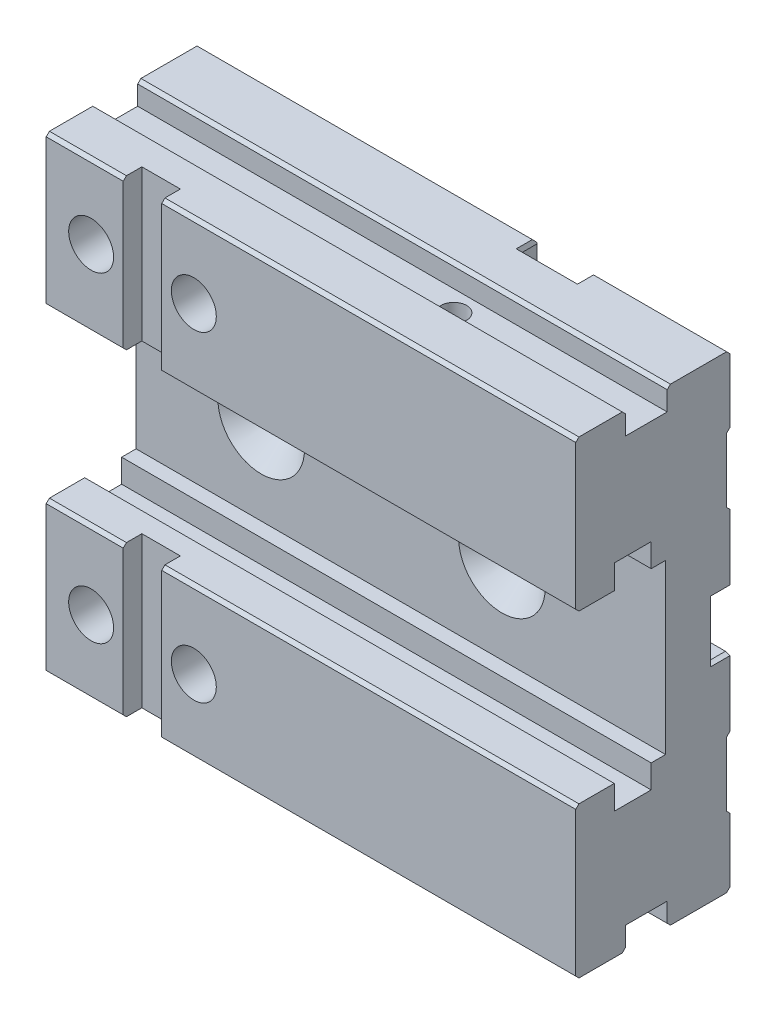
ISO-10303-21;
HEADER;
FILE_DESCRIPTION(('STEP AP214'),'2;1');
FILE_NAME('part.step','',(''),(''),'','','');
FILE_SCHEMA(('AUTOMOTIVE_DESIGN { 1 0 10303 214 1 1 1 1 }'));
ENDSEC;
DATA;
#1=APPLICATION_CONTEXT('core data for automotive mechanical design processes');
#2=APPLICATION_PROTOCOL_DEFINITION('international standard','automotive_design',2000,#1);
#3=PRODUCT_CONTEXT('',#1,'mechanical');
#4=PRODUCT('Part','Part','',(#3));
#5=PRODUCT_RELATED_PRODUCT_CATEGORY('part','',(#4));
#6=PRODUCT_DEFINITION_FORMATION('','',#4);
#7=PRODUCT_DEFINITION_CONTEXT('part definition',#1,'design');
#8=PRODUCT_DEFINITION('design','',#6,#7);
#9=PRODUCT_DEFINITION_SHAPE('','',#8);
#10=(LENGTH_UNIT() NAMED_UNIT(*) SI_UNIT(.MILLI.,.METRE.));
#11=(NAMED_UNIT(*) PLANE_ANGLE_UNIT() SI_UNIT($,.RADIAN.));
#12=(NAMED_UNIT(*) SI_UNIT($,.STERADIAN.) SOLID_ANGLE_UNIT());
#13=UNCERTAINTY_MEASURE_WITH_UNIT(LENGTH_MEASURE(1.E-05),#10,'distance_accuracy_value','');
#14=(GEOMETRIC_REPRESENTATION_CONTEXT(3) GLOBAL_UNCERTAINTY_ASSIGNED_CONTEXT((#13)) GLOBAL_UNIT_ASSIGNED_CONTEXT((#10,
#11,#12)) REPRESENTATION_CONTEXT('',''));
#15=CARTESIAN_POINT('',(0.,0.,0.));
#16=DIRECTION('',(0.,0.,1.));
#17=DIRECTION('',(1.,0.,0.));
#18=AXIS2_PLACEMENT_3D('',#15,#16,#17);
#19=CARTESIAN_POINT('',(3.5,76.,5.5));
#20=DIRECTION('',(1.,0.,0.));
#21=DIRECTION('',(0.,1.,0.));
#22=AXIS2_PLACEMENT_3D('',#19,#20,#21);
#23=PLANE('',#22);
#24=DIRECTION('',(0.,0.,1.));
#25=VECTOR('',#24,1.);
#26=CARTESIAN_POINT('',(3.5,40.3674969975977,5.5));
#27=LINE('',#26,#25);
#28=CARTESIAN_POINT('',(3.5,40.3674969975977,5.5));
#29=VERTEX_POINT('',#28);
#30=CARTESIAN_POINT('',(3.5,40.3674969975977,5.));
#31=VERTEX_POINT('',#30);
#32=EDGE_CURVE('E855',#29,#31,#27,.F.);
#33=ORIENTED_EDGE('',*,*,#32,.F.);
#34=DIRECTION('',(0.,-1.,0.));
#35=VECTOR('',#34,1.);
#36=CARTESIAN_POINT('',(3.5,76.,5.5));
#37=LINE('',#36,#35);
#38=CARTESIAN_POINT('',(3.5,66.6325030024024,5.5));
#39=VERTEX_POINT('',#38);
#40=EDGE_CURVE('E819',#29,#39,#37,.F.);
#41=ORIENTED_EDGE('',*,*,#40,.T.);
#42=DIRECTION('',(0.,0.,1.));
#43=VECTOR('',#42,1.);
#44=CARTESIAN_POINT('',(3.5,66.6325030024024,5.5));
#45=LINE('',#44,#43);
#46=CARTESIAN_POINT('',(3.5,66.6325030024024,5.));
#47=VERTEX_POINT('',#46);
#48=EDGE_CURVE('E857',#47,#39,#45,.T.);
#49=ORIENTED_EDGE('',*,*,#48,.F.);
#50=DIRECTION('',(0.,-1.,0.));
#51=VECTOR('',#50,1.);
#52=CARTESIAN_POINT('',(3.5,76.,5.));
#53=LINE('',#52,#51);
#54=EDGE_CURVE('E825',#47,#31,#53,.T.);
#55=ORIENTED_EDGE('',*,*,#54,.T.);
#56=EDGE_LOOP('',(#33,#41,#49,#55));
#57=FACE_BOUND('',#56,.T.);
#58=ADVANCED_FACE('F14',(#57),#23,.F.);
#59=CARTESIAN_POINT('',(-3.5,76.,5.5));
#60=DIRECTION('',(-1.,0.,0.));
#61=DIRECTION('',(0.,-1.,0.));
#62=AXIS2_PLACEMENT_3D('',#59,#60,#61);
#63=PLANE('',#62);
#64=DIRECTION('',(0.,0.,1.));
#65=VECTOR('',#64,1.);
#66=CARTESIAN_POINT('',(-3.5,40.3674969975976,5.5));
#67=LINE('',#66,#65);
#68=CARTESIAN_POINT('',(-3.5,40.3674969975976,5.));
#69=VERTEX_POINT('',#68);
#70=CARTESIAN_POINT('',(-3.5,40.3674969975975,5.5));
#71=VERTEX_POINT('',#70);
#72=EDGE_CURVE('E850',#69,#71,#67,.T.);
#73=ORIENTED_EDGE('',*,*,#72,.F.);
#74=DIRECTION('',(0.,-1.,0.));
#75=VECTOR('',#74,1.);
#76=CARTESIAN_POINT('',(-3.5,76.,5.));
#77=LINE('',#76,#75);
#78=CARTESIAN_POINT('',(-3.5,66.6325030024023,5.));
#79=VERTEX_POINT('',#78);
#80=EDGE_CURVE('E801',#69,#79,#77,.F.);
#81=ORIENTED_EDGE('',*,*,#80,.T.);
#82=DIRECTION('',(0.,0.,1.));
#83=VECTOR('',#82,1.);
#84=CARTESIAN_POINT('',(-3.5,66.6325030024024,5.5));
#85=LINE('',#84,#83);
#86=CARTESIAN_POINT('',(-3.5,66.6325030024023,5.5));
#87=VERTEX_POINT('',#86);
#88=EDGE_CURVE('E853',#87,#79,#85,.F.);
#89=ORIENTED_EDGE('',*,*,#88,.F.);
#90=DIRECTION('',(0.,-1.,0.));
#91=VECTOR('',#90,1.);
#92=CARTESIAN_POINT('',(-3.5,76.,5.5));
#93=LINE('',#92,#91);
#94=EDGE_CURVE('E822',#87,#71,#93,.T.);
#95=ORIENTED_EDGE('',*,*,#94,.T.);
#96=EDGE_LOOP('',(#73,#81,#89,#95));
#97=FACE_BOUND('',#96,.T.);
#98=ADVANCED_FACE('F1671',(#97),#63,.F.);
#99=CARTESIAN_POINT('',(3.5,-76.,5.5));
#100=DIRECTION('',(1.,0.,0.));
#101=DIRECTION('',(0.,1.,0.));
#102=AXIS2_PLACEMENT_3D('',#99,#100,#101);
#103=PLANE('',#102);
#104=DIRECTION('',(0.,0.,1.));
#105=VECTOR('',#104,1.);
#106=CARTESIAN_POINT('',(3.5,-40.3674969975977,5.5));
#107=LINE('',#106,#105);
#108=CARTESIAN_POINT('',(3.5,-40.3674969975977,5.));
#109=VERTEX_POINT('',#108);
#110=CARTESIAN_POINT('',(3.5,-40.3674969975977,5.5));
#111=VERTEX_POINT('',#110);
#112=EDGE_CURVE('E847',#109,#111,#107,.T.);
#113=ORIENTED_EDGE('',*,*,#112,.F.);
#114=DIRECTION('',(0.,-1.,0.));
#115=VECTOR('',#114,1.);
#116=CARTESIAN_POINT('',(3.5,-76.,5.));
#117=LINE('',#116,#115);
#118=CARTESIAN_POINT('',(3.5,-66.6325030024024,5.));
#119=VERTEX_POINT('',#118);
#120=EDGE_CURVE('E1206',#109,#119,#117,.T.);
#121=ORIENTED_EDGE('',*,*,#120,.T.);
#122=DIRECTION('',(0.,0.,1.));
#123=VECTOR('',#122,1.);
#124=CARTESIAN_POINT('',(3.5,-66.6325030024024,5.5));
#125=LINE('',#124,#123);
#126=CARTESIAN_POINT('',(3.5,-66.6325030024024,5.5));
#127=VERTEX_POINT('',#126);
#128=EDGE_CURVE('E848',#127,#119,#125,.F.);
#129=ORIENTED_EDGE('',*,*,#128,.F.);
#130=DIRECTION('',(0.,-1.,0.));
#131=VECTOR('',#130,1.);
#132=CARTESIAN_POINT('',(3.5,-76.,5.5));
#133=LINE('',#132,#131);
#134=EDGE_CURVE('E1203',#127,#111,#133,.F.);
#135=ORIENTED_EDGE('',*,*,#134,.T.);
#136=EDGE_LOOP('',(#113,#121,#129,#135));
#137=FACE_BOUND('',#136,.T.);
#138=ADVANCED_FACE('F2246',(#137),#103,.F.);
#139=CARTESIAN_POINT('',(-3.5,-76.,5.5));
#140=DIRECTION('',(-1.,0.,0.));
#141=DIRECTION('',(0.,-1.,0.));
#142=AXIS2_PLACEMENT_3D('',#139,#140,#141);
#143=PLANE('',#142);
#144=DIRECTION('',(0.,0.,1.));
#145=VECTOR('',#144,1.);
#146=CARTESIAN_POINT('',(-3.5,-40.3674969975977,5.5));
#147=LINE('',#146,#145);
#148=CARTESIAN_POINT('',(-3.5,-40.3674969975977,5.5));
#149=VERTEX_POINT('',#148);
#150=CARTESIAN_POINT('',(-3.5,-40.3674969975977,5.));
#151=VERTEX_POINT('',#150);
#152=EDGE_CURVE('E841',#149,#151,#147,.F.);
#153=ORIENTED_EDGE('',*,*,#152,.F.);
#154=DIRECTION('',(0.,-1.,0.));
#155=VECTOR('',#154,1.);
#156=CARTESIAN_POINT('',(-3.5,-76.,5.5));
#157=LINE('',#156,#155);
#158=CARTESIAN_POINT('',(-3.5,-66.6325030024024,5.5));
#159=VERTEX_POINT('',#158);
#160=EDGE_CURVE('E736',#149,#159,#157,.T.);
#161=ORIENTED_EDGE('',*,*,#160,.T.);
#162=DIRECTION('',(0.,0.,1.));
#163=VECTOR('',#162,1.);
#164=CARTESIAN_POINT('',(-3.5,-66.6325030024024,5.5));
#165=LINE('',#164,#163);
#166=CARTESIAN_POINT('',(-3.5,-66.6325030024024,5.));
#167=VERTEX_POINT('',#166);
#168=EDGE_CURVE('E844',#167,#159,#165,.T.);
#169=ORIENTED_EDGE('',*,*,#168,.F.);
#170=DIRECTION('',(0.,-1.,0.));
#171=VECTOR('',#170,1.);
#172=CARTESIAN_POINT('',(-3.5,-76.,5.));
#173=LINE('',#172,#171);
#174=EDGE_CURVE('E796',#167,#151,#173,.F.);
#175=ORIENTED_EDGE('',*,*,#174,.T.);
#176=EDGE_LOOP('',(#153,#161,#169,#175));
#177=FACE_BOUND('',#176,.T.);
#178=ADVANCED_FACE('F1216',(#177),#143,.F.);
#179=CARTESIAN_POINT('',(51.,3.5,5.5));
#180=DIRECTION('',(0.,1.,0.));
#181=DIRECTION('',(-1.,0.,0.));
#182=AXIS2_PLACEMENT_3D('',#179,#180,#181);
#183=PLANE('',#182);
#184=DIRECTION('',(0.,0.,1.));
#185=VECTOR('',#184,1.);
#186=CARTESIAN_POINT('',(19.3674969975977,3.5,5.5));
#187=LINE('',#186,#185);
#188=CARTESIAN_POINT('',(19.3674969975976,3.5,5.));
#189=VERTEX_POINT('',#188);
#190=CARTESIAN_POINT('',(19.3674969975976,3.5,5.5));
#191=VERTEX_POINT('',#190);
#192=EDGE_CURVE('E837',#189,#191,#187,.T.);
#193=ORIENTED_EDGE('',*,*,#192,.F.);
#194=DIRECTION('',(1.,0.,0.));
#195=VECTOR('',#194,1.);
#196=CARTESIAN_POINT('',(51.,3.5,5.));
#197=LINE('',#196,#195);
#198=CARTESIAN_POINT('',(44.6325030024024,3.5,5.));
#199=VERTEX_POINT('',#198);
#200=EDGE_CURVE('E1194',#189,#199,#197,.T.);
#201=ORIENTED_EDGE('',*,*,#200,.T.);
#202=DIRECTION('',(0.,0.,1.));
#203=VECTOR('',#202,1.);
#204=CARTESIAN_POINT('',(44.6325030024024,3.5,5.5));
#205=LINE('',#204,#203);
#206=CARTESIAN_POINT('',(44.6325030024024,3.5,5.5));
#207=VERTEX_POINT('',#206);
#208=EDGE_CURVE('E839',#207,#199,#205,.F.);
#209=ORIENTED_EDGE('',*,*,#208,.F.);
#210=DIRECTION('',(1.,0.,0.));
#211=VECTOR('',#210,1.);
#212=CARTESIAN_POINT('',(51.,3.5,5.5));
#213=LINE('',#212,#211);
#214=EDGE_CURVE('E1191',#207,#191,#213,.F.);
#215=ORIENTED_EDGE('',*,*,#214,.T.);
#216=EDGE_LOOP('',(#193,#201,#209,#215));
#217=FACE_BOUND('',#216,.T.);
#218=ADVANCED_FACE('F1790',(#217),#183,.F.);
#219=CARTESIAN_POINT('',(51.,-3.5,5.5));
#220=DIRECTION('',(0.,-1.,0.));
#221=DIRECTION('',(1.,0.,0.));
#222=AXIS2_PLACEMENT_3D('',#219,#220,#221);
#223=PLANE('',#222);
#224=DIRECTION('',(0.,0.,1.));
#225=VECTOR('',#224,1.);
#226=CARTESIAN_POINT('',(19.3674969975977,-3.5,5.5));
#227=LINE('',#226,#225);
#228=CARTESIAN_POINT('',(19.3674969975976,-3.5,5.5));
#229=VERTEX_POINT('',#228);
#230=CARTESIAN_POINT('',(19.3674969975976,-3.5,5.));
#231=VERTEX_POINT('',#230);
#232=EDGE_CURVE('E832',#229,#231,#227,.F.);
#233=ORIENTED_EDGE('',*,*,#232,.F.);
#234=DIRECTION('',(1.,0.,0.));
#235=VECTOR('',#234,1.);
#236=CARTESIAN_POINT('',(51.,-3.5,5.5));
#237=LINE('',#236,#235);
#238=CARTESIAN_POINT('',(44.6325030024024,-3.5,5.5));
#239=VERTEX_POINT('',#238);
#240=EDGE_CURVE('E778',#229,#239,#237,.T.);
#241=ORIENTED_EDGE('',*,*,#240,.T.);
#242=DIRECTION('',(0.,0.,1.));
#243=VECTOR('',#242,1.);
#244=CARTESIAN_POINT('',(44.6325030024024,-3.5,5.5));
#245=LINE('',#244,#243);
#246=CARTESIAN_POINT('',(44.6325030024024,-3.5,5.));
#247=VERTEX_POINT('',#246);
#248=EDGE_CURVE('E835',#247,#239,#245,.T.);
#249=ORIENTED_EDGE('',*,*,#248,.F.);
#250=DIRECTION('',(1.,0.,0.));
#251=VECTOR('',#250,1.);
#252=CARTESIAN_POINT('',(51.,-3.5,5.));
#253=LINE('',#252,#251);
#254=EDGE_CURVE('E773',#247,#231,#253,.F.);
#255=ORIENTED_EDGE('',*,*,#254,.T.);
#256=EDGE_LOOP('',(#233,#241,#249,#255));
#257=FACE_BOUND('',#256,.T.);
#258=ADVANCED_FACE('F1798',(#257),#223,.F.);
#259=CARTESIAN_POINT('',(-9.,76.,5.));
#260=DIRECTION('',(0.,0.,1.));
#261=DIRECTION('',(0.,-1.,0.));
#262=AXIS2_PLACEMENT_3D('',#259,#260,#261);
#263=PLANE('',#262);
#264=ORIENTED_EDGE('',*,*,#54,.F.);
#265=CARTESIAN_POINT('',(0.,76.,5.));
#266=DIRECTION('',(0.,0.,-1.));
#267=DIRECTION('',(0.,1.,0.));
#268=AXIS2_PLACEMENT_3D('',#265,#266,#267);
#269=CIRCLE('',#268,10.);
#270=CARTESIAN_POINT('',(8.99999999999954,71.6411010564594,5.));
#271=VERTEX_POINT('',#270);
#272=EDGE_CURVE('E1048',#47,#271,#269,.F.);
#273=ORIENTED_EDGE('',*,*,#272,.T.);
#274=DIRECTION('',(0.,1.,0.));
#275=VECTOR('',#274,1.);
#276=CARTESIAN_POINT('',(8.99999999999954,76.,5.));
#277=LINE('',#276,#275);
#278=CARTESIAN_POINT('',(9.,35.3588989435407,5.));
#279=VERTEX_POINT('',#278);
#280=EDGE_CURVE('E826',#271,#279,#277,.F.);
#281=ORIENTED_EDGE('',*,*,#280,.T.);
#282=CARTESIAN_POINT('',(0.,31.,5.));
#283=DIRECTION('',(0.,0.,-1.));
#284=DIRECTION('',(0.,1.,0.));
#285=AXIS2_PLACEMENT_3D('',#282,#283,#284);
#286=CIRCLE('',#285,10.);
#287=EDGE_CURVE('E756',#279,#31,#286,.F.);
#288=ORIENTED_EDGE('',*,*,#287,.T.);
#289=EDGE_LOOP('',(#264,#273,#281,#288));
#290=FACE_BOUND('',#289,.T.);
#291=ADVANCED_FACE('F1661',(#290),#263,.F.);
#292=CARTESIAN_POINT('',(-3.5,76.,5.5));
#293=DIRECTION('',(0.,0.,1.));
#294=DIRECTION('',(0.,-1.,0.));
#295=AXIS2_PLACEMENT_3D('',#292,#293,#294);
#296=PLANE('',#295);
#297=CARTESIAN_POINT('',(0.,54.,5.5));
#298=DIRECTION('',(0.,0.,-1.));
#299=DIRECTION('',(-1.,0.,0.));
#300=AXIS2_PLACEMENT_3D('',#297,#298,#299);
#301=CIRCLE('',#300,2.5);
#302=CARTESIAN_POINT('',(-2.5,54.,5.5));
#303=VERTEX_POINT('',#302);
#304=EDGE_CURVE('E2515',#303,#303,#301,.T.);
#305=ORIENTED_EDGE('',*,*,#304,.F.);
#306=EDGE_LOOP('',(#305));
#307=FACE_BOUND('',#306,.T.);
#308=ORIENTED_EDGE('',*,*,#40,.F.);
#309=CARTESIAN_POINT('',(0.,31.,5.5));
#310=DIRECTION('',(0.,0.,-1.));
#311=DIRECTION('',(0.,1.,0.));
#312=AXIS2_PLACEMENT_3D('',#309,#310,#311);
#313=CIRCLE('',#312,10.);
#314=EDGE_CURVE('E1035',#29,#71,#313,.F.);
#315=ORIENTED_EDGE('',*,*,#314,.T.);
#316=ORIENTED_EDGE('',*,*,#94,.F.);
#317=CARTESIAN_POINT('',(0.,76.,5.5));
#318=DIRECTION('',(0.,0.,-1.));
#319=DIRECTION('',(0.,1.,0.));
#320=AXIS2_PLACEMENT_3D('',#317,#318,#319);
#321=CIRCLE('',#320,10.);
#322=EDGE_CURVE('E1050',#87,#39,#321,.F.);
#323=ORIENTED_EDGE('',*,*,#322,.T.);
#324=EDGE_LOOP('',(#308,#315,#316,#323));
#325=FACE_BOUND('',#324,.T.);
#326=ADVANCED_FACE('F1669',(#307,#325),#296,.F.);
#327=CARTESIAN_POINT('',(-9.,76.,5.));
#328=DIRECTION('',(0.,0.,1.));
#329=DIRECTION('',(0.,-1.,0.));
#330=AXIS2_PLACEMENT_3D('',#327,#328,#329);
#331=PLANE('',#330);
#332=ORIENTED_EDGE('',*,*,#80,.F.);
#333=CARTESIAN_POINT('',(0.,31.,5.));
#334=DIRECTION('',(0.,0.,-1.));
#335=DIRECTION('',(0.,1.,0.));
#336=AXIS2_PLACEMENT_3D('',#333,#334,#335);
#337=CIRCLE('',#336,10.);
#338=CARTESIAN_POINT('',(-9.,35.3588989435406,5.));
#339=VERTEX_POINT('',#338);
#340=EDGE_CURVE('E1033',#69,#339,#337,.F.);
#341=ORIENTED_EDGE('',*,*,#340,.T.);
#342=DIRECTION('',(0.,-1.,0.));
#343=VECTOR('',#342,1.);
#344=CARTESIAN_POINT('',(-9.,76.,5.));
#345=LINE('',#344,#343);
#346=CARTESIAN_POINT('',(-9.,71.6411010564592,5.));
#347=VERTEX_POINT('',#346);
#348=EDGE_CURVE('E813',#339,#347,#345,.F.);
#349=ORIENTED_EDGE('',*,*,#348,.T.);
#350=CARTESIAN_POINT('',(0.,76.,5.));
#351=DIRECTION('',(0.,0.,-1.));
#352=DIRECTION('',(0.,1.,0.));
#353=AXIS2_PLACEMENT_3D('',#350,#351,#352);
#354=CIRCLE('',#353,10.);
#355=EDGE_CURVE('E1052',#347,#79,#354,.F.);
#356=ORIENTED_EDGE('',*,*,#355,.T.);
#357=EDGE_LOOP('',(#332,#341,#349,#356));
#358=FACE_BOUND('',#357,.T.);
#359=ADVANCED_FACE('F1673',(#358),#331,.F.);
#360=CARTESIAN_POINT('',(-75.,-3.5,5.5));
#361=DIRECTION('',(0.,-1.,0.));
#362=DIRECTION('',(1.,0.,0.));
#363=AXIS2_PLACEMENT_3D('',#360,#361,#362);
#364=PLANE('',#363);
#365=DIRECTION('',(0.,0.,1.));
#366=VECTOR('',#365,1.);
#367=CARTESIAN_POINT('',(-107.632503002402,-3.5,5.5));
#368=LINE('',#367,#366);
#369=CARTESIAN_POINT('',(-107.632503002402,-3.5,5.5));
#370=VERTEX_POINT('',#369);
#371=CARTESIAN_POINT('',(-107.632503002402,-3.5,5.));
#372=VERTEX_POINT('',#371);
#373=EDGE_CURVE('E797',#370,#372,#368,.F.);
#374=ORIENTED_EDGE('',*,*,#373,.F.);
#375=DIRECTION('',(1.,0.,0.));
#376=VECTOR('',#375,1.);
#377=CARTESIAN_POINT('',(-75.,-3.5,5.5));
#378=LINE('',#377,#376);
#379=CARTESIAN_POINT('',(-82.3674969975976,-3.5,5.5));
#380=VERTEX_POINT('',#379);
#381=EDGE_CURVE('E1258',#370,#380,#378,.T.);
#382=ORIENTED_EDGE('',*,*,#381,.T.);
#383=DIRECTION('',(0.,0.,1.));
#384=VECTOR('',#383,1.);
#385=CARTESIAN_POINT('',(-82.3674969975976,-3.5,5.5));
#386=LINE('',#385,#384);
#387=CARTESIAN_POINT('',(-82.3674969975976,-3.5,5.));
#388=VERTEX_POINT('',#387);
#389=EDGE_CURVE('E799',#388,#380,#386,.T.);
#390=ORIENTED_EDGE('',*,*,#389,.F.);
#391=DIRECTION('',(1.,0.,0.));
#392=VECTOR('',#391,1.);
#393=CARTESIAN_POINT('',(-76.,-3.5,5.));
#394=LINE('',#393,#392);
#395=EDGE_CURVE('E1266',#388,#372,#394,.F.);
#396=ORIENTED_EDGE('',*,*,#395,.T.);
#397=EDGE_LOOP('',(#374,#382,#390,#396));
#398=FACE_BOUND('',#397,.T.);
#399=ADVANCED_FACE('F2115',(#398),#364,.F.);
#400=CARTESIAN_POINT('',(-75.,3.5,5.5));
#401=DIRECTION('',(0.,1.,0.));
#402=DIRECTION('',(-1.,0.,0.));
#403=AXIS2_PLACEMENT_3D('',#400,#401,#402);
#404=PLANE('',#403);
#405=DIRECTION('',(0.,0.,1.));
#406=VECTOR('',#405,1.);
#407=CARTESIAN_POINT('',(-107.632503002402,3.5,5.5));
#408=LINE('',#407,#406);
#409=CARTESIAN_POINT('',(-107.632503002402,3.5,5.));
#410=VERTEX_POINT('',#409);
#411=CARTESIAN_POINT('',(-107.632503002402,3.5,5.5));
#412=VERTEX_POINT('',#411);
#413=EDGE_CURVE('E794',#410,#412,#408,.T.);
#414=ORIENTED_EDGE('',*,*,#413,.F.);
#415=DIRECTION('',(1.,0.,0.));
#416=VECTOR('',#415,1.);
#417=CARTESIAN_POINT('',(-76.,3.5,5.));
#418=LINE('',#417,#416);
#419=CARTESIAN_POINT('',(-82.3674969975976,3.5,5.));
#420=VERTEX_POINT('',#419);
#421=EDGE_CURVE('E1026',#410,#420,#418,.T.);
#422=ORIENTED_EDGE('',*,*,#421,.T.);
#423=DIRECTION('',(0.,0.,-1.));
#424=VECTOR('',#423,1.);
#425=CARTESIAN_POINT('',(-82.3674969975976,3.5,6.00000000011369));
#426=LINE('',#425,#424);
#427=CARTESIAN_POINT('',(-82.3674969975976,3.5,5.5));
#428=VERTEX_POINT('',#427);
#429=EDGE_CURVE('E789',#420,#428,#426,.F.);
#430=ORIENTED_EDGE('',*,*,#429,.T.);
#431=DIRECTION('',(1.,0.,0.));
#432=VECTOR('',#431,1.);
#433=CARTESIAN_POINT('',(-75.,3.5,5.5));
#434=LINE('',#433,#432);
#435=EDGE_CURVE('E1263',#428,#412,#434,.F.);
#436=ORIENTED_EDGE('',*,*,#435,.T.);
#437=EDGE_LOOP('',(#414,#422,#430,#436));
#438=FACE_BOUND('',#437,.T.);
#439=ADVANCED_FACE('F2120',(#438),#404,.F.);
#440=CARTESIAN_POINT('',(9.,-76.,5.));
#441=DIRECTION('',(0.,0.,1.));
#442=DIRECTION('',(0.,-1.,0.));
#443=AXIS2_PLACEMENT_3D('',#440,#441,#442);
#444=PLANE('',#443);
#445=ORIENTED_EDGE('',*,*,#174,.F.);
#446=CARTESIAN_POINT('',(0.,-76.,5.));
#447=DIRECTION('',(0.,0.,-1.));
#448=DIRECTION('',(0.,1.,0.));
#449=AXIS2_PLACEMENT_3D('',#446,#447,#448);
#450=CIRCLE('',#449,10.);
#451=CARTESIAN_POINT('',(-9.,-71.6411010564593,5.));
#452=VERTEX_POINT('',#451);
#453=EDGE_CURVE('E993',#167,#452,#450,.F.);
#454=ORIENTED_EDGE('',*,*,#453,.T.);
#455=DIRECTION('',(0.,-1.,0.));
#456=VECTOR('',#455,1.);
#457=CARTESIAN_POINT('',(-9.,-76.,5.));
#458=LINE('',#457,#456);
#459=CARTESIAN_POINT('',(-9.,-35.3588989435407,5.));
#460=VERTEX_POINT('',#459);
#461=EDGE_CURVE('E1210',#452,#460,#458,.F.);
#462=ORIENTED_EDGE('',*,*,#461,.T.);
#463=CARTESIAN_POINT('',(0.,-31.,5.));
#464=DIRECTION('',(0.,0.,-1.));
#465=DIRECTION('',(0.,1.,0.));
#466=AXIS2_PLACEMENT_3D('',#463,#464,#465);
#467=CIRCLE('',#466,10.);
#468=EDGE_CURVE('E1006',#460,#151,#467,.F.);
#469=ORIENTED_EDGE('',*,*,#468,.T.);
#470=EDGE_LOOP('',(#445,#454,#462,#469));
#471=FACE_BOUND('',#470,.T.);
#472=ADVANCED_FACE('F1221',(#471),#444,.F.);
#473=CARTESIAN_POINT('',(9.,-76.,5.));
#474=DIRECTION('',(0.,0.,1.));
#475=DIRECTION('',(0.,-1.,0.));
#476=AXIS2_PLACEMENT_3D('',#473,#474,#475);
#477=PLANE('',#476);
#478=ORIENTED_EDGE('',*,*,#120,.F.);
#479=CARTESIAN_POINT('',(0.,-31.,5.));
#480=DIRECTION('',(0.,0.,-1.));
#481=DIRECTION('',(0.,1.,0.));
#482=AXIS2_PLACEMENT_3D('',#479,#480,#481);
#483=CIRCLE('',#482,10.);
#484=CARTESIAN_POINT('',(9.,-35.3588989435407,5.));
#485=VERTEX_POINT('',#484);
#486=EDGE_CURVE('E1000',#109,#485,#483,.F.);
#487=ORIENTED_EDGE('',*,*,#486,.T.);
#488=DIRECTION('',(0.,1.,0.));
#489=VECTOR('',#488,1.);
#490=CARTESIAN_POINT('',(9.,-76.,5.));
#491=LINE('',#490,#489);
#492=CARTESIAN_POINT('',(9.,-71.6411010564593,5.));
#493=VERTEX_POINT('',#492);
#494=EDGE_CURVE('E1156',#485,#493,#491,.F.);
#495=ORIENTED_EDGE('',*,*,#494,.T.);
#496=CARTESIAN_POINT('',(0.,-76.,5.));
#497=DIRECTION('',(0.,0.,-1.));
#498=DIRECTION('',(0.,1.,0.));
#499=AXIS2_PLACEMENT_3D('',#496,#497,#498);
#500=CIRCLE('',#499,10.);
#501=EDGE_CURVE('E986',#493,#119,#500,.F.);
#502=ORIENTED_EDGE('',*,*,#501,.T.);
#503=EDGE_LOOP('',(#478,#487,#495,#502));
#504=FACE_BOUND('',#503,.T.);
#505=ADVANCED_FACE('F2222',(#504),#477,.F.);
#506=CARTESIAN_POINT('',(3.5,-76.,5.5));
#507=DIRECTION('',(0.,0.,1.));
#508=DIRECTION('',(0.,-1.,0.));
#509=AXIS2_PLACEMENT_3D('',#506,#507,#508);
#510=PLANE('',#509);
#511=CARTESIAN_POINT('',(0.,-54.,5.5));
#512=DIRECTION('',(0.,0.,-1.));
#513=DIRECTION('',(-1.,0.,0.));
#514=AXIS2_PLACEMENT_3D('',#511,#512,#513);
#515=CIRCLE('',#514,2.5);
#516=CARTESIAN_POINT('',(-2.5,-54.,5.5));
#517=VERTEX_POINT('',#516);
#518=EDGE_CURVE('E2509',#517,#517,#515,.T.);
#519=ORIENTED_EDGE('',*,*,#518,.F.);
#520=EDGE_LOOP('',(#519));
#521=FACE_BOUND('',#520,.T.);
#522=CARTESIAN_POINT('',(0.,-31.,5.5));
#523=DIRECTION('',(0.,0.,-1.));
#524=DIRECTION('',(0.,1.,0.));
#525=AXIS2_PLACEMENT_3D('',#522,#523,#524);
#526=CIRCLE('',#525,10.);
#527=EDGE_CURVE('E1003',#149,#111,#526,.F.);
#528=ORIENTED_EDGE('',*,*,#527,.T.);
#529=ORIENTED_EDGE('',*,*,#134,.F.);
#530=CARTESIAN_POINT('',(0.,-76.,5.5));
#531=DIRECTION('',(0.,0.,-1.));
#532=DIRECTION('',(0.,1.,0.));
#533=AXIS2_PLACEMENT_3D('',#530,#531,#532);
#534=CIRCLE('',#533,10.);
#535=EDGE_CURVE('E984',#127,#159,#534,.F.);
#536=ORIENTED_EDGE('',*,*,#535,.T.);
#537=ORIENTED_EDGE('',*,*,#160,.F.);
#538=EDGE_LOOP('',(#528,#529,#536,#537));
#539=FACE_BOUND('',#538,.T.);
#540=ADVANCED_FACE('F2218',(#521,#539),#510,.F.);
#541=CARTESIAN_POINT('',(10.,0.,6.00000000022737));
#542=DIRECTION('',(0.,0.,-1.));
#543=DIRECTION('',(-1.,0.,0.));
#544=AXIS2_PLACEMENT_3D('',#541,#542,#543);
#545=PLANE('',#544);
#546=CARTESIAN_POINT('',(-75.,0.,6.00000000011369));
#547=DIRECTION('',(0.,0.,1.));
#548=DIRECTION('',(1.,0.,0.));
#549=AXIS2_PLACEMENT_3D('',#546,#547,#548);
#550=CIRCLE('',#549,6.25);
#551=CARTESIAN_POINT('',(-68.75,0.,6.00000000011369));
#552=VERTEX_POINT('',#551);
#553=EDGE_CURVE('E974',#552,#552,#550,.T.);
#554=ORIENTED_EDGE('',*,*,#553,.T.);
#555=EDGE_LOOP('',(#554));
#556=FACE_BOUND('',#555,.T.);
#557=CARTESIAN_POINT('',(0.,31.,6.));
#558=DIRECTION('',(0.,0.,-1.));
#559=DIRECTION('',(0.,1.,0.));
#560=AXIS2_PLACEMENT_3D('',#557,#558,#559);
#561=CIRCLE('',#560,10.);
#562=CARTESIAN_POINT('',(-10.,31.,6.));
#563=VERTEX_POINT('',#562);
#564=CARTESIAN_POINT('',(10.,31.,6.00000000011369));
#565=VERTEX_POINT('',#564);
#566=EDGE_CURVE('E1029',#563,#565,#561,.T.);
#567=ORIENTED_EDGE('',*,*,#566,.T.);
#568=DIRECTION('',(0.,-1.,0.));
#569=VECTOR('',#568,1.);
#570=CARTESIAN_POINT('',(10.,0.,6.));
#571=LINE('',#570,#569);
#572=CARTESIAN_POINT('',(10.,12.6491106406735,6.00000000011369));
#573=VERTEX_POINT('',#572);
#574=EDGE_CURVE('E732',#573,#565,#571,.F.);
#575=ORIENTED_EDGE('',*,*,#574,.F.);
#576=CARTESIAN_POINT('',(13.,12.6491106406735,6.00000000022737));
#577=DIRECTION('',(0.,0.,-1.));
#578=DIRECTION('',(-1.,0.,0.));
#579=AXIS2_PLACEMENT_3D('',#576,#577,#578);
#580=CIRCLE('',#579,3.);
#581=CARTESIAN_POINT('',(12.3076923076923,9.73008510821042,6.00000000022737));
#582=VERTEX_POINT('',#581);
#583=EDGE_CURVE('E17',#582,#573,#580,.T.);
#584=ORIENTED_EDGE('',*,*,#583,.F.);
#585=CARTESIAN_POINT('',(10.,0.,6.00000000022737));
#586=DIRECTION('',(0.,0.,-1.));
#587=DIRECTION('',(-1.,0.,0.));
#588=AXIS2_PLACEMENT_3D('',#585,#586,#587);
#589=CIRCLE('',#588,10.);
#590=CARTESIAN_POINT('',(12.3076923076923,-9.73008510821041,6.00000000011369));
#591=VERTEX_POINT('',#590);
#592=EDGE_CURVE('E729',#582,#591,#589,.T.);
#593=ORIENTED_EDGE('',*,*,#592,.T.);
#594=CARTESIAN_POINT('',(13.,-12.6491106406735,6.));
#595=DIRECTION('',(0.,0.,-1.));
#596=DIRECTION('',(-1.,0.,0.));
#597=AXIS2_PLACEMENT_3D('',#594,#595,#596);
#598=CIRCLE('',#597,3.);
#599=CARTESIAN_POINT('',(10.,-12.6491106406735,6.));
#600=VERTEX_POINT('',#599);
#601=EDGE_CURVE('E766',#600,#591,#598,.T.);
#602=ORIENTED_EDGE('',*,*,#601,.F.);
#603=DIRECTION('',(0.,-1.,0.));
#604=VECTOR('',#603,1.);
#605=CARTESIAN_POINT('',(10.,0.,6.));
#606=LINE('',#605,#604);
#607=CARTESIAN_POINT('',(10.,-31.,6.));
#608=VERTEX_POINT('',#607);
#609=EDGE_CURVE('E768',#608,#600,#606,.F.);
#610=ORIENTED_EDGE('',*,*,#609,.F.);
#611=CARTESIAN_POINT('',(0.,-31.,6.));
#612=DIRECTION('',(0.,0.,-1.));
#613=DIRECTION('',(0.,1.,0.));
#614=AXIS2_PLACEMENT_3D('',#611,#612,#613);
#615=CIRCLE('',#614,10.);
#616=CARTESIAN_POINT('',(-10.,-31.,6.));
#617=VERTEX_POINT('',#616);
#618=EDGE_CURVE('E996',#608,#617,#615,.T.);
#619=ORIENTED_EDGE('',*,*,#618,.T.);
#620=DIRECTION('',(0.,-1.,0.));
#621=VECTOR('',#620,1.);
#622=CARTESIAN_POINT('',(-10.,0.,6.));
#623=LINE('',#622,#621);
#624=CARTESIAN_POINT('',(-10.,-13.,6.));
#625=VERTEX_POINT('',#624);
#626=EDGE_CURVE('E782',#617,#625,#623,.F.);
#627=ORIENTED_EDGE('',*,*,#626,.T.);
#628=CARTESIAN_POINT('',(-13.,-13.,6.));
#629=DIRECTION('',(0.,0.,1.));
#630=DIRECTION('',(1.,0.,0.));
#631=AXIS2_PLACEMENT_3D('',#628,#629,#630);
#632=CIRCLE('',#631,3.);
#633=CARTESIAN_POINT('',(-13.,-10.,6.));
#634=VERTEX_POINT('',#633);
#635=EDGE_CURVE('E787',#634,#625,#632,.F.);
#636=ORIENTED_EDGE('',*,*,#635,.F.);
#637=DIRECTION('',(-1.,0.,0.));
#638=VECTOR('',#637,1.);
#639=CARTESIAN_POINT('',(51.,-10.,6.));
#640=LINE('',#639,#638);
#641=CARTESIAN_POINT('',(-73.,-10.,6.));
#642=VERTEX_POINT('',#641);
#643=EDGE_CURVE('E784',#642,#634,#640,.F.);
#644=ORIENTED_EDGE('',*,*,#643,.F.);
#645=CARTESIAN_POINT('',(-73.,0.,6.));
#646=DIRECTION('',(0.,0.,-1.));
#647=DIRECTION('',(-1.,0.,0.));
#648=AXIS2_PLACEMENT_3D('',#645,#646,#647);
#649=CIRCLE('',#648,10.);
#650=CARTESIAN_POINT('',(-73.,10.,6.00000000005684));
#651=VERTEX_POINT('',#650);
#652=EDGE_CURVE('E1010',#642,#651,#649,.T.);
#653=ORIENTED_EDGE('',*,*,#652,.T.);
#654=DIRECTION('',(-1.,0.,0.));
#655=VECTOR('',#654,1.);
#656=CARTESIAN_POINT('',(51.,10.,6.));
#657=LINE('',#656,#655);
#658=CARTESIAN_POINT('',(-13.,10.,6.));
#659=VERTEX_POINT('',#658);
#660=EDGE_CURVE('E806',#651,#659,#657,.F.);
#661=ORIENTED_EDGE('',*,*,#660,.T.);
#662=CARTESIAN_POINT('',(-13.,13.,6.));
#663=DIRECTION('',(0.,0.,-1.));
#664=DIRECTION('',(-1.,0.,0.));
#665=AXIS2_PLACEMENT_3D('',#662,#663,#664);
#666=CIRCLE('',#665,3.);
#667=CARTESIAN_POINT('',(-10.,13.,6.));
#668=VERTEX_POINT('',#667);
#669=EDGE_CURVE('E812',#668,#659,#666,.T.);
#670=ORIENTED_EDGE('',*,*,#669,.F.);
#671=DIRECTION('',(0.,-1.,0.));
#672=VECTOR('',#671,1.);
#673=CARTESIAN_POINT('',(-10.,0.,6.));
#674=LINE('',#673,#672);
#675=EDGE_CURVE('E804',#668,#563,#674,.F.);
#676=ORIENTED_EDGE('',*,*,#675,.T.);
#677=EDGE_LOOP('',(#567,#575,#584,#593,#602,#610,#619,#627,#636,#644,#653,#661,#670,#676));
#678=FACE_BOUND('',#677,.T.);
#679=CARTESIAN_POINT('',(0.,0.,6.00000000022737));
#680=DIRECTION('',(0.,0.,1.));
#681=DIRECTION('',(1.,0.,0.));
#682=AXIS2_PLACEMENT_3D('',#679,#680,#681);
#683=CIRCLE('',#682,6.25);
#684=CARTESIAN_POINT('',(6.25,0.,6.00000000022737));
#685=VERTEX_POINT('',#684);
#686=EDGE_CURVE('E971',#685,#685,#683,.T.);
#687=ORIENTED_EDGE('',*,*,#686,.T.);
#688=EDGE_LOOP('',(#687));
#689=FACE_BOUND('',#688,.T.);
#690=ADVANCED_FACE('F726',(#556,#678,#689),#545,.T.);
#691=CARTESIAN_POINT('',(13.,12.6491106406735,6.00000000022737));
#692=DIRECTION('',(0.,0.,-1.));
#693=DIRECTION('',(-1.,0.,0.));
#694=AXIS2_PLACEMENT_3D('',#691,#692,#693);
#695=CYLINDRICAL_SURFACE('',#694,3.);
#696=CARTESIAN_POINT('',(13.,12.6491106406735,0.));
#697=DIRECTION('',(0.,0.,-1.));
#698=DIRECTION('',(-1.,0.,0.));
#699=AXIS2_PLACEMENT_3D('',#696,#697,#698);
#700=CIRCLE('',#699,3.);
#701=CARTESIAN_POINT('',(12.3076923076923,9.73008510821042,0.));
#702=VERTEX_POINT('',#701);
#703=CARTESIAN_POINT('',(10.,12.6491106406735,0.));
#704=VERTEX_POINT('',#703);
#705=EDGE_CURVE('E741',#702,#704,#700,.T.);
#706=ORIENTED_EDGE('',*,*,#705,.F.);
#707=DIRECTION('',(0.,0.,-1.));
#708=VECTOR('',#707,1.);
#709=CARTESIAN_POINT('',(12.3076923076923,9.73008510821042,6.00000000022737));
#710=LINE('',#709,#708);
#711=EDGE_CURVE('E738',#702,#582,#710,.F.);
#712=ORIENTED_EDGE('',*,*,#711,.T.);
#713=ORIENTED_EDGE('',*,*,#583,.T.);
#714=DIRECTION('',(0.,0.,1.));
#715=VECTOR('',#714,1.);
#716=CARTESIAN_POINT('',(10.,12.6491106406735,6.));
#717=LINE('',#716,#715);
#718=EDGE_CURVE('E735',#704,#573,#717,.T.);
#719=ORIENTED_EDGE('',*,*,#718,.F.);
#720=EDGE_LOOP('',(#706,#712,#713,#719));
#721=FACE_BOUND('',#720,.T.);
#722=ADVANCED_FACE('F739',(#721),#695,.T.);
#723=CARTESIAN_POINT('',(10.,0.,6.));
#724=DIRECTION('',(-1.,0.,0.));
#725=DIRECTION('',(0.,-1.,0.));
#726=AXIS2_PLACEMENT_3D('',#723,#724,#725);
#727=PLANE('',#726);
#728=DIRECTION('',(0.,0.,-1.));
#729=VECTOR('',#728,1.);
#730=CARTESIAN_POINT('',(10.,31.,6.00000000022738));
#731=LINE('',#730,#729);
#732=CARTESIAN_POINT('',(10.,31.,1.));
#733=VERTEX_POINT('',#732);
#734=EDGE_CURVE('E1102',#565,#733,#731,.T.);
#735=ORIENTED_EDGE('',*,*,#734,.T.);
#736=DIRECTION('',(0.,-0.707106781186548,-0.707106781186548));
#737=VECTOR('',#736,1.);
#738=CARTESIAN_POINT('',(10.,30.,0.));
#739=LINE('',#738,#737);
#740=CARTESIAN_POINT('',(10.,30.,0.));
#741=VERTEX_POINT('',#740);
#742=EDGE_CURVE('E1105',#733,#741,#739,.T.);
#743=ORIENTED_EDGE('',*,*,#742,.T.);
#744=DIRECTION('',(0.,1.,0.));
#745=VECTOR('',#744,1.);
#746=CARTESIAN_POINT('',(10.,31.,0.));
#747=LINE('',#746,#745);
#748=EDGE_CURVE('E968',#704,#741,#747,.T.);
#749=ORIENTED_EDGE('',*,*,#748,.F.);
#750=ORIENTED_EDGE('',*,*,#718,.T.);
#751=ORIENTED_EDGE('',*,*,#574,.T.);
#752=EDGE_LOOP('',(#735,#743,#749,#750,#751));
#753=FACE_BOUND('',#752,.T.);
#754=ADVANCED_FACE('F1772',(#753),#727,.T.);
#755=CARTESIAN_POINT('',(51.,9.,5.));
#756=DIRECTION('',(0.,1.,0.));
#757=DIRECTION('',(-1.,0.,0.));
#758=AXIS2_PLACEMENT_3D('',#755,#756,#757);
#759=PLANE('',#758);
#760=DIRECTION('',(0.,0.,-1.));
#761=VECTOR('',#760,1.);
#762=CARTESIAN_POINT('',(14.3588989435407,9.,6.00000000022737));
#763=LINE('',#762,#761);
#764=CARTESIAN_POINT('',(14.3588989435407,9.,5.));
#765=VERTEX_POINT('',#764);
#766=CARTESIAN_POINT('',(14.3588989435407,9.,0.));
#767=VERTEX_POINT('',#766);
#768=EDGE_CURVE('E745',#765,#767,#763,.T.);
#769=ORIENTED_EDGE('',*,*,#768,.T.);
#770=DIRECTION('',(-1.,0.,0.));
#771=VECTOR('',#770,1.);
#772=CARTESIAN_POINT('',(-114.,9.,0.));
#773=LINE('',#772,#771);
#774=CARTESIAN_POINT('',(49.6411010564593,9.,1.13685021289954E-10));
#775=VERTEX_POINT('',#774);
#776=EDGE_CURVE('E966',#775,#767,#773,.T.);
#777=ORIENTED_EDGE('',*,*,#776,.F.);
#778=DIRECTION('',(0.,0.,-1.));
#779=VECTOR('',#778,1.);
#780=CARTESIAN_POINT('',(49.6411010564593,9.,6.00000000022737));
#781=LINE('',#780,#779);
#782=CARTESIAN_POINT('',(49.6411010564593,9.,5.));
#783=VERTEX_POINT('',#782);
#784=EDGE_CURVE('E962',#775,#783,#781,.F.);
#785=ORIENTED_EDGE('',*,*,#784,.T.);
#786=DIRECTION('',(1.,0.,0.));
#787=VECTOR('',#786,1.);
#788=CARTESIAN_POINT('',(51.,9.,5.));
#789=LINE('',#788,#787);
#790=EDGE_CURVE('E834',#783,#765,#789,.F.);
#791=ORIENTED_EDGE('',*,*,#790,.T.);
#792=EDGE_LOOP('',(#769,#777,#785,#791));
#793=FACE_BOUND('',#792,.T.);
#794=ADVANCED_FACE('F1781',(#793),#759,.F.);
#795=CARTESIAN_POINT('',(51.,9.,5.));
#796=DIRECTION('',(0.,0.,1.));
#797=DIRECTION('',(1.,0.,0.));
#798=AXIS2_PLACEMENT_3D('',#795,#796,#797);
#799=PLANE('',#798);
#800=ORIENTED_EDGE('',*,*,#200,.F.);
#801=CARTESIAN_POINT('',(10.,0.,5.));
#802=DIRECTION('',(0.,0.,-1.));
#803=DIRECTION('',(-1.,0.,0.));
#804=AXIS2_PLACEMENT_3D('',#801,#802,#803);
#805=CIRCLE('',#804,10.);
#806=EDGE_CURVE('E758',#189,#765,#805,.F.);
#807=ORIENTED_EDGE('',*,*,#806,.T.);
#808=ORIENTED_EDGE('',*,*,#790,.F.);
#809=CARTESIAN_POINT('',(54.,0.,5.));
#810=DIRECTION('',(0.,0.,-1.));
#811=DIRECTION('',(-1.,0.,0.));
#812=AXIS2_PLACEMENT_3D('',#809,#810,#811);
#813=CIRCLE('',#812,10.);
#814=EDGE_CURVE('E959',#783,#199,#813,.F.);
#815=ORIENTED_EDGE('',*,*,#814,.T.);
#816=EDGE_LOOP('',(#800,#807,#808,#815));
#817=FACE_BOUND('',#816,.T.);
#818=ADVANCED_FACE('F1787',(#817),#799,.F.);
#819=CARTESIAN_POINT('',(51.,3.5,5.5));
#820=DIRECTION('',(0.,0.,1.));
#821=DIRECTION('',(1.,0.,0.));
#822=AXIS2_PLACEMENT_3D('',#819,#820,#821);
#823=PLANE('',#822);
#824=CARTESIAN_POINT('',(32.,0.,5.5));
#825=DIRECTION('',(0.,0.,-1.));
#826=DIRECTION('',(-1.,0.,0.));
#827=AXIS2_PLACEMENT_3D('',#824,#825,#826);
#828=CIRCLE('',#827,2.5);
#829=CARTESIAN_POINT('',(29.5,0.,5.5));
#830=VERTEX_POINT('',#829);
#831=EDGE_CURVE('E2521',#830,#830,#828,.T.);
#832=ORIENTED_EDGE('',*,*,#831,.F.);
#833=EDGE_LOOP('',(#832));
#834=FACE_BOUND('',#833,.T.);
#835=CARTESIAN_POINT('',(10.,0.,5.5));
#836=DIRECTION('',(0.,0.,-1.));
#837=DIRECTION('',(-1.,0.,0.));
#838=AXIS2_PLACEMENT_3D('',#835,#836,#837);
#839=CIRCLE('',#838,10.);
#840=EDGE_CURVE('E761',#229,#191,#839,.F.);
#841=ORIENTED_EDGE('',*,*,#840,.T.);
#842=ORIENTED_EDGE('',*,*,#214,.F.);
#843=CARTESIAN_POINT('',(54.,0.,5.5));
#844=DIRECTION('',(0.,0.,-1.));
#845=DIRECTION('',(-1.,0.,0.));
#846=AXIS2_PLACEMENT_3D('',#843,#844,#845);
#847=CIRCLE('',#846,10.);
#848=EDGE_CURVE('E956',#207,#239,#847,.F.);
#849=ORIENTED_EDGE('',*,*,#848,.T.);
#850=ORIENTED_EDGE('',*,*,#240,.F.);
#851=EDGE_LOOP('',(#841,#842,#849,#850));
#852=FACE_BOUND('',#851,.T.);
#853=ADVANCED_FACE('F1796',(#834,#852),#823,.F.);
#854=CARTESIAN_POINT('',(51.,9.,5.));
#855=DIRECTION('',(0.,0.,1.));
#856=DIRECTION('',(1.,0.,0.));
#857=AXIS2_PLACEMENT_3D('',#854,#855,#856);
#858=PLANE('',#857);
#859=ORIENTED_EDGE('',*,*,#254,.F.);
#860=CARTESIAN_POINT('',(54.,0.,5.));
#861=DIRECTION('',(0.,0.,-1.));
#862=DIRECTION('',(-1.,0.,0.));
#863=AXIS2_PLACEMENT_3D('',#860,#861,#862);
#864=CIRCLE('',#863,10.);
#865=CARTESIAN_POINT('',(49.6411010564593,-9.,5.));
#866=VERTEX_POINT('',#865);
#867=EDGE_CURVE('E954',#247,#866,#864,.F.);
#868=ORIENTED_EDGE('',*,*,#867,.T.);
#869=DIRECTION('',(1.,0.,0.));
#870=VECTOR('',#869,1.);
#871=CARTESIAN_POINT('',(51.,-9.,5.));
#872=LINE('',#871,#870);
#873=CARTESIAN_POINT('',(14.3588989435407,-9.,5.));
#874=VERTEX_POINT('',#873);
#875=EDGE_CURVE('E750',#866,#874,#872,.F.);
#876=ORIENTED_EDGE('',*,*,#875,.T.);
#877=CARTESIAN_POINT('',(10.,0.,5.));
#878=DIRECTION('',(0.,0.,-1.));
#879=DIRECTION('',(-1.,0.,0.));
#880=AXIS2_PLACEMENT_3D('',#877,#878,#879);
#881=CIRCLE('',#880,10.);
#882=EDGE_CURVE('E764',#874,#231,#881,.F.);
#883=ORIENTED_EDGE('',*,*,#882,.T.);
#884=EDGE_LOOP('',(#859,#868,#876,#883));
#885=FACE_BOUND('',#884,.T.);
#886=ADVANCED_FACE('F1802',(#885),#858,.F.);
#887=CARTESIAN_POINT('',(10.,0.,6.));
#888=DIRECTION('',(-1.,0.,0.));
#889=DIRECTION('',(0.,-1.,0.));
#890=AXIS2_PLACEMENT_3D('',#887,#888,#889);
#891=PLANE('',#890);
#892=DIRECTION('',(0.,-0.707106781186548,0.707106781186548));
#893=VECTOR('',#892,1.);
#894=CARTESIAN_POINT('',(10.,-31.,1.));
#895=LINE('',#894,#893);
#896=CARTESIAN_POINT('',(10.,-30.,0.));
#897=VERTEX_POINT('',#896);
#898=CARTESIAN_POINT('',(10.,-31.,1.));
#899=VERTEX_POINT('',#898);
#900=EDGE_CURVE('E1166',#897,#899,#895,.T.);
#901=ORIENTED_EDGE('',*,*,#900,.T.);
#902=DIRECTION('',(0.,0.,-1.));
#903=VECTOR('',#902,1.);
#904=CARTESIAN_POINT('',(10.,-31.,6.00000000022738));
#905=LINE('',#904,#903);
#906=EDGE_CURVE('E999',#899,#608,#905,.F.);
#907=ORIENTED_EDGE('',*,*,#906,.T.);
#908=ORIENTED_EDGE('',*,*,#609,.T.);
#909=DIRECTION('',(0.,0.,-1.));
#910=VECTOR('',#909,1.);
#911=CARTESIAN_POINT('',(10.,-12.6491106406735,6.00000000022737));
#912=LINE('',#911,#910);
#913=CARTESIAN_POINT('',(10.,-12.6491106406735,1.13685021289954E-10));
#914=VERTEX_POINT('',#913);
#915=EDGE_CURVE('E767',#914,#600,#912,.F.);
#916=ORIENTED_EDGE('',*,*,#915,.F.);
#917=DIRECTION('',(0.,1.,0.));
#918=VECTOR('',#917,1.);
#919=CARTESIAN_POINT('',(10.,31.,0.));
#920=LINE('',#919,#918);
#921=EDGE_CURVE('E950',#897,#914,#920,.T.);
#922=ORIENTED_EDGE('',*,*,#921,.F.);
#923=EDGE_LOOP('',(#901,#907,#908,#916,#922));
#924=FACE_BOUND('',#923,.T.);
#925=ADVANCED_FACE('F1814',(#924),#891,.T.);
#926=CARTESIAN_POINT('',(13.,-12.6491106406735,6.00000000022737));
#927=DIRECTION('',(0.,0.,-1.));
#928=DIRECTION('',(-1.,0.,0.));
#929=AXIS2_PLACEMENT_3D('',#926,#927,#928);
#930=CYLINDRICAL_SURFACE('',#929,3.);
#931=CARTESIAN_POINT('',(13.,-12.6491106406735,2.27373675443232E-10));
#932=DIRECTION('',(0.,0.,-1.));
#933=DIRECTION('',(-1.,0.,0.));
#934=AXIS2_PLACEMENT_3D('',#931,#932,#933);
#935=CIRCLE('',#934,3.);
#936=CARTESIAN_POINT('',(12.3076923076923,-9.73008510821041,2.27373675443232E-10));
#937=VERTEX_POINT('',#936);
#938=EDGE_CURVE('E947',#914,#937,#935,.T.);
#939=ORIENTED_EDGE('',*,*,#938,.F.);
#940=ORIENTED_EDGE('',*,*,#915,.T.);
#941=ORIENTED_EDGE('',*,*,#601,.T.);
#942=DIRECTION('',(0.,0.,-1.));
#943=VECTOR('',#942,1.);
#944=CARTESIAN_POINT('',(12.3076923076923,-9.73008510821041,6.00000000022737));
#945=LINE('',#944,#943);
#946=EDGE_CURVE('E749',#591,#937,#945,.T.);
#947=ORIENTED_EDGE('',*,*,#946,.T.);
#948=EDGE_LOOP('',(#939,#940,#941,#947));
#949=FACE_BOUND('',#948,.T.);
#950=ADVANCED_FACE('F1813',(#949),#930,.T.);
#951=CARTESIAN_POINT('',(10.,0.,6.00000000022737));
#952=DIRECTION('',(0.,0.,-1.));
#953=DIRECTION('',(-1.,0.,0.));
#954=AXIS2_PLACEMENT_3D('',#951,#952,#953);
#955=CYLINDRICAL_SURFACE('',#954,10.);
#956=ORIENTED_EDGE('',*,*,#711,.F.);
#957=CARTESIAN_POINT('',(10.,0.,0.));
#958=DIRECTION('',(0.,0.,-1.));
#959=DIRECTION('',(-1.,0.,0.));
#960=AXIS2_PLACEMENT_3D('',#957,#958,#959);
#961=CIRCLE('',#960,10.);
#962=EDGE_CURVE('E969',#767,#702,#961,.F.);
#963=ORIENTED_EDGE('',*,*,#962,.F.);
#964=ORIENTED_EDGE('',*,*,#768,.F.);
#965=ORIENTED_EDGE('',*,*,#806,.F.);
#966=ORIENTED_EDGE('',*,*,#192,.T.);
#967=ORIENTED_EDGE('',*,*,#840,.F.);
#968=ORIENTED_EDGE('',*,*,#232,.T.);
#969=ORIENTED_EDGE('',*,*,#882,.F.);
#970=DIRECTION('',(0.,0.,1.));
#971=VECTOR('',#970,1.);
#972=CARTESIAN_POINT('',(14.3588989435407,-9.,5.));
#973=LINE('',#972,#971);
#974=CARTESIAN_POINT('',(14.3588989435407,-9.,1.13685021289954E-10));
#975=VERTEX_POINT('',#974);
#976=EDGE_CURVE('E752',#874,#975,#973,.F.);
#977=ORIENTED_EDGE('',*,*,#976,.T.);
#978=CARTESIAN_POINT('',(10.,0.,2.27373675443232E-10));
#979=DIRECTION('',(0.,0.,-1.));
#980=DIRECTION('',(-1.,0.,0.));
#981=AXIS2_PLACEMENT_3D('',#978,#979,#980);
#982=CIRCLE('',#981,10.);
#983=EDGE_CURVE('E944',#937,#975,#982,.F.);
#984=ORIENTED_EDGE('',*,*,#983,.F.);
#985=ORIENTED_EDGE('',*,*,#946,.F.);
#986=ORIENTED_EDGE('',*,*,#592,.F.);
#987=EDGE_LOOP('',(#956,#963,#964,#965,#966,#967,#968,#969,#977,#984,#985,#986));
#988=FACE_BOUND('',#987,.T.);
#989=ADVANCED_FACE('F747',(#988),#955,.F.);
#990=CARTESIAN_POINT('',(51.,-9.,5.));
#991=DIRECTION('',(0.,-1.,0.));
#992=DIRECTION('',(1.,0.,0.));
#993=AXIS2_PLACEMENT_3D('',#990,#991,#992);
#994=PLANE('',#993);
#995=ORIENTED_EDGE('',*,*,#976,.F.);
#996=ORIENTED_EDGE('',*,*,#875,.F.);
#997=DIRECTION('',(0.,0.,-1.));
#998=VECTOR('',#997,1.);
#999=CARTESIAN_POINT('',(49.6411010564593,-9.,6.00000000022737));
#1000=LINE('',#999,#998);
#1001=CARTESIAN_POINT('',(49.6411010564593,-9.,0.));
#1002=VERTEX_POINT('',#1001);
#1003=EDGE_CURVE('E953',#866,#1002,#1000,.T.);
#1004=ORIENTED_EDGE('',*,*,#1003,.T.);
#1005=DIRECTION('',(-1.,0.,0.));
#1006=VECTOR('',#1005,1.);
#1007=CARTESIAN_POINT('',(-114.,-9.,0.));
#1008=LINE('',#1007,#1006);
#1009=EDGE_CURVE('E943',#975,#1002,#1008,.F.);
#1010=ORIENTED_EDGE('',*,*,#1009,.F.);
#1011=EDGE_LOOP('',(#995,#996,#1004,#1010));
#1012=FACE_BOUND('',#1011,.T.);
#1013=ADVANCED_FACE('F1807',(#1012),#994,.F.);
#1014=CARTESIAN_POINT('',(-114.,-31.,1.));
#1015=DIRECTION('',(0.,0.707106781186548,0.707106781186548));
#1016=DIRECTION('',(0.,-0.707106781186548,0.707106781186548));
#1017=AXIS2_PLACEMENT_3D('',#1014,#1015,#1016);
#1018=PLANE('',#1017);
#1019=ORIENTED_EDGE('',*,*,#900,.F.);
#1020=DIRECTION('',(-1.,0.,0.));
#1021=VECTOR('',#1020,1.);
#1022=CARTESIAN_POINT('',(-114.,-30.,0.));
#1023=LINE('',#1022,#1021);
#1024=CARTESIAN_POINT('',(51.,-30.0000000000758,7.57886586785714E-11));
#1025=VERTEX_POINT('',#1024);
#1026=EDGE_CURVE('E942',#1025,#897,#1023,.T.);
#1027=ORIENTED_EDGE('',*,*,#1026,.F.);
#1028=DIRECTION('',(0.,-0.707106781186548,0.707106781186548));
#1029=VECTOR('',#1028,1.);
#1030=CARTESIAN_POINT('',(51.,-31.,1.));
#1031=LINE('',#1030,#1029);
#1032=CARTESIAN_POINT('',(51.,-31.,1.));
#1033=VERTEX_POINT('',#1032);
#1034=EDGE_CURVE('E1168',#1033,#1025,#1031,.F.);
#1035=ORIENTED_EDGE('',*,*,#1034,.F.);
#1036=DIRECTION('',(1.,0.,0.));
#1037=VECTOR('',#1036,1.);
#1038=CARTESIAN_POINT('',(-114.,-31.,1.));
#1039=LINE('',#1038,#1037);
#1040=EDGE_CURVE('E937',#899,#1033,#1039,.T.);
#1041=ORIENTED_EDGE('',*,*,#1040,.F.);
#1042=EDGE_LOOP('',(#1019,#1027,#1035,#1041));
#1043=FACE_BOUND('',#1042,.T.);
#1044=ADVANCED_FACE('F1820',(#1043),#1018,.F.);
#1045=CARTESIAN_POINT('',(9.,-76.,5.));
#1046=DIRECTION('',(1.,0.,0.));
#1047=DIRECTION('',(0.,1.,0.));
#1048=AXIS2_PLACEMENT_3D('',#1045,#1046,#1047);
#1049=PLANE('',#1048);
#1050=DIRECTION('',(0.,-0.707106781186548,-0.707106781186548));
#1051=VECTOR('',#1050,1.);
#1052=CARTESIAN_POINT('',(9.,-52.,0.));
#1053=LINE('',#1052,#1051);
#1054=CARTESIAN_POINT('',(9.,-51.,1.));
#1055=VERTEX_POINT('',#1054);
#1056=CARTESIAN_POINT('',(9.,-52.,0.));
#1057=VERTEX_POINT('',#1056);
#1058=EDGE_CURVE('E829',#1055,#1057,#1053,.T.);
#1059=ORIENTED_EDGE('',*,*,#1058,.T.);
#1060=DIRECTION('',(0.,1.,0.));
#1061=VECTOR('',#1060,1.);
#1062=CARTESIAN_POINT('',(9.,-51.,0.));
#1063=LINE('',#1062,#1061);
#1064=CARTESIAN_POINT('',(9.,-71.6411010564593,1.13684235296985E-10));
#1065=VERTEX_POINT('',#1064);
#1066=EDGE_CURVE('E1160',#1065,#1057,#1063,.T.);
#1067=ORIENTED_EDGE('',*,*,#1066,.F.);
#1068=DIRECTION('',(0.,0.,-1.));
#1069=VECTOR('',#1068,1.);
#1070=CARTESIAN_POINT('',(9.,-71.6411010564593,6.00000000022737));
#1071=LINE('',#1070,#1069);
#1072=EDGE_CURVE('E989',#1065,#493,#1071,.F.);
#1073=ORIENTED_EDGE('',*,*,#1072,.T.);
#1074=ORIENTED_EDGE('',*,*,#494,.F.);
#1075=DIRECTION('',(0.,0.,-1.));
#1076=VECTOR('',#1075,1.);
#1077=CARTESIAN_POINT('',(9.,-35.3588989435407,6.00000000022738));
#1078=LINE('',#1077,#1076);
#1079=CARTESIAN_POINT('',(9.,-35.3588989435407,1.));
#1080=VERTEX_POINT('',#1079);
#1081=EDGE_CURVE('E1002',#485,#1080,#1078,.T.);
#1082=ORIENTED_EDGE('',*,*,#1081,.T.);
#1083=DIRECTION('',(0.,1.,0.));
#1084=VECTOR('',#1083,1.);
#1085=CARTESIAN_POINT('',(9.,-31.,1.));
#1086=LINE('',#1085,#1084);
#1087=EDGE_CURVE('E938',#1055,#1080,#1086,.T.);
#1088=ORIENTED_EDGE('',*,*,#1087,.F.);
#1089=EDGE_LOOP('',(#1059,#1067,#1073,#1074,#1082,#1088));
#1090=FACE_BOUND('',#1089,.T.);
#1091=ADVANCED_FACE('F2188',(#1090),#1049,.F.);
#1092=CARTESIAN_POINT('',(-114.,-52.,0.));
#1093=DIRECTION('',(0.,-0.707106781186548,0.707106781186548));
#1094=DIRECTION('',(0.,-0.707106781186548,-0.707106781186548));
#1095=AXIS2_PLACEMENT_3D('',#1092,#1093,#1094);
#1096=PLANE('',#1095);
#1097=DIRECTION('',(1.,0.,0.));
#1098=VECTOR('',#1097,1.);
#1099=CARTESIAN_POINT('',(-114.,-51.,1.));
#1100=LINE('',#1099,#1098);
#1101=CARTESIAN_POINT('',(51.,-51.,1.));
#1102=VERTEX_POINT('',#1101);
#1103=EDGE_CURVE('E1181',#1102,#1055,#1100,.F.);
#1104=ORIENTED_EDGE('',*,*,#1103,.F.);
#1105=DIRECTION('',(0.,-0.707106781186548,-0.707106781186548));
#1106=VECTOR('',#1105,1.);
#1107=CARTESIAN_POINT('',(51.,-52.,0.));
#1108=LINE('',#1107,#1106);
#1109=CARTESIAN_POINT('',(51.,-52.,0.));
#1110=VERTEX_POINT('',#1109);
#1111=EDGE_CURVE('E1154',#1110,#1102,#1108,.F.);
#1112=ORIENTED_EDGE('',*,*,#1111,.F.);
#1113=DIRECTION('',(1.,0.,0.));
#1114=VECTOR('',#1113,1.);
#1115=CARTESIAN_POINT('',(-114.,-52.,0.));
#1116=LINE('',#1115,#1114);
#1117=EDGE_CURVE('E1157',#1057,#1110,#1116,.T.);
#1118=ORIENTED_EDGE('',*,*,#1117,.F.);
#1119=ORIENTED_EDGE('',*,*,#1058,.F.);
#1120=EDGE_LOOP('',(#1104,#1112,#1118,#1119));
#1121=FACE_BOUND('',#1120,.T.);
#1122=ADVANCED_FACE('F2185',(#1121),#1096,.F.);
#1123=CARTESIAN_POINT('',(8.99999999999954,76.,5.));
#1124=DIRECTION('',(1.,0.,0.));
#1125=DIRECTION('',(0.,1.,0.));
#1126=AXIS2_PLACEMENT_3D('',#1123,#1124,#1125);
#1127=PLANE('',#1126);
#1128=DIRECTION('',(0.,-0.707106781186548,0.707106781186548));
#1129=VECTOR('',#1128,1.);
#1130=CARTESIAN_POINT('',(9.,51.,1.));
#1131=LINE('',#1130,#1129);
#1132=CARTESIAN_POINT('',(9.,52.,0.));
#1133=VERTEX_POINT('',#1132);
#1134=CARTESIAN_POINT('',(9.,51.,1.));
#1135=VERTEX_POINT('',#1134);
#1136=EDGE_CURVE('E1113',#1133,#1135,#1131,.T.);
#1137=ORIENTED_EDGE('',*,*,#1136,.T.);
#1138=DIRECTION('',(0.,1.,0.));
#1139=VECTOR('',#1138,1.);
#1140=CARTESIAN_POINT('',(9.,31.,1.));
#1141=LINE('',#1140,#1139);
#1142=CARTESIAN_POINT('',(9.,35.3588989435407,1.));
#1143=VERTEX_POINT('',#1142);
#1144=EDGE_CURVE('E1125',#1143,#1135,#1141,.T.);
#1145=ORIENTED_EDGE('',*,*,#1144,.F.);
#1146=DIRECTION('',(0.,0.,-1.));
#1147=VECTOR('',#1146,1.);
#1148=CARTESIAN_POINT('',(9.,35.3588989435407,6.00000000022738));
#1149=LINE('',#1148,#1147);
#1150=EDGE_CURVE('E1104',#1143,#279,#1149,.F.);
#1151=ORIENTED_EDGE('',*,*,#1150,.T.);
#1152=ORIENTED_EDGE('',*,*,#280,.F.);
#1153=DIRECTION('',(0.,0.,-1.));
#1154=VECTOR('',#1153,1.);
#1155=CARTESIAN_POINT('',(8.99999999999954,71.6411010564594,6.00000000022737));
#1156=LINE('',#1155,#1154);
#1157=CARTESIAN_POINT('',(9.,71.6411010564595,0.));
#1158=VERTEX_POINT('',#1157);
#1159=EDGE_CURVE('E1047',#271,#1158,#1156,.T.);
#1160=ORIENTED_EDGE('',*,*,#1159,.T.);
#1161=DIRECTION('',(0.,1.,0.));
#1162=VECTOR('',#1161,1.);
#1163=CARTESIAN_POINT('',(9.,51.,0.));
#1164=LINE('',#1163,#1162);
#1165=EDGE_CURVE('E928',#1133,#1158,#1164,.T.);
#1166=ORIENTED_EDGE('',*,*,#1165,.F.);
#1167=EDGE_LOOP('',(#1137,#1145,#1151,#1152,#1160,#1166));
#1168=FACE_BOUND('',#1167,.T.);
#1169=ADVANCED_FACE('F1654',(#1168),#1127,.F.);
#1170=CARTESIAN_POINT('',(-114.,51.,1.));
#1171=DIRECTION('',(0.,0.707106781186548,0.707106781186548));
#1172=DIRECTION('',(0.,-0.707106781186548,0.707106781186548));
#1173=AXIS2_PLACEMENT_3D('',#1170,#1171,#1172);
#1174=PLANE('',#1173);
#1175=DIRECTION('',(1.,0.,0.));
#1176=VECTOR('',#1175,1.);
#1177=CARTESIAN_POINT('',(-114.,52.,0.));
#1178=LINE('',#1177,#1176);
#1179=CARTESIAN_POINT('',(51.,52.,0.));
#1180=VERTEX_POINT('',#1179);
#1181=EDGE_CURVE('E1136',#1180,#1133,#1178,.F.);
#1182=ORIENTED_EDGE('',*,*,#1181,.F.);
#1183=DIRECTION('',(0.,-0.707106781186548,0.707106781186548));
#1184=VECTOR('',#1183,1.);
#1185=CARTESIAN_POINT('',(51.,51.,1.));
#1186=LINE('',#1185,#1184);
#1187=CARTESIAN_POINT('',(51.,51.,1.));
#1188=VERTEX_POINT('',#1187);
#1189=EDGE_CURVE('E828',#1188,#1180,#1186,.F.);
#1190=ORIENTED_EDGE('',*,*,#1189,.F.);
#1191=DIRECTION('',(1.,0.,0.));
#1192=VECTOR('',#1191,1.);
#1193=CARTESIAN_POINT('',(-114.,51.,1.));
#1194=LINE('',#1193,#1192);
#1195=EDGE_CURVE('E1122',#1135,#1188,#1194,.T.);
#1196=ORIENTED_EDGE('',*,*,#1195,.F.);
#1197=ORIENTED_EDGE('',*,*,#1136,.F.);
#1198=EDGE_LOOP('',(#1182,#1190,#1196,#1197));
#1199=FACE_BOUND('',#1198,.T.);
#1200=ADVANCED_FACE('F2178',(#1199),#1174,.F.);
#1201=CARTESIAN_POINT('',(-114.,30.,0.));
#1202=DIRECTION('',(0.,-0.707106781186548,0.707106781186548));
#1203=DIRECTION('',(0.,-0.707106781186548,-0.707106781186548));
#1204=AXIS2_PLACEMENT_3D('',#1201,#1202,#1203);
#1205=PLANE('',#1204);
#1206=ORIENTED_EDGE('',*,*,#742,.F.);
#1207=DIRECTION('',(1.,0.,0.));
#1208=VECTOR('',#1207,1.);
#1209=CARTESIAN_POINT('',(-114.,31.,1.));
#1210=LINE('',#1209,#1208);
#1211=CARTESIAN_POINT('',(51.,31.,1.));
#1212=VERTEX_POINT('',#1211);
#1213=EDGE_CURVE('E923',#1212,#733,#1210,.F.);
#1214=ORIENTED_EDGE('',*,*,#1213,.F.);
#1215=DIRECTION('',(0.,-0.707106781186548,-0.707106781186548));
#1216=VECTOR('',#1215,1.);
#1217=CARTESIAN_POINT('',(51.,30.,0.));
#1218=LINE('',#1217,#1216);
#1219=CARTESIAN_POINT('',(51.,30.,0.));
#1220=VERTEX_POINT('',#1219);
#1221=EDGE_CURVE('E1109',#1220,#1212,#1218,.F.);
#1222=ORIENTED_EDGE('',*,*,#1221,.F.);
#1223=DIRECTION('',(-1.,0.,0.));
#1224=VECTOR('',#1223,1.);
#1225=CARTESIAN_POINT('',(-114.,30.,0.));
#1226=LINE('',#1225,#1224);
#1227=EDGE_CURVE('E1448',#741,#1220,#1226,.F.);
#1228=ORIENTED_EDGE('',*,*,#1227,.F.);
#1229=EDGE_LOOP('',(#1206,#1214,#1222,#1228));
#1230=FACE_BOUND('',#1229,.T.);
#1231=ADVANCED_FACE('F2174',(#1230),#1205,.F.);
#1232=CARTESIAN_POINT('',(-114.,73.,47.));
#1233=DIRECTION('',(0.,-0.707106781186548,-0.707106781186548));
#1234=DIRECTION('',(0.,0.707106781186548,-0.707106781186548));
#1235=AXIS2_PLACEMENT_3D('',#1232,#1233,#1234);
#1236=PLANE('',#1235);
#1237=DIRECTION('',(1.,0.,0.));
#1238=VECTOR('',#1237,1.);
#1239=CARTESIAN_POINT('',(-114.,72.,48.));
#1240=LINE('',#1239,#1238);
#1241=CARTESIAN_POINT('',(-90.,72.,48.));
#1242=VERTEX_POINT('',#1241);
#1243=CARTESIAN_POINT('',(-114.,72.,48.));
#1244=VERTEX_POINT('',#1243);
#1245=EDGE_CURVE('E1367',#1242,#1244,#1240,.F.);
#1246=ORIENTED_EDGE('',*,*,#1245,.F.);
#1247=DIRECTION('',(0.,0.707106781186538,-0.707106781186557));
#1248=VECTOR('',#1247,1.);
#1249=CARTESIAN_POINT('',(-90.,72.,48.));
#1250=LINE('',#1249,#1248);
#1251=CARTESIAN_POINT('',(-90.,73.,47.));
#1252=VERTEX_POINT('',#1251);
#1253=EDGE_CURVE('E1476',#1242,#1252,#1250,.T.);
#1254=ORIENTED_EDGE('',*,*,#1253,.T.);
#1255=DIRECTION('',(-1.,0.,0.));
#1256=VECTOR('',#1255,1.);
#1257=CARTESIAN_POINT('',(-114.,73.,47.));
#1258=LINE('',#1257,#1256);
#1259=CARTESIAN_POINT('',(-114.,73.,47.));
#1260=VERTEX_POINT('',#1259);
#1261=EDGE_CURVE('E1361',#1260,#1252,#1258,.F.);
#1262=ORIENTED_EDGE('',*,*,#1261,.F.);
#1263=DIRECTION('',(0.,0.707106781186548,-0.707106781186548));
#1264=VECTOR('',#1263,1.);
#1265=CARTESIAN_POINT('',(-114.,73.,47.));
#1266=LINE('',#1265,#1264);
#1267=EDGE_CURVE('E1100',#1244,#1260,#1266,.T.);
#1268=ORIENTED_EDGE('',*,*,#1267,.F.);
#1269=EDGE_LOOP('',(#1246,#1254,#1262,#1268));
#1270=FACE_BOUND('',#1269,.T.);
#1271=ADVANCED_FACE('F2170',(#1270),#1236,.F.);
#1272=CARTESIAN_POINT('',(-114.,73.,47.));
#1273=DIRECTION('',(0.,-0.707106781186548,-0.707106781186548));
#1274=DIRECTION('',(0.,0.707106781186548,-0.707106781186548));
#1275=AXIS2_PLACEMENT_3D('',#1272,#1273,#1274);
#1276=PLANE('',#1275);
#1277=DIRECTION('',(1.,0.,0.));
#1278=VECTOR('',#1277,1.);
#1279=CARTESIAN_POINT('',(-114.,72.,48.));
#1280=LINE('',#1279,#1278);
#1281=CARTESIAN_POINT('',(51.,72.,48.));
#1282=VERTEX_POINT('',#1281);
#1283=CARTESIAN_POINT('',(-78.,72.,48.));
#1284=VERTEX_POINT('',#1283);
#1285=EDGE_CURVE('E1139',#1282,#1284,#1280,.F.);
#1286=ORIENTED_EDGE('',*,*,#1285,.F.);
#1287=DIRECTION('',(0.,0.707106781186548,-0.707106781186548));
#1288=VECTOR('',#1287,1.);
#1289=CARTESIAN_POINT('',(51.,73.,47.));
#1290=LINE('',#1289,#1288);
#1291=CARTESIAN_POINT('',(51.,73.,47.));
#1292=VERTEX_POINT('',#1291);
#1293=EDGE_CURVE('E1098',#1292,#1282,#1290,.F.);
#1294=ORIENTED_EDGE('',*,*,#1293,.F.);
#1295=DIRECTION('',(-1.,0.,0.));
#1296=VECTOR('',#1295,1.);
#1297=CARTESIAN_POINT('',(-114.,73.,47.));
#1298=LINE('',#1297,#1296);
#1299=CARTESIAN_POINT('',(-78.,73.,47.));
#1300=VERTEX_POINT('',#1299);
#1301=EDGE_CURVE('E1349',#1300,#1292,#1298,.F.);
#1302=ORIENTED_EDGE('',*,*,#1301,.F.);
#1303=DIRECTION('',(0.,-0.707106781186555,0.70710678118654));
#1304=VECTOR('',#1303,1.);
#1305=CARTESIAN_POINT('',(-78.,73.,47.));
#1306=LINE('',#1305,#1304);
#1307=EDGE_CURVE('E1468',#1300,#1284,#1306,.T.);
#1308=ORIENTED_EDGE('',*,*,#1307,.T.);
#1309=EDGE_LOOP('',(#1286,#1294,#1302,#1308));
#1310=FACE_BOUND('',#1309,.T.);
#1311=ADVANCED_FACE('F2166',(#1310),#1276,.F.);
#1312=CARTESIAN_POINT('',(-114.,72.,32.5));
#1313=DIRECTION('',(0.,-0.707106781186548,0.707106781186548));
#1314=DIRECTION('',(0.,-0.707106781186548,-0.707106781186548));
#1315=AXIS2_PLACEMENT_3D('',#1312,#1313,#1314);
#1316=PLANE('',#1315);
#1317=DIRECTION('',(-1.,0.,0.));
#1318=VECTOR('',#1317,1.);
#1319=CARTESIAN_POINT('',(-114.,73.,33.5));
#1320=LINE('',#1319,#1318);
#1321=CARTESIAN_POINT('',(51.,73.,33.5));
#1322=VERTEX_POINT('',#1321);
#1323=CARTESIAN_POINT('',(-114.,73.,33.5));
#1324=VERTEX_POINT('',#1323);
#1325=EDGE_CURVE('E1346',#1322,#1324,#1320,.T.);
#1326=ORIENTED_EDGE('',*,*,#1325,.F.);
#1327=DIRECTION('',(0.,-0.707106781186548,-0.707106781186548));
#1328=VECTOR('',#1327,1.);
#1329=CARTESIAN_POINT('',(51.,72.,32.5));
#1330=LINE('',#1329,#1328);
#1331=CARTESIAN_POINT('',(51.,72.,32.5));
#1332=VERTEX_POINT('',#1331);
#1333=EDGE_CURVE('E1096',#1332,#1322,#1330,.F.);
#1334=ORIENTED_EDGE('',*,*,#1333,.F.);
#1335=DIRECTION('',(-1.,0.,0.));
#1336=VECTOR('',#1335,1.);
#1337=CARTESIAN_POINT('',(-114.,72.,32.5));
#1338=LINE('',#1337,#1336);
#1339=CARTESIAN_POINT('',(-114.,72.,32.5));
#1340=VERTEX_POINT('',#1339);
#1341=EDGE_CURVE('E1343',#1340,#1332,#1338,.F.);
#1342=ORIENTED_EDGE('',*,*,#1341,.F.);
#1343=DIRECTION('',(0.,-0.707106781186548,-0.707106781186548));
#1344=VECTOR('',#1343,1.);
#1345=CARTESIAN_POINT('',(-114.,72.,32.5));
#1346=LINE('',#1345,#1344);
#1347=EDGE_CURVE('E1080',#1324,#1340,#1346,.T.);
#1348=ORIENTED_EDGE('',*,*,#1347,.F.);
#1349=EDGE_LOOP('',(#1326,#1334,#1342,#1348));
#1350=FACE_BOUND('',#1349,.T.);
#1351=ADVANCED_FACE('F2162',(#1350),#1316,.F.);
#1352=CARTESIAN_POINT('',(-114.,73.,18.5));
#1353=DIRECTION('',(0.,-0.707106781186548,-0.707106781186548));
#1354=DIRECTION('',(0.,0.707106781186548,-0.707106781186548));
#1355=AXIS2_PLACEMENT_3D('',#1352,#1353,#1354);
#1356=PLANE('',#1355);
#1357=DIRECTION('',(1.,0.,0.));
#1358=VECTOR('',#1357,1.);
#1359=CARTESIAN_POINT('',(-114.,72.,19.5));
#1360=LINE('',#1359,#1358);
#1361=CARTESIAN_POINT('',(51.,72.,19.5));
#1362=VERTEX_POINT('',#1361);
#1363=CARTESIAN_POINT('',(-114.,72.,19.5));
#1364=VERTEX_POINT('',#1363);
#1365=EDGE_CURVE('E1337',#1362,#1364,#1360,.F.);
#1366=ORIENTED_EDGE('',*,*,#1365,.F.);
#1367=DIRECTION('',(0.,0.707106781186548,-0.707106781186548));
#1368=VECTOR('',#1367,1.);
#1369=CARTESIAN_POINT('',(51.,73.,18.5));
#1370=LINE('',#1369,#1368);
#1371=CARTESIAN_POINT('',(51.,73.,18.5));
#1372=VERTEX_POINT('',#1371);
#1373=EDGE_CURVE('E1064',#1372,#1362,#1370,.F.);
#1374=ORIENTED_EDGE('',*,*,#1373,.F.);
#1375=DIRECTION('',(-1.,0.,0.));
#1376=VECTOR('',#1375,1.);
#1377=CARTESIAN_POINT('',(-114.,73.,18.5));
#1378=LINE('',#1377,#1376);
#1379=CARTESIAN_POINT('',(-114.,73.,18.5));
#1380=VERTEX_POINT('',#1379);
#1381=EDGE_CURVE('E1084',#1380,#1372,#1378,.F.);
#1382=ORIENTED_EDGE('',*,*,#1381,.F.);
#1383=DIRECTION('',(0.,0.707106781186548,-0.707106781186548));
#1384=VECTOR('',#1383,1.);
#1385=CARTESIAN_POINT('',(-114.,73.,18.5));
#1386=LINE('',#1385,#1384);
#1387=EDGE_CURVE('E1058',#1364,#1380,#1386,.T.);
#1388=ORIENTED_EDGE('',*,*,#1387,.F.);
#1389=EDGE_LOOP('',(#1366,#1374,#1382,#1388));
#1390=FACE_BOUND('',#1389,.T.);
#1391=ADVANCED_FACE('F2159',(#1390),#1356,.F.);
#1392=CARTESIAN_POINT('',(-114.,72.,0.));
#1393=DIRECTION('',(0.,-0.707106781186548,0.707106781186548));
#1394=DIRECTION('',(0.,-0.707106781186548,-0.707106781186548));
#1395=AXIS2_PLACEMENT_3D('',#1392,#1393,#1394);
#1396=PLANE('',#1395);
#1397=DIRECTION('',(-1.,0.,0.));
#1398=VECTOR('',#1397,1.);
#1399=CARTESIAN_POINT('',(-114.,73.,1.00000000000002));
#1400=LINE('',#1399,#1398);
#1401=CARTESIAN_POINT('',(51.,73.,1.00000000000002));
#1402=VERTEX_POINT('',#1401);
#1403=CARTESIAN_POINT('',(9.53939201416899,73.,1.00000000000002));
#1404=VERTEX_POINT('',#1403);
#1405=EDGE_CURVE('E1319',#1402,#1404,#1400,.T.);
#1406=ORIENTED_EDGE('',*,*,#1405,.F.);
#1407=DIRECTION('',(0.,-0.707106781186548,-0.707106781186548));
#1408=VECTOR('',#1407,1.);
#1409=CARTESIAN_POINT('',(51.,72.,0.));
#1410=LINE('',#1409,#1408);
#1411=CARTESIAN_POINT('',(51.,72.,0.));
#1412=VERTEX_POINT('',#1411);
#1413=EDGE_CURVE('E1054',#1412,#1402,#1410,.F.);
#1414=ORIENTED_EDGE('',*,*,#1413,.F.);
#1415=DIRECTION('',(1.,0.,0.));
#1416=VECTOR('',#1415,1.);
#1417=CARTESIAN_POINT('',(-114.,72.,0.));
#1418=LINE('',#1417,#1416);
#1419=CARTESIAN_POINT('',(9.1651513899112,72.,0.));
#1420=VERTEX_POINT('',#1419);
#1421=EDGE_CURVE('E927',#1420,#1412,#1418,.T.);
#1422=ORIENTED_EDGE('',*,*,#1421,.F.);
#1423=CARTESIAN_POINT('',(0.,76.,4.));
#1424=DIRECTION('',(0.,-0.707106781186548,0.707106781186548));
#1425=DIRECTION('',(0.,-0.707106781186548,-0.707106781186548));
#1426=AXIS2_PLACEMENT_3D('',#1423,#1424,#1425);
#1427=ELLIPSE('',#1426,14.142135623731,10.);
#1428=EDGE_CURVE('E1045',#1420,#1404,#1427,.T.);
#1429=ORIENTED_EDGE('',*,*,#1428,.T.);
#1430=EDGE_LOOP('',(#1406,#1414,#1422,#1429));
#1431=FACE_BOUND('',#1430,.T.);
#1432=ADVANCED_FACE('F1648',(#1431),#1396,.F.);
#1433=CARTESIAN_POINT('',(0.,76.,6.00000000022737));
#1434=DIRECTION('',(0.,0.,-1.));
#1435=DIRECTION('',(0.,1.,0.));
#1436=AXIS2_PLACEMENT_3D('',#1433,#1434,#1435);
#1437=CYLINDRICAL_SURFACE('',#1436,10.);
#1438=CARTESIAN_POINT('',(0.,76.,4.));
#1439=DIRECTION('',(0.,-0.707106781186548,0.707106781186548));
#1440=DIRECTION('',(0.,-0.707106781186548,-0.707106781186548));
#1441=AXIS2_PLACEMENT_3D('',#1438,#1439,#1440);
#1442=ELLIPSE('',#1441,14.142135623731,10.);
#1443=CARTESIAN_POINT('',(-9.1651513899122,72.,0.));
#1444=VERTEX_POINT('',#1443);
#1445=CARTESIAN_POINT('',(-9.53939201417,73.,1.00000000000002));
#1446=VERTEX_POINT('',#1445);
#1447=EDGE_CURVE('E1038',#1444,#1446,#1442,.F.);
#1448=ORIENTED_EDGE('',*,*,#1447,.T.);
#1449=DIRECTION('',(0.,0.,1.));
#1450=VECTOR('',#1449,1.);
#1451=CARTESIAN_POINT('',(-9.5393920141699,73.,0.));
#1452=LINE('',#1451,#1450);
#1453=CARTESIAN_POINT('',(-9.5393920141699,73.,6.00000000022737));
#1454=VERTEX_POINT('',#1453);
#1455=EDGE_CURVE('E1085',#1454,#1446,#1452,.F.);
#1456=ORIENTED_EDGE('',*,*,#1455,.F.);
#1457=CARTESIAN_POINT('',(0.,76.,6.00000000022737));
#1458=DIRECTION('',(0.,0.,-1.));
#1459=DIRECTION('',(0.,1.,0.));
#1460=AXIS2_PLACEMENT_3D('',#1457,#1458,#1459);
#1461=CIRCLE('',#1460,10.);
#1462=CARTESIAN_POINT('',(9.53939201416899,73.,6.00000000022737));
#1463=VERTEX_POINT('',#1462);
#1464=EDGE_CURVE('E1040',#1463,#1454,#1461,.T.);
#1465=ORIENTED_EDGE('',*,*,#1464,.F.);
#1466=DIRECTION('',(0.,0.,1.));
#1467=VECTOR('',#1466,1.);
#1468=CARTESIAN_POINT('',(9.53939201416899,73.,0.));
#1469=LINE('',#1468,#1467);
#1470=EDGE_CURVE('E1315',#1404,#1463,#1469,.T.);
#1471=ORIENTED_EDGE('',*,*,#1470,.F.);
#1472=ORIENTED_EDGE('',*,*,#1428,.F.);
#1473=CARTESIAN_POINT('',(0.,76.,0.));
#1474=DIRECTION('',(0.,0.,-1.));
#1475=DIRECTION('',(0.,1.,0.));
#1476=AXIS2_PLACEMENT_3D('',#1473,#1474,#1475);
#1477=CIRCLE('',#1476,10.);
#1478=EDGE_CURVE('E924',#1158,#1420,#1477,.F.);
#1479=ORIENTED_EDGE('',*,*,#1478,.F.);
#1480=ORIENTED_EDGE('',*,*,#1159,.F.);
#1481=ORIENTED_EDGE('',*,*,#272,.F.);
#1482=ORIENTED_EDGE('',*,*,#48,.T.);
#1483=ORIENTED_EDGE('',*,*,#322,.F.);
#1484=ORIENTED_EDGE('',*,*,#88,.T.);
#1485=ORIENTED_EDGE('',*,*,#355,.F.);
#1486=DIRECTION('',(0.,0.,1.));
#1487=VECTOR('',#1486,1.);
#1488=CARTESIAN_POINT('',(-9.,71.6411010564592,5.));
#1489=LINE('',#1488,#1487);
#1490=CARTESIAN_POINT('',(-9.,71.6411010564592,0.));
#1491=VERTEX_POINT('',#1490);
#1492=EDGE_CURVE('E815',#347,#1491,#1489,.F.);
#1493=ORIENTED_EDGE('',*,*,#1492,.T.);
#1494=CARTESIAN_POINT('',(0.,76.,0.));
#1495=DIRECTION('',(0.,0.,-1.));
#1496=DIRECTION('',(0.,1.,0.));
#1497=AXIS2_PLACEMENT_3D('',#1494,#1495,#1496);
#1498=CIRCLE('',#1497,10.);
#1499=EDGE_CURVE('E1043',#1444,#1491,#1498,.F.);
#1500=ORIENTED_EDGE('',*,*,#1499,.F.);
#1501=EDGE_LOOP('',(#1448,#1456,#1465,#1471,#1472,#1479,#1480,#1481,#1482,#1483,#1484,#1485,
#1493,#1500));
#1502=FACE_BOUND('',#1501,.T.);
#1503=ADVANCED_FACE('F1626',(#1502),#1437,.F.);
#1504=CARTESIAN_POINT('',(0.,76.,6.00000000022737));
#1505=DIRECTION('',(0.,0.,-1.));
#1506=DIRECTION('',(0.,1.,0.));
#1507=AXIS2_PLACEMENT_3D('',#1504,#1505,#1506);
#1508=PLANE('',#1507);
#1509=ORIENTED_EDGE('',*,*,#1464,.T.);
#1510=DIRECTION('',(-1.,0.,0.));
#1511=VECTOR('',#1510,1.);
#1512=CARTESIAN_POINT('',(-114.,73.,6.00000000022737));
#1513=LINE('',#1512,#1511);
#1514=EDGE_CURVE('E1318',#1463,#1454,#1513,.T.);
#1515=ORIENTED_EDGE('',*,*,#1514,.F.);
#1516=EDGE_LOOP('',(#1509,#1515));
#1517=FACE_BOUND('',#1516,.T.);
#1518=ADVANCED_FACE('F1643',(#1517),#1508,.T.);
#1519=CARTESIAN_POINT('',(-114.,72.,0.));
#1520=DIRECTION('',(0.,-0.707106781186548,0.707106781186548));
#1521=DIRECTION('',(0.,-0.707106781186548,-0.707106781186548));
#1522=AXIS2_PLACEMENT_3D('',#1519,#1520,#1521);
#1523=PLANE('',#1522);
#1524=DIRECTION('',(-1.,0.,0.));
#1525=VECTOR('',#1524,1.);
#1526=CARTESIAN_POINT('',(-114.,73.,1.00000000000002));
#1527=LINE('',#1526,#1525);
#1528=CARTESIAN_POINT('',(-114.,73.,1.00000000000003));
#1529=VERTEX_POINT('',#1528);
#1530=EDGE_CURVE('E1081',#1446,#1529,#1527,.T.);
#1531=ORIENTED_EDGE('',*,*,#1530,.F.);
#1532=ORIENTED_EDGE('',*,*,#1447,.F.);
#1533=DIRECTION('',(1.,0.,0.));
#1534=VECTOR('',#1533,1.);
#1535=CARTESIAN_POINT('',(-114.,72.,0.));
#1536=LINE('',#1535,#1534);
#1537=CARTESIAN_POINT('',(-114.,72.,0.));
#1538=VERTEX_POINT('',#1537);
#1539=EDGE_CURVE('E1322',#1538,#1444,#1536,.T.);
#1540=ORIENTED_EDGE('',*,*,#1539,.F.);
#1541=DIRECTION('',(0.,-0.707106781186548,-0.707106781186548));
#1542=VECTOR('',#1541,1.);
#1543=CARTESIAN_POINT('',(-114.,72.,0.));
#1544=LINE('',#1543,#1542);
#1545=EDGE_CURVE('E816',#1529,#1538,#1544,.T.);
#1546=ORIENTED_EDGE('',*,*,#1545,.F.);
#1547=EDGE_LOOP('',(#1531,#1532,#1540,#1546));
#1548=FACE_BOUND('',#1547,.T.);
#1549=ADVANCED_FACE('F1624',(#1548),#1523,.F.);
#1550=CARTESIAN_POINT('',(-9.,76.,5.));
#1551=DIRECTION('',(-1.,0.,0.));
#1552=DIRECTION('',(0.,-1.,0.));
#1553=AXIS2_PLACEMENT_3D('',#1550,#1551,#1552);
#1554=PLANE('',#1553);
#1555=DIRECTION('',(0.,-0.707106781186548,0.707106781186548));
#1556=VECTOR('',#1555,1.);
#1557=CARTESIAN_POINT('',(-9.,51.,1.));
#1558=LINE('',#1557,#1556);
#1559=CARTESIAN_POINT('',(-9.,51.,1.));
#1560=VERTEX_POINT('',#1559);
#1561=CARTESIAN_POINT('',(-9.,52.,0.));
#1562=VERTEX_POINT('',#1561);
#1563=EDGE_CURVE('E1031',#1560,#1562,#1558,.F.);
#1564=ORIENTED_EDGE('',*,*,#1563,.T.);
#1565=DIRECTION('',(0.,1.,0.));
#1566=VECTOR('',#1565,1.);
#1567=CARTESIAN_POINT('',(-9.,51.,0.));
#1568=LINE('',#1567,#1566);
#1569=EDGE_CURVE('E1305',#1491,#1562,#1568,.F.);
#1570=ORIENTED_EDGE('',*,*,#1569,.F.);
#1571=ORIENTED_EDGE('',*,*,#1492,.F.);
#1572=ORIENTED_EDGE('',*,*,#348,.F.);
#1573=DIRECTION('',(0.,0.,-1.));
#1574=VECTOR('',#1573,1.);
#1575=CARTESIAN_POINT('',(-9.,35.3588989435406,6.00000000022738));
#1576=LINE('',#1575,#1574);
#1577=CARTESIAN_POINT('',(-9.,35.3588989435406,1.));
#1578=VERTEX_POINT('',#1577);
#1579=EDGE_CURVE('E1032',#339,#1578,#1576,.T.);
#1580=ORIENTED_EDGE('',*,*,#1579,.T.);
#1581=DIRECTION('',(0.,1.,0.));
#1582=VECTOR('',#1581,1.);
#1583=CARTESIAN_POINT('',(-9.,31.,1.));
#1584=LINE('',#1583,#1582);
#1585=EDGE_CURVE('E918',#1560,#1578,#1584,.F.);
#1586=ORIENTED_EDGE('',*,*,#1585,.F.);
#1587=EDGE_LOOP('',(#1564,#1570,#1571,#1572,#1580,#1586));
#1588=FACE_BOUND('',#1587,.T.);
#1589=ADVANCED_FACE('F1631',(#1588),#1554,.F.);
#1590=CARTESIAN_POINT('',(0.,31.,6.00000000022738));
#1591=DIRECTION('',(0.,0.,-1.));
#1592=DIRECTION('',(0.,1.,0.));
#1593=AXIS2_PLACEMENT_3D('',#1590,#1591,#1592);
#1594=CYLINDRICAL_SURFACE('',#1593,10.);
#1595=ORIENTED_EDGE('',*,*,#566,.F.);
#1596=DIRECTION('',(0.,0.,1.));
#1597=VECTOR('',#1596,1.);
#1598=CARTESIAN_POINT('',(-10.,31.,6.));
#1599=LINE('',#1598,#1597);
#1600=CARTESIAN_POINT('',(-10.,31.,1.));
#1601=VERTEX_POINT('',#1600);
#1602=EDGE_CURVE('E802',#563,#1601,#1599,.F.);
#1603=ORIENTED_EDGE('',*,*,#1602,.T.);
#1604=CARTESIAN_POINT('',(0.,31.,1.));
#1605=DIRECTION('',(0.,0.,-1.));
#1606=DIRECTION('',(0.,1.,0.));
#1607=AXIS2_PLACEMENT_3D('',#1604,#1605,#1606);
#1608=CIRCLE('',#1607,10.);
#1609=EDGE_CURVE('E914',#1578,#1601,#1608,.F.);
#1610=ORIENTED_EDGE('',*,*,#1609,.F.);
#1611=ORIENTED_EDGE('',*,*,#1579,.F.);
#1612=ORIENTED_EDGE('',*,*,#340,.F.);
#1613=ORIENTED_EDGE('',*,*,#72,.T.);
#1614=ORIENTED_EDGE('',*,*,#314,.F.);
#1615=ORIENTED_EDGE('',*,*,#32,.T.);
#1616=ORIENTED_EDGE('',*,*,#287,.F.);
#1617=ORIENTED_EDGE('',*,*,#1150,.F.);
#1618=CARTESIAN_POINT('',(0.,31.,1.));
#1619=DIRECTION('',(0.,0.,-1.));
#1620=DIRECTION('',(0.,1.,0.));
#1621=AXIS2_PLACEMENT_3D('',#1618,#1619,#1620);
#1622=CIRCLE('',#1621,10.);
#1623=EDGE_CURVE('E919',#733,#1143,#1622,.F.);
#1624=ORIENTED_EDGE('',*,*,#1623,.F.);
#1625=ORIENTED_EDGE('',*,*,#734,.F.);
#1626=EDGE_LOOP('',(#1595,#1603,#1610,#1611,#1612,#1613,#1614,#1615,#1616,#1617,#1624,#1625));
#1627=FACE_BOUND('',#1626,.T.);
#1628=ADVANCED_FACE('F1676',(#1627),#1594,.F.);
#1629=CARTESIAN_POINT('',(-114.,51.,1.));
#1630=DIRECTION('',(0.,0.707106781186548,0.707106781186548));
#1631=DIRECTION('',(0.,-0.707106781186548,0.707106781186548));
#1632=AXIS2_PLACEMENT_3D('',#1629,#1630,#1631);
#1633=PLANE('',#1632);
#1634=DIRECTION('',(1.,0.,0.));
#1635=VECTOR('',#1634,1.);
#1636=CARTESIAN_POINT('',(-114.,52.,0.));
#1637=LINE('',#1636,#1635);
#1638=CARTESIAN_POINT('',(-114.,52.,0.));
#1639=VERTEX_POINT('',#1638);
#1640=EDGE_CURVE('E1302',#1562,#1639,#1637,.F.);
#1641=ORIENTED_EDGE('',*,*,#1640,.F.);
#1642=ORIENTED_EDGE('',*,*,#1563,.F.);
#1643=DIRECTION('',(1.,0.,0.));
#1644=VECTOR('',#1643,1.);
#1645=CARTESIAN_POINT('',(-114.,51.,1.));
#1646=LINE('',#1645,#1644);
#1647=CARTESIAN_POINT('',(-114.,51.,1.));
#1648=VERTEX_POINT('',#1647);
#1649=EDGE_CURVE('E1295',#1648,#1560,#1646,.T.);
#1650=ORIENTED_EDGE('',*,*,#1649,.F.);
#1651=DIRECTION('',(0.,-0.707106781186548,0.707106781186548));
#1652=VECTOR('',#1651,1.);
#1653=CARTESIAN_POINT('',(-114.,51.,1.));
#1654=LINE('',#1653,#1652);
#1655=EDGE_CURVE('E805',#1639,#1648,#1654,.T.);
#1656=ORIENTED_EDGE('',*,*,#1655,.F.);
#1657=EDGE_LOOP('',(#1641,#1642,#1650,#1656));
#1658=FACE_BOUND('',#1657,.T.);
#1659=ADVANCED_FACE('F1679',(#1658),#1633,.F.);
#1660=CARTESIAN_POINT('',(-10.,0.,6.));
#1661=DIRECTION('',(-1.,0.,0.));
#1662=DIRECTION('',(0.,-1.,0.));
#1663=AXIS2_PLACEMENT_3D('',#1660,#1661,#1662);
#1664=PLANE('',#1663);
#1665=DIRECTION('',(0.,0.,-1.));
#1666=VECTOR('',#1665,1.);
#1667=CARTESIAN_POINT('',(-10.,13.,6.));
#1668=LINE('',#1667,#1666);
#1669=CARTESIAN_POINT('',(-10.,13.,0.));
#1670=VERTEX_POINT('',#1669);
#1671=EDGE_CURVE('E809',#1670,#668,#1668,.F.);
#1672=ORIENTED_EDGE('',*,*,#1671,.F.);
#1673=DIRECTION('',(0.,1.,0.));
#1674=VECTOR('',#1673,1.);
#1675=CARTESIAN_POINT('',(-10.,31.,0.));
#1676=LINE('',#1675,#1674);
#1677=CARTESIAN_POINT('',(-10.,30.,0.));
#1678=VERTEX_POINT('',#1677);
#1679=EDGE_CURVE('E913',#1678,#1670,#1676,.F.);
#1680=ORIENTED_EDGE('',*,*,#1679,.F.);
#1681=DIRECTION('',(0.,-0.707106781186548,-0.707106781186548));
#1682=VECTOR('',#1681,1.);
#1683=CARTESIAN_POINT('',(-10.,30.,0.));
#1684=LINE('',#1683,#1682);
#1685=EDGE_CURVE('E1272',#1678,#1601,#1684,.F.);
#1686=ORIENTED_EDGE('',*,*,#1685,.T.);
#1687=ORIENTED_EDGE('',*,*,#1602,.F.);
#1688=ORIENTED_EDGE('',*,*,#675,.F.);
#1689=EDGE_LOOP('',(#1672,#1680,#1686,#1687,#1688));
#1690=FACE_BOUND('',#1689,.T.);
#1691=ADVANCED_FACE('F1768',(#1690),#1664,.F.);
#1692=CARTESIAN_POINT('',(-13.,13.,6.));
#1693=DIRECTION('',(0.,0.,-1.));
#1694=DIRECTION('',(-1.,0.,0.));
#1695=AXIS2_PLACEMENT_3D('',#1692,#1693,#1694);
#1696=CYLINDRICAL_SURFACE('',#1695,3.);
#1697=CARTESIAN_POINT('',(-13.,13.,0.));
#1698=DIRECTION('',(0.,0.,-1.));
#1699=DIRECTION('',(-1.,0.,0.));
#1700=AXIS2_PLACEMENT_3D('',#1697,#1698,#1699);
#1701=CIRCLE('',#1700,3.);
#1702=CARTESIAN_POINT('',(-13.,10.,0.));
#1703=VERTEX_POINT('',#1702);
#1704=EDGE_CURVE('E910',#1670,#1703,#1701,.T.);
#1705=ORIENTED_EDGE('',*,*,#1704,.F.);
#1706=ORIENTED_EDGE('',*,*,#1671,.T.);
#1707=ORIENTED_EDGE('',*,*,#669,.T.);
#1708=DIRECTION('',(0.,0.,1.));
#1709=VECTOR('',#1708,1.);
#1710=CARTESIAN_POINT('',(-13.,10.,6.));
#1711=LINE('',#1710,#1709);
#1712=EDGE_CURVE('E808',#659,#1703,#1711,.F.);
#1713=ORIENTED_EDGE('',*,*,#1712,.T.);
#1714=EDGE_LOOP('',(#1705,#1706,#1707,#1713));
#1715=FACE_BOUND('',#1714,.T.);
#1716=ADVANCED_FACE('F1764',(#1715),#1696,.T.);
#1717=CARTESIAN_POINT('',(51.,10.,6.));
#1718=DIRECTION('',(0.,1.,0.));
#1719=DIRECTION('',(-1.,0.,0.));
#1720=AXIS2_PLACEMENT_3D('',#1717,#1718,#1719);
#1721=PLANE('',#1720);
#1722=ORIENTED_EDGE('',*,*,#1712,.F.);
#1723=ORIENTED_EDGE('',*,*,#660,.F.);
#1724=DIRECTION('',(0.,0.,-1.));
#1725=VECTOR('',#1724,1.);
#1726=CARTESIAN_POINT('',(-73.,10.,6.00000000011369));
#1727=LINE('',#1726,#1725);
#1728=CARTESIAN_POINT('',(-73.,10.,0.));
#1729=VERTEX_POINT('',#1728);
#1730=EDGE_CURVE('E793',#651,#1729,#1727,.T.);
#1731=ORIENTED_EDGE('',*,*,#1730,.T.);
#1732=DIRECTION('',(-1.,0.,0.));
#1733=VECTOR('',#1732,1.);
#1734=CARTESIAN_POINT('',(-114.,10.,0.));
#1735=LINE('',#1734,#1733);
#1736=EDGE_CURVE('E909',#1703,#1729,#1735,.T.);
#1737=ORIENTED_EDGE('',*,*,#1736,.F.);
#1738=EDGE_LOOP('',(#1722,#1723,#1731,#1737));
#1739=FACE_BOUND('',#1738,.T.);
#1740=ADVANCED_FACE('F1760',(#1739),#1721,.F.);
#1741=CARTESIAN_POINT('',(-114.,30.,0.));
#1742=DIRECTION('',(0.,-0.707106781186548,0.707106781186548));
#1743=DIRECTION('',(0.,-0.707106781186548,-0.707106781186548));
#1744=AXIS2_PLACEMENT_3D('',#1741,#1742,#1743);
#1745=PLANE('',#1744);
#1746=DIRECTION('',(-1.,0.,0.));
#1747=VECTOR('',#1746,1.);
#1748=CARTESIAN_POINT('',(-114.,30.,0.));
#1749=LINE('',#1748,#1747);
#1750=CARTESIAN_POINT('',(-114.,30.,0.));
#1751=VERTEX_POINT('',#1750);
#1752=EDGE_CURVE('E1260',#1751,#1678,#1749,.F.);
#1753=ORIENTED_EDGE('',*,*,#1752,.F.);
#1754=DIRECTION('',(0.,-0.707106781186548,-0.707106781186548));
#1755=VECTOR('',#1754,1.);
#1756=CARTESIAN_POINT('',(-114.,30.,0.));
#1757=LINE('',#1756,#1755);
#1758=CARTESIAN_POINT('',(-114.,31.,1.));
#1759=VERTEX_POINT('',#1758);
#1760=EDGE_CURVE('E792',#1759,#1751,#1757,.T.);
#1761=ORIENTED_EDGE('',*,*,#1760,.F.);
#1762=DIRECTION('',(1.,0.,0.));
#1763=VECTOR('',#1762,1.);
#1764=CARTESIAN_POINT('',(-114.,31.,1.));
#1765=LINE('',#1764,#1763);
#1766=EDGE_CURVE('E917',#1601,#1759,#1765,.F.);
#1767=ORIENTED_EDGE('',*,*,#1766,.F.);
#1768=ORIENTED_EDGE('',*,*,#1685,.F.);
#1769=EDGE_LOOP('',(#1753,#1761,#1767,#1768));
#1770=FACE_BOUND('',#1769,.T.);
#1771=ADVANCED_FACE('F1687',(#1770),#1745,.F.);
#1772=CARTESIAN_POINT('',(-76.,9.,5.));
#1773=DIRECTION('',(0.,1.,0.));
#1774=DIRECTION('',(-1.,0.,0.));
#1775=AXIS2_PLACEMENT_3D('',#1772,#1773,#1774);
#1776=PLANE('',#1775);
#1777=DIRECTION('',(0.,0.,-1.));
#1778=VECTOR('',#1777,1.);
#1779=CARTESIAN_POINT('',(-112.641101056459,9.,6.00000000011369));
#1780=LINE('',#1779,#1778);
#1781=CARTESIAN_POINT('',(-112.641101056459,9.,5.));
#1782=VERTEX_POINT('',#1781);
#1783=CARTESIAN_POINT('',(-112.641101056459,9.,0.));
#1784=VERTEX_POINT('',#1783);
#1785=EDGE_CURVE('E904',#1782,#1784,#1780,.T.);
#1786=ORIENTED_EDGE('',*,*,#1785,.T.);
#1787=DIRECTION('',(-1.,0.,0.));
#1788=VECTOR('',#1787,1.);
#1789=CARTESIAN_POINT('',(-114.,9.,0.));
#1790=LINE('',#1789,#1788);
#1791=CARTESIAN_POINT('',(-77.3588989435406,9.,0.));
#1792=VERTEX_POINT('',#1791);
#1793=EDGE_CURVE('E908',#1792,#1784,#1790,.T.);
#1794=ORIENTED_EDGE('',*,*,#1793,.F.);
#1795=DIRECTION('',(0.,0.,1.));
#1796=VECTOR('',#1795,1.);
#1797=CARTESIAN_POINT('',(-77.3588989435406,9.,5.));
#1798=LINE('',#1797,#1796);
#1799=CARTESIAN_POINT('',(-77.3588989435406,9.,5.));
#1800=VERTEX_POINT('',#1799);
#1801=EDGE_CURVE('E1269',#1800,#1792,#1798,.F.);
#1802=ORIENTED_EDGE('',*,*,#1801,.F.);
#1803=DIRECTION('',(1.,0.,0.));
#1804=VECTOR('',#1803,1.);
#1805=CARTESIAN_POINT('',(-76.,9.,5.));
#1806=LINE('',#1805,#1804);
#1807=EDGE_CURVE('E1256',#1800,#1782,#1806,.F.);
#1808=ORIENTED_EDGE('',*,*,#1807,.T.);
#1809=EDGE_LOOP('',(#1786,#1794,#1802,#1808));
#1810=FACE_BOUND('',#1809,.T.);
#1811=ADVANCED_FACE('F2127',(#1810),#1776,.F.);
#1812=CARTESIAN_POINT('',(-76.,9.,5.));
#1813=DIRECTION('',(0.,0.,1.));
#1814=DIRECTION('',(1.,0.,0.));
#1815=AXIS2_PLACEMENT_3D('',#1812,#1813,#1814);
#1816=PLANE('',#1815);
#1817=ORIENTED_EDGE('',*,*,#395,.F.);
#1818=CARTESIAN_POINT('',(-73.,0.,5.));
#1819=DIRECTION('',(0.,0.,-1.));
#1820=DIRECTION('',(-1.,0.,0.));
#1821=AXIS2_PLACEMENT_3D('',#1818,#1819,#1820);
#1822=CIRCLE('',#1821,10.);
#1823=CARTESIAN_POINT('',(-77.3588989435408,-9.,5.));
#1824=VERTEX_POINT('',#1823);
#1825=EDGE_CURVE('E1014',#388,#1824,#1822,.F.);
#1826=ORIENTED_EDGE('',*,*,#1825,.T.);
#1827=DIRECTION('',(1.,0.,0.));
#1828=VECTOR('',#1827,1.);
#1829=CARTESIAN_POINT('',(-76.,-9.,5.));
#1830=LINE('',#1829,#1828);
#1831=CARTESIAN_POINT('',(-112.641101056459,-9.,5.));
#1832=VERTEX_POINT('',#1831);
#1833=EDGE_CURVE('E1020',#1824,#1832,#1830,.F.);
#1834=ORIENTED_EDGE('',*,*,#1833,.T.);
#1835=CARTESIAN_POINT('',(-117.,0.,5.));
#1836=DIRECTION('',(0.,0.,-1.));
#1837=DIRECTION('',(-1.,0.,0.));
#1838=AXIS2_PLACEMENT_3D('',#1835,#1836,#1837);
#1839=CIRCLE('',#1838,10.);
#1840=EDGE_CURVE('E896',#1832,#372,#1839,.F.);
#1841=ORIENTED_EDGE('',*,*,#1840,.T.);
#1842=EDGE_LOOP('',(#1817,#1826,#1834,#1841));
#1843=FACE_BOUND('',#1842,.T.);
#1844=ADVANCED_FACE('F2110',(#1843),#1816,.F.);
#1845=CARTESIAN_POINT('',(-75.,3.5,5.5));
#1846=DIRECTION('',(0.,0.,1.));
#1847=DIRECTION('',(1.,0.,0.));
#1848=AXIS2_PLACEMENT_3D('',#1845,#1846,#1847);
#1849=PLANE('',#1848);
#1850=CARTESIAN_POINT('',(-95.,0.,5.5));
#1851=DIRECTION('',(0.,0.,-1.));
#1852=DIRECTION('',(-1.,0.,0.));
#1853=AXIS2_PLACEMENT_3D('',#1850,#1851,#1852);
#1854=CIRCLE('',#1853,2.5);
#1855=CARTESIAN_POINT('',(-97.5,0.,5.5));
#1856=VERTEX_POINT('',#1855);
#1857=EDGE_CURVE('E2503',#1856,#1856,#1854,.T.);
#1858=ORIENTED_EDGE('',*,*,#1857,.F.);
#1859=EDGE_LOOP('',(#1858));
#1860=FACE_BOUND('',#1859,.T.);
#1861=CARTESIAN_POINT('',(-117.,0.,5.5));
#1862=DIRECTION('',(0.,0.,-1.));
#1863=DIRECTION('',(-1.,0.,0.));
#1864=AXIS2_PLACEMENT_3D('',#1861,#1862,#1863);
#1865=CIRCLE('',#1864,10.);
#1866=EDGE_CURVE('E893',#370,#412,#1865,.F.);
#1867=ORIENTED_EDGE('',*,*,#1866,.T.);
#1868=ORIENTED_EDGE('',*,*,#435,.F.);
#1869=CARTESIAN_POINT('',(-73.,0.,5.5));
#1870=DIRECTION('',(0.,0.,-1.));
#1871=DIRECTION('',(-1.,0.,0.));
#1872=AXIS2_PLACEMENT_3D('',#1869,#1870,#1871);
#1873=CIRCLE('',#1872,10.);
#1874=EDGE_CURVE('E1017',#428,#380,#1873,.F.);
#1875=ORIENTED_EDGE('',*,*,#1874,.T.);
#1876=ORIENTED_EDGE('',*,*,#381,.F.);
#1877=EDGE_LOOP('',(#1867,#1868,#1875,#1876));
#1878=FACE_BOUND('',#1877,.T.);
#1879=ADVANCED_FACE('F2118',(#1860,#1878),#1849,.F.);
#1880=CARTESIAN_POINT('',(-76.,9.,5.));
#1881=DIRECTION('',(0.,0.,1.));
#1882=DIRECTION('',(1.,0.,0.));
#1883=AXIS2_PLACEMENT_3D('',#1880,#1881,#1882);
#1884=PLANE('',#1883);
#1885=ORIENTED_EDGE('',*,*,#421,.F.);
#1886=CARTESIAN_POINT('',(-117.,0.,5.));
#1887=DIRECTION('',(0.,0.,-1.));
#1888=DIRECTION('',(-1.,0.,0.));
#1889=AXIS2_PLACEMENT_3D('',#1886,#1887,#1888);
#1890=CIRCLE('',#1889,10.);
#1891=EDGE_CURVE('E890',#410,#1782,#1890,.F.);
#1892=ORIENTED_EDGE('',*,*,#1891,.T.);
#1893=ORIENTED_EDGE('',*,*,#1807,.F.);
#1894=CARTESIAN_POINT('',(-73.,0.,5.));
#1895=DIRECTION('',(0.,0.,-1.));
#1896=DIRECTION('',(-1.,0.,0.));
#1897=AXIS2_PLACEMENT_3D('',#1894,#1895,#1896);
#1898=CIRCLE('',#1897,10.);
#1899=EDGE_CURVE('E788',#420,#1800,#1898,.T.);
#1900=ORIENTED_EDGE('',*,*,#1899,.F.);
#1901=EDGE_LOOP('',(#1885,#1892,#1893,#1900));
#1902=FACE_BOUND('',#1901,.T.);
#1903=ADVANCED_FACE('F1848',(#1902),#1884,.F.);
#1904=CARTESIAN_POINT('',(51.,-10.,6.));
#1905=DIRECTION('',(0.,1.,0.));
#1906=DIRECTION('',(-1.,0.,0.));
#1907=AXIS2_PLACEMENT_3D('',#1904,#1905,#1906);
#1908=PLANE('',#1907);
#1909=DIRECTION('',(-1.,0.,0.));
#1910=VECTOR('',#1909,1.);
#1911=CARTESIAN_POINT('',(-114.,-10.,0.));
#1912=LINE('',#1911,#1910);
#1913=CARTESIAN_POINT('',(-73.,-10.,0.));
#1914=VERTEX_POINT('',#1913);
#1915=CARTESIAN_POINT('',(-13.,-10.,0.));
#1916=VERTEX_POINT('',#1915);
#1917=EDGE_CURVE('E889',#1914,#1916,#1912,.F.);
#1918=ORIENTED_EDGE('',*,*,#1917,.F.);
#1919=DIRECTION('',(0.,0.,-1.));
#1920=VECTOR('',#1919,1.);
#1921=CARTESIAN_POINT('',(-73.,-10.,6.00000000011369));
#1922=LINE('',#1921,#1920);
#1923=EDGE_CURVE('E1013',#1914,#642,#1922,.F.);
#1924=ORIENTED_EDGE('',*,*,#1923,.T.);
#1925=ORIENTED_EDGE('',*,*,#643,.T.);
#1926=DIRECTION('',(0.,0.,1.));
#1927=VECTOR('',#1926,1.);
#1928=CARTESIAN_POINT('',(-13.,-10.,6.));
#1929=LINE('',#1928,#1927);
#1930=EDGE_CURVE('E1023',#1916,#634,#1929,.T.);
#1931=ORIENTED_EDGE('',*,*,#1930,.F.);
#1932=EDGE_LOOP('',(#1918,#1924,#1925,#1931));
#1933=FACE_BOUND('',#1932,.T.);
#1934=ADVANCED_FACE('F1750',(#1933),#1908,.T.);
#1935=CARTESIAN_POINT('',(-13.,-13.,6.));
#1936=DIRECTION('',(0.,0.,1.));
#1937=DIRECTION('',(1.,0.,0.));
#1938=AXIS2_PLACEMENT_3D('',#1935,#1936,#1937);
#1939=CYLINDRICAL_SURFACE('',#1938,3.);
#1940=CARTESIAN_POINT('',(-13.,-13.,0.));
#1941=DIRECTION('',(0.,0.,1.));
#1942=DIRECTION('',(1.,0.,0.));
#1943=AXIS2_PLACEMENT_3D('',#1940,#1941,#1942);
#1944=CIRCLE('',#1943,3.);
#1945=CARTESIAN_POINT('',(-10.,-13.,0.));
#1946=VERTEX_POINT('',#1945);
#1947=EDGE_CURVE('E885',#1916,#1946,#1944,.F.);
#1948=ORIENTED_EDGE('',*,*,#1947,.F.);
#1949=ORIENTED_EDGE('',*,*,#1930,.T.);
#1950=ORIENTED_EDGE('',*,*,#635,.T.);
#1951=DIRECTION('',(0.,0.,1.));
#1952=VECTOR('',#1951,1.);
#1953=CARTESIAN_POINT('',(-10.,-13.,6.));
#1954=LINE('',#1953,#1952);
#1955=EDGE_CURVE('E1251',#625,#1946,#1954,.F.);
#1956=ORIENTED_EDGE('',*,*,#1955,.T.);
#1957=EDGE_LOOP('',(#1948,#1949,#1950,#1956));
#1958=FACE_BOUND('',#1957,.T.);
#1959=ADVANCED_FACE('F1837',(#1958),#1939,.T.);
#1960=CARTESIAN_POINT('',(-10.,0.,6.));
#1961=DIRECTION('',(-1.,0.,0.));
#1962=DIRECTION('',(0.,-1.,0.));
#1963=AXIS2_PLACEMENT_3D('',#1960,#1961,#1962);
#1964=PLANE('',#1963);
#1965=ORIENTED_EDGE('',*,*,#1955,.F.);
#1966=ORIENTED_EDGE('',*,*,#626,.F.);
#1967=DIRECTION('',(0.,0.,-1.));
#1968=VECTOR('',#1967,1.);
#1969=CARTESIAN_POINT('',(-10.,-31.,6.00000000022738));
#1970=LINE('',#1969,#1968);
#1971=CARTESIAN_POINT('',(-10.,-31.,1.));
#1972=VERTEX_POINT('',#1971);
#1973=EDGE_CURVE('E998',#617,#1972,#1970,.T.);
#1974=ORIENTED_EDGE('',*,*,#1973,.T.);
#1975=DIRECTION('',(0.,-0.707106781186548,0.707106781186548));
#1976=VECTOR('',#1975,1.);
#1977=CARTESIAN_POINT('',(-10.,-31.,1.));
#1978=LINE('',#1977,#1976);
#1979=CARTESIAN_POINT('',(-10.,-30.,0.));
#1980=VERTEX_POINT('',#1979);
#1981=EDGE_CURVE('E1009',#1972,#1980,#1978,.F.);
#1982=ORIENTED_EDGE('',*,*,#1981,.T.);
#1983=DIRECTION('',(0.,1.,0.));
#1984=VECTOR('',#1983,1.);
#1985=CARTESIAN_POINT('',(-10.,31.,0.));
#1986=LINE('',#1985,#1984);
#1987=EDGE_CURVE('E888',#1946,#1980,#1986,.F.);
#1988=ORIENTED_EDGE('',*,*,#1987,.F.);
#1989=EDGE_LOOP('',(#1965,#1966,#1974,#1982,#1988));
#1990=FACE_BOUND('',#1989,.T.);
#1991=ADVANCED_FACE('F1835',(#1990),#1964,.F.);
#1992=CARTESIAN_POINT('',(-76.,-9.,5.));
#1993=DIRECTION('',(0.,-1.,0.));
#1994=DIRECTION('',(1.,0.,0.));
#1995=AXIS2_PLACEMENT_3D('',#1992,#1993,#1994);
#1996=PLANE('',#1995);
#1997=DIRECTION('',(0.,0.,-1.));
#1998=VECTOR('',#1997,1.);
#1999=CARTESIAN_POINT('',(-112.641101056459,-9.,6.00000000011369));
#2000=LINE('',#1999,#1998);
#2001=CARTESIAN_POINT('',(-112.641101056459,-9.,5.68416024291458E-11));
#2002=VERTEX_POINT('',#2001);
#2003=EDGE_CURVE('E899',#2002,#1832,#2000,.F.);
#2004=ORIENTED_EDGE('',*,*,#2003,.T.);
#2005=ORIENTED_EDGE('',*,*,#1833,.F.);
#2006=DIRECTION('',(0.,0.,-1.));
#2007=VECTOR('',#2006,1.);
#2008=CARTESIAN_POINT('',(-77.3588989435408,-9.,6.00000000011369));
#2009=LINE('',#2008,#2007);
#2010=CARTESIAN_POINT('',(-77.3588989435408,-9.,0.));
#2011=VERTEX_POINT('',#2010);
#2012=EDGE_CURVE('E1016',#1824,#2011,#2009,.T.);
#2013=ORIENTED_EDGE('',*,*,#2012,.T.);
#2014=DIRECTION('',(-1.,0.,0.));
#2015=VECTOR('',#2014,1.);
#2016=CARTESIAN_POINT('',(-114.,-9.,0.));
#2017=LINE('',#2016,#2015);
#2018=EDGE_CURVE('E880',#2002,#2011,#2017,.F.);
#2019=ORIENTED_EDGE('',*,*,#2018,.F.);
#2020=EDGE_LOOP('',(#2004,#2005,#2013,#2019));
#2021=FACE_BOUND('',#2020,.T.);
#2022=ADVANCED_FACE('F1846',(#2021),#1996,.F.);
#2023=CARTESIAN_POINT('',(-73.,0.,6.00000000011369));
#2024=DIRECTION('',(0.,0.,-1.));
#2025=DIRECTION('',(-1.,0.,0.));
#2026=AXIS2_PLACEMENT_3D('',#2023,#2024,#2025);
#2027=CYLINDRICAL_SURFACE('',#2026,10.);
#2028=ORIENTED_EDGE('',*,*,#652,.F.);
#2029=ORIENTED_EDGE('',*,*,#1923,.F.);
#2030=CARTESIAN_POINT('',(-73.,0.,0.));
#2031=DIRECTION('',(0.,0.,-1.));
#2032=DIRECTION('',(-1.,0.,0.));
#2033=AXIS2_PLACEMENT_3D('',#2030,#2031,#2032);
#2034=CIRCLE('',#2033,10.);
#2035=EDGE_CURVE('E876',#2011,#1914,#2034,.F.);
#2036=ORIENTED_EDGE('',*,*,#2035,.F.);
#2037=ORIENTED_EDGE('',*,*,#2012,.F.);
#2038=ORIENTED_EDGE('',*,*,#1825,.F.);
#2039=ORIENTED_EDGE('',*,*,#389,.T.);
#2040=ORIENTED_EDGE('',*,*,#1874,.F.);
#2041=ORIENTED_EDGE('',*,*,#429,.F.);
#2042=ORIENTED_EDGE('',*,*,#1899,.T.);
#2043=ORIENTED_EDGE('',*,*,#1801,.T.);
#2044=CARTESIAN_POINT('',(-73.,0.,0.));
#2045=DIRECTION('',(0.,0.,-1.));
#2046=DIRECTION('',(-1.,0.,0.));
#2047=AXIS2_PLACEMENT_3D('',#2044,#2045,#2046);
#2048=CIRCLE('',#2047,10.);
#2049=EDGE_CURVE('E905',#1729,#1792,#2048,.F.);
#2050=ORIENTED_EDGE('',*,*,#2049,.F.);
#2051=ORIENTED_EDGE('',*,*,#1730,.F.);
#2052=EDGE_LOOP('',(#2028,#2029,#2036,#2037,#2038,#2039,#2040,#2041,#2042,#2043,#2050,#2051));
#2053=FACE_BOUND('',#2052,.T.);
#2054=ADVANCED_FACE('F1753',(#2053),#2027,.F.);
#2055=CARTESIAN_POINT('',(-114.,-31.,1.));
#2056=DIRECTION('',(0.,0.707106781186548,0.707106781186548));
#2057=DIRECTION('',(0.,-0.707106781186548,0.707106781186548));
#2058=AXIS2_PLACEMENT_3D('',#2055,#2056,#2057);
#2059=PLANE('',#2058);
#2060=DIRECTION('',(1.,0.,0.));
#2061=VECTOR('',#2060,1.);
#2062=CARTESIAN_POINT('',(-114.,-31.,1.));
#2063=LINE('',#2062,#2061);
#2064=CARTESIAN_POINT('',(-114.,-31.,1.));
#2065=VERTEX_POINT('',#2064);
#2066=EDGE_CURVE('E875',#2065,#1972,#2063,.T.);
#2067=ORIENTED_EDGE('',*,*,#2066,.F.);
#2068=DIRECTION('',(0.,-0.707106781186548,0.707106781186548));
#2069=VECTOR('',#2068,1.);
#2070=CARTESIAN_POINT('',(-114.,-31.,1.));
#2071=LINE('',#2070,#2069);
#2072=CARTESIAN_POINT('',(-114.,-30.0000000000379,3.78941303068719E-11));
#2073=VERTEX_POINT('',#2072);
#2074=EDGE_CURVE('E1012',#2073,#2065,#2071,.T.);
#2075=ORIENTED_EDGE('',*,*,#2074,.F.);
#2076=DIRECTION('',(-1.,0.,0.));
#2077=VECTOR('',#2076,1.);
#2078=CARTESIAN_POINT('',(-114.,-30.,0.));
#2079=LINE('',#2078,#2077);
#2080=EDGE_CURVE('E884',#1980,#2073,#2079,.T.);
#2081=ORIENTED_EDGE('',*,*,#2080,.F.);
#2082=ORIENTED_EDGE('',*,*,#1981,.F.);
#2083=EDGE_LOOP('',(#2067,#2075,#2081,#2082));
#2084=FACE_BOUND('',#2083,.T.);
#2085=ADVANCED_FACE('F1711',(#2084),#2059,.F.);
#2086=CARTESIAN_POINT('',(0.,-31.,6.00000000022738));
#2087=DIRECTION('',(0.,0.,-1.));
#2088=DIRECTION('',(0.,1.,0.));
#2089=AXIS2_PLACEMENT_3D('',#2086,#2087,#2088);
#2090=CYLINDRICAL_SURFACE('',#2089,10.);
#2091=ORIENTED_EDGE('',*,*,#618,.F.);
#2092=ORIENTED_EDGE('',*,*,#906,.F.);
#2093=CARTESIAN_POINT('',(0.,-31.,1.));
#2094=DIRECTION('',(0.,0.,-1.));
#2095=DIRECTION('',(0.,1.,0.));
#2096=AXIS2_PLACEMENT_3D('',#2093,#2094,#2095);
#2097=CIRCLE('',#2096,10.);
#2098=EDGE_CURVE('E934',#1080,#899,#2097,.F.);
#2099=ORIENTED_EDGE('',*,*,#2098,.F.);
#2100=ORIENTED_EDGE('',*,*,#1081,.F.);
#2101=ORIENTED_EDGE('',*,*,#486,.F.);
#2102=ORIENTED_EDGE('',*,*,#112,.T.);
#2103=ORIENTED_EDGE('',*,*,#527,.F.);
#2104=ORIENTED_EDGE('',*,*,#152,.T.);
#2105=ORIENTED_EDGE('',*,*,#468,.F.);
#2106=DIRECTION('',(0.,0.,1.));
#2107=VECTOR('',#2106,1.);
#2108=CARTESIAN_POINT('',(-9.,-35.3588989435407,5.));
#2109=LINE('',#2108,#2107);
#2110=CARTESIAN_POINT('',(-9.,-35.3588989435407,1.));
#2111=VERTEX_POINT('',#2110);
#2112=EDGE_CURVE('E1211',#460,#2111,#2109,.F.);
#2113=ORIENTED_EDGE('',*,*,#2112,.T.);
#2114=CARTESIAN_POINT('',(0.,-31.,1.));
#2115=DIRECTION('',(0.,0.,-1.));
#2116=DIRECTION('',(0.,1.,0.));
#2117=AXIS2_PLACEMENT_3D('',#2114,#2115,#2116);
#2118=CIRCLE('',#2117,10.);
#2119=EDGE_CURVE('E872',#1972,#2111,#2118,.F.);
#2120=ORIENTED_EDGE('',*,*,#2119,.F.);
#2121=ORIENTED_EDGE('',*,*,#1973,.F.);
#2122=EDGE_LOOP('',(#2091,#2092,#2099,#2100,#2101,#2102,#2103,#2104,#2105,#2113,#2120,#2121));
#2123=FACE_BOUND('',#2122,.T.);
#2124=ADVANCED_FACE('F1226',(#2123),#2090,.F.);
#2125=CARTESIAN_POINT('',(-114.,-52.,0.));
#2126=DIRECTION('',(0.,-0.707106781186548,0.707106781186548));
#2127=DIRECTION('',(0.,-0.707106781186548,-0.707106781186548));
#2128=AXIS2_PLACEMENT_3D('',#2125,#2126,#2127);
#2129=PLANE('',#2128);
#2130=DIRECTION('',(1.,0.,0.));
#2131=VECTOR('',#2130,1.);
#2132=CARTESIAN_POINT('',(-114.,-51.,1.));
#2133=LINE('',#2132,#2131);
#2134=CARTESIAN_POINT('',(-9.,-51.,1.));
#2135=VERTEX_POINT('',#2134);
#2136=CARTESIAN_POINT('',(-114.,-51.,1.));
#2137=VERTEX_POINT('',#2136);
#2138=EDGE_CURVE('E1241',#2135,#2137,#2133,.F.);
#2139=ORIENTED_EDGE('',*,*,#2138,.F.);
#2140=DIRECTION('',(0.,-0.707106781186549,-0.707106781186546));
#2141=VECTOR('',#2140,1.);
#2142=CARTESIAN_POINT('',(-9.,-51.,1.));
#2143=LINE('',#2142,#2141);
#2144=CARTESIAN_POINT('',(-9.,-52.,0.));
#2145=VERTEX_POINT('',#2144);
#2146=EDGE_CURVE('E1234',#2135,#2145,#2143,.T.);
#2147=ORIENTED_EDGE('',*,*,#2146,.T.);
#2148=DIRECTION('',(1.,0.,0.));
#2149=VECTOR('',#2148,1.);
#2150=CARTESIAN_POINT('',(-114.,-52.,0.));
#2151=LINE('',#2150,#2149);
#2152=CARTESIAN_POINT('',(-114.,-52.,0.));
#2153=VERTEX_POINT('',#2152);
#2154=EDGE_CURVE('E1546',#2153,#2145,#2151,.T.);
#2155=ORIENTED_EDGE('',*,*,#2154,.F.);
#2156=DIRECTION('',(0.,-0.707106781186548,-0.707106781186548));
#2157=VECTOR('',#2156,1.);
#2158=CARTESIAN_POINT('',(-114.,-52.,0.));
#2159=LINE('',#2158,#2157);
#2160=EDGE_CURVE('E1212',#2137,#2153,#2159,.T.);
#2161=ORIENTED_EDGE('',*,*,#2160,.F.);
#2162=EDGE_LOOP('',(#2139,#2147,#2155,#2161));
#2163=FACE_BOUND('',#2162,.T.);
#2164=ADVANCED_FACE('F1718',(#2163),#2129,.F.);
#2165=CARTESIAN_POINT('',(-9.,-76.,5.));
#2166=DIRECTION('',(-1.,0.,0.));
#2167=DIRECTION('',(0.,-1.,0.));
#2168=AXIS2_PLACEMENT_3D('',#2165,#2166,#2167);
#2169=PLANE('',#2168);
#2170=ORIENTED_EDGE('',*,*,#2146,.F.);
#2171=DIRECTION('',(0.,1.,0.));
#2172=VECTOR('',#2171,1.);
#2173=CARTESIAN_POINT('',(-9.,-31.,1.));
#2174=LINE('',#2173,#2172);
#2175=EDGE_CURVE('E879',#2111,#2135,#2174,.F.);
#2176=ORIENTED_EDGE('',*,*,#2175,.F.);
#2177=ORIENTED_EDGE('',*,*,#2112,.F.);
#2178=ORIENTED_EDGE('',*,*,#461,.F.);
#2179=DIRECTION('',(0.,0.,-1.));
#2180=VECTOR('',#2179,1.);
#2181=CARTESIAN_POINT('',(-9.,-71.6411010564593,6.00000000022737));
#2182=LINE('',#2181,#2180);
#2183=CARTESIAN_POINT('',(-9.,-71.6411010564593,0.));
#2184=VERTEX_POINT('',#2183);
#2185=EDGE_CURVE('E992',#452,#2184,#2182,.T.);
#2186=ORIENTED_EDGE('',*,*,#2185,.T.);
#2187=DIRECTION('',(0.,1.,0.));
#2188=VECTOR('',#2187,1.);
#2189=CARTESIAN_POINT('',(-9.,-51.,0.));
#2190=LINE('',#2189,#2188);
#2191=EDGE_CURVE('E1531',#2145,#2184,#2190,.F.);
#2192=ORIENTED_EDGE('',*,*,#2191,.F.);
#2193=EDGE_LOOP('',(#2170,#2176,#2177,#2178,#2186,#2192));
#2194=FACE_BOUND('',#2193,.T.);
#2195=ADVANCED_FACE('F1231',(#2194),#2169,.F.);
#2196=CARTESIAN_POINT('',(-114.,-73.,1.00000000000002));
#2197=DIRECTION('',(0.,0.707106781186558,0.707106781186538));
#2198=DIRECTION('',(0.,-0.707106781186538,0.707106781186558));
#2199=AXIS2_PLACEMENT_3D('',#2196,#2197,#2198);
#2200=PLANE('',#2199);
#2201=DIRECTION('',(1.,0.,0.));
#2202=VECTOR('',#2201,1.);
#2203=CARTESIAN_POINT('',(-114.,-72.,0.));
#2204=LINE('',#2203,#2202);
#2205=CARTESIAN_POINT('',(-9.1651513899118,-72.,0.));
#2206=VERTEX_POINT('',#2205);
#2207=CARTESIAN_POINT('',(-114.,-72.0000000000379,3.78956693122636E-11));
#2208=VERTEX_POINT('',#2207);
#2209=EDGE_CURVE('E871',#2206,#2208,#2204,.F.);
#2210=ORIENTED_EDGE('',*,*,#2209,.F.);
#2211=CARTESIAN_POINT('',(0.,-76.,4.00000000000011));
#2212=DIRECTION('',(0.,0.707106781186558,0.707106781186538));
#2213=DIRECTION('',(0.,0.707106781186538,-0.707106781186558));
#2214=AXIS2_PLACEMENT_3D('',#2211,#2212,#2213);
#2215=ELLIPSE('',#2214,14.1421356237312,10.);
#2216=CARTESIAN_POINT('',(-9.5393920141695,-73.,1.00000000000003));
#2217=VERTEX_POINT('',#2216);
#2218=EDGE_CURVE('E990',#2206,#2217,#2215,.T.);
#2219=ORIENTED_EDGE('',*,*,#2218,.T.);
#2220=DIRECTION('',(1.,0.,0.));
#2221=VECTOR('',#2220,1.);
#2222=CARTESIAN_POINT('',(-114.,-73.,1.00000000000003));
#2223=LINE('',#2222,#2221);
#2224=CARTESIAN_POINT('',(-114.,-73.,1.00000000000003));
#2225=VERTEX_POINT('',#2224);
#2226=EDGE_CURVE('E1528',#2225,#2217,#2223,.T.);
#2227=ORIENTED_EDGE('',*,*,#2226,.F.);
#2228=DIRECTION('',(0.,-0.707106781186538,0.707106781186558));
#2229=VECTOR('',#2228,1.);
#2230=CARTESIAN_POINT('',(-114.,-73.,1.00000000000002));
#2231=LINE('',#2230,#2229);
#2232=EDGE_CURVE('E995',#2208,#2225,#2231,.T.);
#2233=ORIENTED_EDGE('',*,*,#2232,.F.);
#2234=EDGE_LOOP('',(#2210,#2219,#2227,#2233));
#2235=FACE_BOUND('',#2234,.T.);
#2236=ADVANCED_FACE('F2087',(#2235),#2200,.F.);
#2237=CARTESIAN_POINT('',(0.,-76.,6.00000000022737));
#2238=DIRECTION('',(0.,0.,-1.));
#2239=DIRECTION('',(0.,1.,0.));
#2240=AXIS2_PLACEMENT_3D('',#2237,#2238,#2239);
#2241=PLANE('',#2240);
#2242=CARTESIAN_POINT('',(0.,-76.,6.00000000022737));
#2243=DIRECTION('',(0.,0.,-1.));
#2244=DIRECTION('',(0.,1.,0.));
#2245=AXIS2_PLACEMENT_3D('',#2242,#2243,#2244);
#2246=CIRCLE('',#2245,10.);
#2247=CARTESIAN_POINT('',(-9.5393920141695,-73.,6.00000000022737));
#2248=VERTEX_POINT('',#2247);
#2249=CARTESIAN_POINT('',(9.53939201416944,-73.,6.00000000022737));
#2250=VERTEX_POINT('',#2249);
#2251=EDGE_CURVE('E982',#2248,#2250,#2246,.T.);
#2252=ORIENTED_EDGE('',*,*,#2251,.T.);
#2253=DIRECTION('',(1.,0.,0.));
#2254=VECTOR('',#2253,1.);
#2255=CARTESIAN_POINT('',(-114.,-73.,6.00000000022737));
#2256=LINE('',#2255,#2254);
#2257=EDGE_CURVE('E1509',#2248,#2250,#2256,.T.);
#2258=ORIENTED_EDGE('',*,*,#2257,.F.);
#2259=EDGE_LOOP('',(#2252,#2258));
#2260=FACE_BOUND('',#2259,.T.);
#2261=ADVANCED_FACE('F2083',(#2260),#2241,.T.);
#2262=CARTESIAN_POINT('',(0.,-76.,6.00000000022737));
#2263=DIRECTION('',(0.,0.,-1.));
#2264=DIRECTION('',(0.,1.,0.));
#2265=AXIS2_PLACEMENT_3D('',#2262,#2263,#2264);
#2266=CYLINDRICAL_SURFACE('',#2265,10.);
#2267=ORIENTED_EDGE('',*,*,#2251,.F.);
#2268=DIRECTION('',(0.,0.,1.));
#2269=VECTOR('',#2268,1.);
#2270=CARTESIAN_POINT('',(-9.5393920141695,-73.,0.));
#2271=LINE('',#2270,#2269);
#2272=EDGE_CURVE('E1525',#2217,#2248,#2271,.T.);
#2273=ORIENTED_EDGE('',*,*,#2272,.F.);
#2274=ORIENTED_EDGE('',*,*,#2218,.F.);
#2275=CARTESIAN_POINT('',(0.,-76.,0.));
#2276=DIRECTION('',(0.,0.,-1.));
#2277=DIRECTION('',(0.,1.,0.));
#2278=AXIS2_PLACEMENT_3D('',#2275,#2276,#2277);
#2279=CIRCLE('',#2278,10.);
#2280=EDGE_CURVE('E868',#2184,#2206,#2279,.F.);
#2281=ORIENTED_EDGE('',*,*,#2280,.F.);
#2282=ORIENTED_EDGE('',*,*,#2185,.F.);
#2283=ORIENTED_EDGE('',*,*,#453,.F.);
#2284=ORIENTED_EDGE('',*,*,#168,.T.);
#2285=ORIENTED_EDGE('',*,*,#535,.F.);
#2286=ORIENTED_EDGE('',*,*,#128,.T.);
#2287=ORIENTED_EDGE('',*,*,#501,.F.);
#2288=ORIENTED_EDGE('',*,*,#1072,.F.);
#2289=CARTESIAN_POINT('',(0.,-76.,2.27371940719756E-10));
#2290=DIRECTION('',(0.,0.,-1.));
#2291=DIRECTION('',(0.,1.,0.));
#2292=AXIS2_PLACEMENT_3D('',#2289,#2290,#2291);
#2293=CIRCLE('',#2292,10.);
#2294=CARTESIAN_POINT('',(9.1651513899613,-72.0000000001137,1.13684121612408E-10));
#2295=VERTEX_POINT('',#2294);
#2296=EDGE_CURVE('E929',#2295,#1065,#2293,.F.);
#2297=ORIENTED_EDGE('',*,*,#2296,.F.);
#2298=CARTESIAN_POINT('',(0.,-76.,4.00000000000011));
#2299=DIRECTION('',(0.,0.707106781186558,0.707106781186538));
#2300=DIRECTION('',(0.,0.707106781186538,-0.707106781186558));
#2301=AXIS2_PLACEMENT_3D('',#2298,#2299,#2300);
#2302=ELLIPSE('',#2301,14.1421356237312,10.);
#2303=CARTESIAN_POINT('',(9.53939201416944,-73.,1.00000000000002));
#2304=VERTEX_POINT('',#2303);
#2305=EDGE_CURVE('E978',#2295,#2304,#2302,.F.);
#2306=ORIENTED_EDGE('',*,*,#2305,.T.);
#2307=DIRECTION('',(0.,0.,1.));
#2308=VECTOR('',#2307,1.);
#2309=CARTESIAN_POINT('',(9.53939201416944,-73.,0.));
#2310=LINE('',#2309,#2308);
#2311=EDGE_CURVE('E1505',#2250,#2304,#2310,.F.);
#2312=ORIENTED_EDGE('',*,*,#2311,.F.);
#2313=EDGE_LOOP('',(#2267,#2273,#2274,#2281,#2282,#2283,#2284,#2285,#2286,#2287,#2288,#2297,
#2306,#2312));
#2314=FACE_BOUND('',#2313,.T.);
#2315=ADVANCED_FACE('F2079',(#2314),#2266,.F.);
#2316=CARTESIAN_POINT('',(-114.,-73.,1.00000000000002));
#2317=DIRECTION('',(0.,0.707106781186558,0.707106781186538));
#2318=DIRECTION('',(0.,-0.707106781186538,0.707106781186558));
#2319=AXIS2_PLACEMENT_3D('',#2316,#2317,#2318);
#2320=PLANE('',#2319);
#2321=DIRECTION('',(1.,0.,0.));
#2322=VECTOR('',#2321,1.);
#2323=CARTESIAN_POINT('',(-114.,-72.,0.));
#2324=LINE('',#2323,#2322);
#2325=CARTESIAN_POINT('',(51.,-72.,0.));
#2326=VERTEX_POINT('',#2325);
#2327=EDGE_CURVE('E933',#2326,#2295,#2324,.F.);
#2328=ORIENTED_EDGE('',*,*,#2327,.F.);
#2329=DIRECTION('',(0.,-0.707106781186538,0.707106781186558));
#2330=VECTOR('',#2329,1.);
#2331=CARTESIAN_POINT('',(51.,-73.,1.00000000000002));
#2332=LINE('',#2331,#2330);
#2333=CARTESIAN_POINT('',(51.,-73.,1.00000000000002));
#2334=VERTEX_POINT('',#2333);
#2335=EDGE_CURVE('E981',#2334,#2326,#2332,.F.);
#2336=ORIENTED_EDGE('',*,*,#2335,.F.);
#2337=DIRECTION('',(1.,0.,0.));
#2338=VECTOR('',#2337,1.);
#2339=CARTESIAN_POINT('',(-114.,-73.,1.00000000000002));
#2340=LINE('',#2339,#2338);
#2341=EDGE_CURVE('E1508',#2304,#2334,#2340,.T.);
#2342=ORIENTED_EDGE('',*,*,#2341,.F.);
#2343=ORIENTED_EDGE('',*,*,#2305,.F.);
#2344=EDGE_LOOP('',(#2328,#2336,#2342,#2343));
#2345=FACE_BOUND('',#2344,.T.);
#2346=ADVANCED_FACE('F2075',(#2345),#2320,.F.);
#2347=CARTESIAN_POINT('',(-114.,-72.,19.5));
#2348=DIRECTION('',(0.,0.707106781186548,-0.707106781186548));
#2349=DIRECTION('',(0.,0.707106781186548,0.707106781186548));
#2350=AXIS2_PLACEMENT_3D('',#2347,#2348,#2349);
#2351=PLANE('',#2350);
#2352=DIRECTION('',(1.,0.,0.));
#2353=VECTOR('',#2352,1.);
#2354=CARTESIAN_POINT('',(-114.,-73.,18.5));
#2355=LINE('',#2354,#2353);
#2356=CARTESIAN_POINT('',(51.,-73.,18.5));
#2357=VERTEX_POINT('',#2356);
#2358=CARTESIAN_POINT('',(-114.,-73.,18.5));
#2359=VERTEX_POINT('',#2358);
#2360=EDGE_CURVE('E1512',#2357,#2359,#2355,.F.);
#2361=ORIENTED_EDGE('',*,*,#2360,.F.);
#2362=DIRECTION('',(0.,0.707106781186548,0.707106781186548));
#2363=VECTOR('',#2362,1.);
#2364=CARTESIAN_POINT('',(51.,-72.,19.5));
#2365=LINE('',#2364,#2363);
#2366=CARTESIAN_POINT('',(51.,-72.,19.5));
#2367=VERTEX_POINT('',#2366);
#2368=EDGE_CURVE('E980',#2367,#2357,#2365,.F.);
#2369=ORIENTED_EDGE('',*,*,#2368,.F.);
#2370=DIRECTION('',(1.,0.,0.));
#2371=VECTOR('',#2370,1.);
#2372=CARTESIAN_POINT('',(-114.,-72.,19.5));
#2373=LINE('',#2372,#2371);
#2374=CARTESIAN_POINT('',(-114.,-72.,19.5));
#2375=VERTEX_POINT('',#2374);
#2376=EDGE_CURVE('E2732',#2375,#2367,#2373,.T.);
#2377=ORIENTED_EDGE('',*,*,#2376,.F.);
#2378=DIRECTION('',(0.,0.707106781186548,0.707106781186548));
#2379=VECTOR('',#2378,1.);
#2380=CARTESIAN_POINT('',(-114.,-72.,19.5));
#2381=LINE('',#2380,#2379);
#2382=EDGE_CURVE('E1502',#2359,#2375,#2381,.T.);
#2383=ORIENTED_EDGE('',*,*,#2382,.F.);
#2384=EDGE_LOOP('',(#2361,#2369,#2377,#2383));
#2385=FACE_BOUND('',#2384,.T.);
#2386=ADVANCED_FACE('F2071',(#2385),#2351,.F.);
#2387=CARTESIAN_POINT('',(-114.,-73.,33.5));
#2388=DIRECTION('',(0.,0.707106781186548,0.707106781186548));
#2389=DIRECTION('',(0.,-0.707106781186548,0.707106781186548));
#2390=AXIS2_PLACEMENT_3D('',#2387,#2388,#2389);
#2391=PLANE('',#2390);
#2392=DIRECTION('',(-1.,0.,0.));
#2393=VECTOR('',#2392,1.);
#2394=CARTESIAN_POINT('',(-114.,-72.,32.5));
#2395=LINE('',#2394,#2393);
#2396=CARTESIAN_POINT('',(51.,-72.,32.5));
#2397=VERTEX_POINT('',#2396);
#2398=CARTESIAN_POINT('',(-114.,-72.,32.5));
#2399=VERTEX_POINT('',#2398);
#2400=EDGE_CURVE('E2726',#2397,#2399,#2395,.T.);
#2401=ORIENTED_EDGE('',*,*,#2400,.F.);
#2402=DIRECTION('',(0.,-0.707106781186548,0.707106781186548));
#2403=VECTOR('',#2402,1.);
#2404=CARTESIAN_POINT('',(51.,-73.,33.5));
#2405=LINE('',#2404,#2403);
#2406=CARTESIAN_POINT('',(51.,-73.,33.5));
#2407=VERTEX_POINT('',#2406);
#2408=EDGE_CURVE('E1500',#2407,#2397,#2405,.F.);
#2409=ORIENTED_EDGE('',*,*,#2408,.F.);
#2410=DIRECTION('',(1.,0.,0.));
#2411=VECTOR('',#2410,1.);
#2412=CARTESIAN_POINT('',(-114.,-73.,33.5));
#2413=LINE('',#2412,#2411);
#2414=CARTESIAN_POINT('',(-114.,-73.,33.5));
#2415=VERTEX_POINT('',#2414);
#2416=EDGE_CURVE('E2714',#2415,#2407,#2413,.T.);
#2417=ORIENTED_EDGE('',*,*,#2416,.F.);
#2418=DIRECTION('',(0.,-0.707106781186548,0.707106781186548));
#2419=VECTOR('',#2418,1.);
#2420=CARTESIAN_POINT('',(-114.,-73.,33.5));
#2421=LINE('',#2420,#2419);
#2422=EDGE_CURVE('E1498',#2399,#2415,#2421,.T.);
#2423=ORIENTED_EDGE('',*,*,#2422,.F.);
#2424=EDGE_LOOP('',(#2401,#2409,#2417,#2423));
#2425=FACE_BOUND('',#2424,.T.);
#2426=ADVANCED_FACE('F2067',(#2425),#2391,.F.);
#2427=CARTESIAN_POINT('',(-114.,-72.,48.));
#2428=DIRECTION('',(0.,0.707106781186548,-0.707106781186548));
#2429=DIRECTION('',(0.,0.707106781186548,0.707106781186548));
#2430=AXIS2_PLACEMENT_3D('',#2427,#2428,#2429);
#2431=PLANE('',#2430);
#2432=DIRECTION('',(1.,0.,0.));
#2433=VECTOR('',#2432,1.);
#2434=CARTESIAN_POINT('',(-114.,-73.,47.));
#2435=LINE('',#2434,#2433);
#2436=CARTESIAN_POINT('',(51.,-73.,47.));
#2437=VERTEX_POINT('',#2436);
#2438=CARTESIAN_POINT('',(-78.,-73.,47.));
#2439=VERTEX_POINT('',#2438);
#2440=EDGE_CURVE('E2711',#2437,#2439,#2435,.F.);
#2441=ORIENTED_EDGE('',*,*,#2440,.F.);
#2442=DIRECTION('',(0.,0.707106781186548,0.707106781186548));
#2443=VECTOR('',#2442,1.);
#2444=CARTESIAN_POINT('',(51.,-72.,48.));
#2445=LINE('',#2444,#2443);
#2446=CARTESIAN_POINT('',(51.,-72.,48.));
#2447=VERTEX_POINT('',#2446);
#2448=EDGE_CURVE('E1496',#2447,#2437,#2445,.F.);
#2449=ORIENTED_EDGE('',*,*,#2448,.F.);
#2450=DIRECTION('',(1.,0.,0.));
#2451=VECTOR('',#2450,1.);
#2452=CARTESIAN_POINT('',(-114.,-72.,48.));
#2453=LINE('',#2452,#2451);
#2454=CARTESIAN_POINT('',(-78.,-72.,48.));
#2455=VERTEX_POINT('',#2454);
#2456=EDGE_CURVE('E1399',#2455,#2447,#2453,.T.);
#2457=ORIENTED_EDGE('',*,*,#2456,.F.);
#2458=DIRECTION('',(0.,-0.707106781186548,-0.707106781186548));
#2459=VECTOR('',#2458,1.);
#2460=CARTESIAN_POINT('',(-78.,-72.,48.));
#2461=LINE('',#2460,#2459);
#2462=EDGE_CURVE('E1482',#2455,#2439,#2461,.T.);
#2463=ORIENTED_EDGE('',*,*,#2462,.T.);
#2464=EDGE_LOOP('',(#2441,#2449,#2457,#2463));
#2465=FACE_BOUND('',#2464,.T.);
#2466=ADVANCED_FACE('F2063',(#2465),#2431,.F.);
#2467=CARTESIAN_POINT('',(-114.,-72.,48.));
#2468=DIRECTION('',(0.,0.707106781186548,-0.707106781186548));
#2469=DIRECTION('',(0.,0.707106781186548,0.707106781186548));
#2470=AXIS2_PLACEMENT_3D('',#2467,#2468,#2469);
#2471=PLANE('',#2470);
#2472=DIRECTION('',(1.,0.,0.));
#2473=VECTOR('',#2472,1.);
#2474=CARTESIAN_POINT('',(-114.,-73.,47.));
#2475=LINE('',#2474,#2473);
#2476=CARTESIAN_POINT('',(-90.,-73.,47.));
#2477=VERTEX_POINT('',#2476);
#2478=CARTESIAN_POINT('',(-114.,-73.,47.));
#2479=VERTEX_POINT('',#2478);
#2480=EDGE_CURVE('E2717',#2477,#2479,#2475,.F.);
#2481=ORIENTED_EDGE('',*,*,#2480,.F.);
#2482=DIRECTION('',(0.,0.707106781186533,0.707106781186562));
#2483=VECTOR('',#2482,1.);
#2484=CARTESIAN_POINT('',(-90.,-73.,47.));
#2485=LINE('',#2484,#2483);
#2486=CARTESIAN_POINT('',(-90.,-72.,48.));
#2487=VERTEX_POINT('',#2486);
#2488=EDGE_CURVE('E1490',#2477,#2487,#2485,.T.);
#2489=ORIENTED_EDGE('',*,*,#2488,.T.);
#2490=DIRECTION('',(1.,0.,0.));
#2491=VECTOR('',#2490,1.);
#2492=CARTESIAN_POINT('',(-114.,-72.,48.));
#2493=LINE('',#2492,#2491);
#2494=CARTESIAN_POINT('',(-114.,-72.,48.));
#2495=VERTEX_POINT('',#2494);
#2496=EDGE_CURVE('E2696',#2495,#2487,#2493,.T.);
#2497=ORIENTED_EDGE('',*,*,#2496,.F.);
#2498=DIRECTION('',(0.,0.707106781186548,0.707106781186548));
#2499=VECTOR('',#2498,1.);
#2500=CARTESIAN_POINT('',(-114.,-72.,48.));
#2501=LINE('',#2500,#2499);
#2502=EDGE_CURVE('E1494',#2479,#2495,#2501,.T.);
#2503=ORIENTED_EDGE('',*,*,#2502,.F.);
#2504=EDGE_LOOP('',(#2481,#2489,#2497,#2503));
#2505=FACE_BOUND('',#2504,.T.);
#2506=ADVANCED_FACE('F2059',(#2505),#2471,.F.);
#2507=CARTESIAN_POINT('',(-114.,-26.,47.));
#2508=DIRECTION('',(0.,-0.707106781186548,-0.707106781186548));
#2509=DIRECTION('',(0.,0.707106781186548,-0.707106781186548));
#2510=AXIS2_PLACEMENT_3D('',#2507,#2508,#2509);
#2511=PLANE('',#2510);
#2512=DIRECTION('',(1.,0.,0.));
#2513=VECTOR('',#2512,1.);
#2514=CARTESIAN_POINT('',(-114.,-27.,48.));
#2515=LINE('',#2514,#2513);
#2516=CARTESIAN_POINT('',(-90.,-27.,48.));
#2517=VERTEX_POINT('',#2516);
#2518=CARTESIAN_POINT('',(-114.,-27.,48.));
#2519=VERTEX_POINT('',#2518);
#2520=EDGE_CURVE('E2699',#2517,#2519,#2515,.F.);
#2521=ORIENTED_EDGE('',*,*,#2520,.F.);
#2522=DIRECTION('',(0.,0.70710678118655,-0.707106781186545));
#2523=VECTOR('',#2522,1.);
#2524=CARTESIAN_POINT('',(-90.,-27.,48.));
#2525=LINE('',#2524,#2523);
#2526=CARTESIAN_POINT('',(-90.,-26.,47.));
#2527=VERTEX_POINT('',#2526);
#2528=EDGE_CURVE('E1488',#2517,#2527,#2525,.T.);
#2529=ORIENTED_EDGE('',*,*,#2528,.T.);
#2530=DIRECTION('',(1.,0.,0.));
#2531=VECTOR('',#2530,1.);
#2532=CARTESIAN_POINT('',(-114.,-26.,47.));
#2533=LINE('',#2532,#2531);
#2534=CARTESIAN_POINT('',(-114.,-26.,47.));
#2535=VERTEX_POINT('',#2534);
#2536=EDGE_CURVE('E2693',#2535,#2527,#2533,.T.);
#2537=ORIENTED_EDGE('',*,*,#2536,.F.);
#2538=DIRECTION('',(0.,0.707106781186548,-0.707106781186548));
#2539=VECTOR('',#2538,1.);
#2540=CARTESIAN_POINT('',(-114.,-26.,47.));
#2541=LINE('',#2540,#2539);
#2542=EDGE_CURVE('E1492',#2519,#2535,#2541,.T.);
#2543=ORIENTED_EDGE('',*,*,#2542,.F.);
#2544=EDGE_LOOP('',(#2521,#2529,#2537,#2543));
#2545=FACE_BOUND('',#2544,.T.);
#2546=ADVANCED_FACE('F2055',(#2545),#2511,.F.);
#2547=CARTESIAN_POINT('',(-90.,-73.,42.2));
#2548=DIRECTION('',(-1.,0.,0.));
#2549=DIRECTION('',(0.,-1.,0.));
#2550=AXIS2_PLACEMENT_3D('',#2547,#2548,#2549);
#2551=PLANE('',#2550);
#2552=ORIENTED_EDGE('',*,*,#2528,.F.);
#2553=DIRECTION('',(0.,1.,0.));
#2554=VECTOR('',#2553,1.);
#2555=CARTESIAN_POINT('',(-90.,-73.,48.));
#2556=LINE('',#2555,#2554);
#2557=EDGE_CURVE('E2702',#2487,#2517,#2556,.T.);
#2558=ORIENTED_EDGE('',*,*,#2557,.F.);
#2559=ORIENTED_EDGE('',*,*,#2488,.F.);
#2560=DIRECTION('',(0.,0.,1.));
#2561=VECTOR('',#2560,1.);
#2562=CARTESIAN_POINT('',(-90.,-73.,32.5));
#2563=LINE('',#2562,#2561);
#2564=CARTESIAN_POINT('',(-90.,-73.,42.2));
#2565=VERTEX_POINT('',#2564);
#2566=EDGE_CURVE('E2720',#2565,#2477,#2563,.T.);
#2567=ORIENTED_EDGE('',*,*,#2566,.F.);
#2568=DIRECTION('',(0.,1.,0.));
#2569=VECTOR('',#2568,1.);
#2570=CARTESIAN_POINT('',(-90.,-73.,42.2));
#2571=LINE('',#2570,#2569);
#2572=CARTESIAN_POINT('',(-90.,-26.,42.2));
#2573=VERTEX_POINT('',#2572);
#2574=EDGE_CURVE('E1486',#2565,#2573,#2571,.T.);
#2575=ORIENTED_EDGE('',*,*,#2574,.T.);
#2576=DIRECTION('',(0.,0.,1.));
#2577=VECTOR('',#2576,1.);
#2578=CARTESIAN_POINT('',(-90.,-26.,48.));
#2579=LINE('',#2578,#2577);
#2580=EDGE_CURVE('E2690',#2527,#2573,#2579,.F.);
#2581=ORIENTED_EDGE('',*,*,#2580,.F.);
#2582=EDGE_LOOP('',(#2552,#2558,#2559,#2567,#2575,#2581));
#2583=FACE_BOUND('',#2582,.T.);
#2584=ADVANCED_FACE('F2051',(#2583),#2551,.F.);
#2585=CARTESIAN_POINT('',(-90.,-73.,42.2));
#2586=DIRECTION('',(0.,0.,-1.));
#2587=DIRECTION('',(-1.,0.,0.));
#2588=AXIS2_PLACEMENT_3D('',#2585,#2586,#2587);
#2589=PLANE('',#2588);
#2590=ORIENTED_EDGE('',*,*,#2574,.F.);
#2591=DIRECTION('',(1.,0.,0.));
#2592=VECTOR('',#2591,1.);
#2593=CARTESIAN_POINT('',(-114.,-73.,42.2));
#2594=LINE('',#2593,#2592);
#2595=CARTESIAN_POINT('',(-78.,-73.,42.2));
#2596=VERTEX_POINT('',#2595);
#2597=EDGE_CURVE('E2705',#2596,#2565,#2594,.F.);
#2598=ORIENTED_EDGE('',*,*,#2597,.F.);
#2599=DIRECTION('',(0.,1.,0.));
#2600=VECTOR('',#2599,1.);
#2601=CARTESIAN_POINT('',(-78.,-73.,42.2));
#2602=LINE('',#2601,#2600);
#2603=CARTESIAN_POINT('',(-78.,-26.,42.2));
#2604=VERTEX_POINT('',#2603);
#2605=EDGE_CURVE('E1484',#2596,#2604,#2602,.T.);
#2606=ORIENTED_EDGE('',*,*,#2605,.T.);
#2607=DIRECTION('',(1.,0.,0.));
#2608=VECTOR('',#2607,1.);
#2609=CARTESIAN_POINT('',(-114.,-26.,42.2));
#2610=LINE('',#2609,#2608);
#2611=EDGE_CURVE('E2687',#2573,#2604,#2610,.T.);
#2612=ORIENTED_EDGE('',*,*,#2611,.F.);
#2613=EDGE_LOOP('',(#2590,#2598,#2606,#2612));
#2614=FACE_BOUND('',#2613,.T.);
#2615=ADVANCED_FACE('F2047',(#2614),#2589,.F.);
#2616=CARTESIAN_POINT('',(-78.,-73.,42.2));
#2617=DIRECTION('',(1.,0.,0.));
#2618=DIRECTION('',(0.,1.,0.));
#2619=AXIS2_PLACEMENT_3D('',#2616,#2617,#2618);
#2620=PLANE('',#2619);
#2621=ORIENTED_EDGE('',*,*,#2462,.F.);
#2622=DIRECTION('',(0.,1.,0.));
#2623=VECTOR('',#2622,1.);
#2624=CARTESIAN_POINT('',(-78.,-73.,48.));
#2625=LINE('',#2624,#2623);
#2626=CARTESIAN_POINT('',(-78.,-27.,48.));
#2627=VERTEX_POINT('',#2626);
#2628=EDGE_CURVE('E932',#2627,#2455,#2625,.F.);
#2629=ORIENTED_EDGE('',*,*,#2628,.F.);
#2630=DIRECTION('',(0.,0.707106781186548,-0.707106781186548));
#2631=VECTOR('',#2630,1.);
#2632=CARTESIAN_POINT('',(-78.,-26.,47.));
#2633=LINE('',#2632,#2631);
#2634=CARTESIAN_POINT('',(-78.,-26.,47.));
#2635=VERTEX_POINT('',#2634);
#2636=EDGE_CURVE('E1478',#2627,#2635,#2633,.T.);
#2637=ORIENTED_EDGE('',*,*,#2636,.T.);
#2638=DIRECTION('',(0.,0.,1.));
#2639=VECTOR('',#2638,1.);
#2640=CARTESIAN_POINT('',(-78.,-26.,48.));
#2641=LINE('',#2640,#2639);
#2642=EDGE_CURVE('E2684',#2604,#2635,#2641,.T.);
#2643=ORIENTED_EDGE('',*,*,#2642,.F.);
#2644=ORIENTED_EDGE('',*,*,#2605,.F.);
#2645=DIRECTION('',(0.,0.,1.));
#2646=VECTOR('',#2645,1.);
#2647=CARTESIAN_POINT('',(-78.,-73.,32.5));
#2648=LINE('',#2647,#2646);
#2649=EDGE_CURVE('E2708',#2439,#2596,#2648,.F.);
#2650=ORIENTED_EDGE('',*,*,#2649,.F.);
#2651=EDGE_LOOP('',(#2621,#2629,#2637,#2643,#2644,#2650));
#2652=FACE_BOUND('',#2651,.T.);
#2653=ADVANCED_FACE('F2043',(#2652),#2620,.F.);
#2654=CARTESIAN_POINT('',(-114.,-26.,47.));
#2655=DIRECTION('',(0.,-0.707106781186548,-0.707106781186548));
#2656=DIRECTION('',(0.,0.707106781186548,-0.707106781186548));
#2657=AXIS2_PLACEMENT_3D('',#2654,#2655,#2656);
#2658=PLANE('',#2657);
#2659=DIRECTION('',(1.,0.,0.));
#2660=VECTOR('',#2659,1.);
#2661=CARTESIAN_POINT('',(-114.,-27.,48.));
#2662=LINE('',#2661,#2660);
#2663=CARTESIAN_POINT('',(51.,-27.,48.));
#2664=VERTEX_POINT('',#2663);
#2665=EDGE_CURVE('E1396',#2664,#2627,#2662,.F.);
#2666=ORIENTED_EDGE('',*,*,#2665,.F.);
#2667=DIRECTION('',(0.,0.707106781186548,-0.707106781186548));
#2668=VECTOR('',#2667,1.);
#2669=CARTESIAN_POINT('',(51.,-26.,47.));
#2670=LINE('',#2669,#2668);
#2671=CARTESIAN_POINT('',(51.,-26.,47.));
#2672=VERTEX_POINT('',#2671);
#2673=EDGE_CURVE('E1480',#2672,#2664,#2670,.F.);
#2674=ORIENTED_EDGE('',*,*,#2673,.F.);
#2675=DIRECTION('',(1.,0.,0.));
#2676=VECTOR('',#2675,1.);
#2677=CARTESIAN_POINT('',(-114.,-26.,47.));
#2678=LINE('',#2677,#2676);
#2679=EDGE_CURVE('E2681',#2635,#2672,#2678,.T.);
#2680=ORIENTED_EDGE('',*,*,#2679,.F.);
#2681=ORIENTED_EDGE('',*,*,#2636,.F.);
#2682=EDGE_LOOP('',(#2666,#2674,#2680,#2681));
#2683=FACE_BOUND('',#2682,.T.);
#2684=ADVANCED_FACE('F2039',(#2683),#2658,.F.);
#2685=CARTESIAN_POINT('',(-90.,-73.,42.2));
#2686=DIRECTION('',(-1.,0.,0.));
#2687=DIRECTION('',(0.,-1.,0.));
#2688=AXIS2_PLACEMENT_3D('',#2685,#2686,#2687);
#2689=PLANE('',#2688);
#2690=ORIENTED_EDGE('',*,*,#1253,.F.);
#2691=DIRECTION('',(0.,1.,0.));
#2692=VECTOR('',#2691,1.);
#2693=CARTESIAN_POINT('',(-90.,73.,48.));
#2694=LINE('',#2693,#2692);
#2695=CARTESIAN_POINT('',(-90.,27.,48.));
#2696=VERTEX_POINT('',#2695);
#2697=EDGE_CURVE('E922',#2696,#1242,#2694,.T.);
#2698=ORIENTED_EDGE('',*,*,#2697,.F.);
#2699=DIRECTION('',(0.,0.707106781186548,0.707106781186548));
#2700=VECTOR('',#2699,1.);
#2701=CARTESIAN_POINT('',(-90.,27.,48.));
#2702=LINE('',#2701,#2700);
#2703=CARTESIAN_POINT('',(-90.,26.,47.));
#2704=VERTEX_POINT('',#2703);
#2705=EDGE_CURVE('E1474',#2696,#2704,#2702,.F.);
#2706=ORIENTED_EDGE('',*,*,#2705,.T.);
#2707=DIRECTION('',(0.,0.,-1.));
#2708=VECTOR('',#2707,1.);
#2709=CARTESIAN_POINT('',(-90.,26.,48.));
#2710=LINE('',#2709,#2708);
#2711=CARTESIAN_POINT('',(-90.,26.,42.2));
#2712=VERTEX_POINT('',#2711);
#2713=EDGE_CURVE('E2666',#2712,#2704,#2710,.F.);
#2714=ORIENTED_EDGE('',*,*,#2713,.F.);
#2715=DIRECTION('',(0.,1.,0.));
#2716=VECTOR('',#2715,1.);
#2717=CARTESIAN_POINT('',(-90.,-73.,42.2));
#2718=LINE('',#2717,#2716);
#2719=CARTESIAN_POINT('',(-90.,73.,42.2));
#2720=VERTEX_POINT('',#2719);
#2721=EDGE_CURVE('E1464',#2712,#2720,#2718,.T.);
#2722=ORIENTED_EDGE('',*,*,#2721,.T.);
#2723=DIRECTION('',(0.,0.,1.));
#2724=VECTOR('',#2723,1.);
#2725=CARTESIAN_POINT('',(-90.,73.,32.5));
#2726=LINE('',#2725,#2724);
#2727=EDGE_CURVE('E1358',#1252,#2720,#2726,.F.);
#2728=ORIENTED_EDGE('',*,*,#2727,.F.);
#2729=EDGE_LOOP('',(#2690,#2698,#2706,#2714,#2722,#2728));
#2730=FACE_BOUND('',#2729,.T.);
#2731=ADVANCED_FACE('F2035',(#2730),#2689,.F.);
#2732=CARTESIAN_POINT('',(-114.,27.,48.));
#2733=DIRECTION('',(0.,0.707106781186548,-0.707106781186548));
#2734=DIRECTION('',(0.,0.707106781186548,0.707106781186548));
#2735=AXIS2_PLACEMENT_3D('',#2732,#2733,#2734);
#2736=PLANE('',#2735);
#2737=DIRECTION('',(1.,0.,0.));
#2738=VECTOR('',#2737,1.);
#2739=CARTESIAN_POINT('',(-114.,26.,47.));
#2740=LINE('',#2739,#2738);
#2741=CARTESIAN_POINT('',(-114.,26.,47.));
#2742=VERTEX_POINT('',#2741);
#2743=EDGE_CURVE('E2663',#2704,#2742,#2740,.F.);
#2744=ORIENTED_EDGE('',*,*,#2743,.F.);
#2745=ORIENTED_EDGE('',*,*,#2705,.F.);
#2746=DIRECTION('',(1.,0.,0.));
#2747=VECTOR('',#2746,1.);
#2748=CARTESIAN_POINT('',(-114.,27.,48.));
#2749=LINE('',#2748,#2747);
#2750=CARTESIAN_POINT('',(-114.,27.,48.));
#2751=VERTEX_POINT('',#2750);
#2752=EDGE_CURVE('E1364',#2751,#2696,#2749,.T.);
#2753=ORIENTED_EDGE('',*,*,#2752,.F.);
#2754=DIRECTION('',(0.,0.707106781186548,0.707106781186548));
#2755=VECTOR('',#2754,1.);
#2756=CARTESIAN_POINT('',(-114.,27.,48.));
#2757=LINE('',#2756,#2755);
#2758=EDGE_CURVE('E1472',#2742,#2751,#2757,.T.);
#2759=ORIENTED_EDGE('',*,*,#2758,.F.);
#2760=EDGE_LOOP('',(#2744,#2745,#2753,#2759));
#2761=FACE_BOUND('',#2760,.T.);
#2762=ADVANCED_FACE('F2031',(#2761),#2736,.F.);
#2763=CARTESIAN_POINT('',(-114.,27.,48.));
#2764=DIRECTION('',(0.,0.707106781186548,-0.707106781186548));
#2765=DIRECTION('',(0.,0.707106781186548,0.707106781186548));
#2766=AXIS2_PLACEMENT_3D('',#2763,#2764,#2765);
#2767=PLANE('',#2766);
#2768=DIRECTION('',(1.,0.,0.));
#2769=VECTOR('',#2768,1.);
#2770=CARTESIAN_POINT('',(-114.,26.,47.));
#2771=LINE('',#2770,#2769);
#2772=CARTESIAN_POINT('',(51.,26.,47.));
#2773=VERTEX_POINT('',#2772);
#2774=CARTESIAN_POINT('',(-78.,26.,47.));
#2775=VERTEX_POINT('',#2774);
#2776=EDGE_CURVE('E2657',#2773,#2775,#2771,.F.);
#2777=ORIENTED_EDGE('',*,*,#2776,.F.);
#2778=DIRECTION('',(0.,0.707106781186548,0.707106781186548));
#2779=VECTOR('',#2778,1.);
#2780=CARTESIAN_POINT('',(51.,27.,48.));
#2781=LINE('',#2780,#2779);
#2782=CARTESIAN_POINT('',(51.,27.,48.));
#2783=VERTEX_POINT('',#2782);
#2784=EDGE_CURVE('E1470',#2783,#2773,#2781,.F.);
#2785=ORIENTED_EDGE('',*,*,#2784,.F.);
#2786=DIRECTION('',(1.,0.,0.));
#2787=VECTOR('',#2786,1.);
#2788=CARTESIAN_POINT('',(-114.,27.,48.));
#2789=LINE('',#2788,#2787);
#2790=CARTESIAN_POINT('',(-78.,27.,48.));
#2791=VERTEX_POINT('',#2790);
#2792=EDGE_CURVE('E1390',#2791,#2783,#2789,.T.);
#2793=ORIENTED_EDGE('',*,*,#2792,.F.);
#2794=DIRECTION('',(0.,-0.70710678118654,-0.707106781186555));
#2795=VECTOR('',#2794,1.);
#2796=CARTESIAN_POINT('',(-78.,27.,48.));
#2797=LINE('',#2796,#2795);
#2798=EDGE_CURVE('E1466',#2791,#2775,#2797,.T.);
#2799=ORIENTED_EDGE('',*,*,#2798,.T.);
#2800=EDGE_LOOP('',(#2777,#2785,#2793,#2799));
#2801=FACE_BOUND('',#2800,.T.);
#2802=ADVANCED_FACE('F2027',(#2801),#2767,.F.);
#2803=CARTESIAN_POINT('',(-78.,-73.,42.2));
#2804=DIRECTION('',(1.,0.,0.));
#2805=DIRECTION('',(0.,1.,0.));
#2806=AXIS2_PLACEMENT_3D('',#2803,#2804,#2805);
#2807=PLANE('',#2806);
#2808=ORIENTED_EDGE('',*,*,#2798,.F.);
#2809=DIRECTION('',(0.,1.,0.));
#2810=VECTOR('',#2809,1.);
#2811=CARTESIAN_POINT('',(-78.,73.,48.));
#2812=LINE('',#2811,#2810);
#2813=EDGE_CURVE('E1393',#1284,#2791,#2812,.F.);
#2814=ORIENTED_EDGE('',*,*,#2813,.F.);
#2815=ORIENTED_EDGE('',*,*,#1307,.F.);
#2816=DIRECTION('',(0.,0.,1.));
#2817=VECTOR('',#2816,1.);
#2818=CARTESIAN_POINT('',(-78.,73.,32.5));
#2819=LINE('',#2818,#2817);
#2820=CARTESIAN_POINT('',(-78.,73.,42.2));
#2821=VERTEX_POINT('',#2820);
#2822=EDGE_CURVE('E1352',#2821,#1300,#2819,.T.);
#2823=ORIENTED_EDGE('',*,*,#2822,.F.);
#2824=DIRECTION('',(0.,1.,0.));
#2825=VECTOR('',#2824,1.);
#2826=CARTESIAN_POINT('',(-78.,-73.,42.2));
#2827=LINE('',#2826,#2825);
#2828=CARTESIAN_POINT('',(-78.,26.,42.2));
#2829=VERTEX_POINT('',#2828);
#2830=EDGE_CURVE('E977',#2821,#2829,#2827,.F.);
#2831=ORIENTED_EDGE('',*,*,#2830,.T.);
#2832=DIRECTION('',(0.,0.,-1.));
#2833=VECTOR('',#2832,1.);
#2834=CARTESIAN_POINT('',(-78.,26.,48.));
#2835=LINE('',#2834,#2833);
#2836=EDGE_CURVE('E2654',#2775,#2829,#2835,.T.);
#2837=ORIENTED_EDGE('',*,*,#2836,.F.);
#2838=EDGE_LOOP('',(#2808,#2814,#2815,#2823,#2831,#2837));
#2839=FACE_BOUND('',#2838,.T.);
#2840=ADVANCED_FACE('F2023',(#2839),#2807,.F.);
#2841=CARTESIAN_POINT('',(-90.,-73.,42.2));
#2842=DIRECTION('',(0.,0.,-1.));
#2843=DIRECTION('',(-1.,0.,0.));
#2844=AXIS2_PLACEMENT_3D('',#2841,#2842,#2843);
#2845=PLANE('',#2844);
#2846=ORIENTED_EDGE('',*,*,#2830,.F.);
#2847=DIRECTION('',(-1.,0.,0.));
#2848=VECTOR('',#2847,1.);
#2849=CARTESIAN_POINT('',(-114.,73.,42.2));
#2850=LINE('',#2849,#2848);
#2851=EDGE_CURVE('E1355',#2720,#2821,#2850,.F.);
#2852=ORIENTED_EDGE('',*,*,#2851,.F.);
#2853=ORIENTED_EDGE('',*,*,#2721,.F.);
#2854=DIRECTION('',(1.,0.,0.));
#2855=VECTOR('',#2854,1.);
#2856=CARTESIAN_POINT('',(-114.,26.,42.2));
#2857=LINE('',#2856,#2855);
#2858=EDGE_CURVE('E2651',#2829,#2712,#2857,.F.);
#2859=ORIENTED_EDGE('',*,*,#2858,.F.);
#2860=EDGE_LOOP('',(#2846,#2852,#2853,#2859));
#2861=FACE_BOUND('',#2860,.T.);
#2862=ADVANCED_FACE('F2019',(#2861),#2845,.F.);
#2863=CARTESIAN_POINT('',(-75.,0.,20.));
#2864=DIRECTION('',(0.,0.,1.));
#2865=DIRECTION('',(1.,0.,0.));
#2866=AXIS2_PLACEMENT_3D('',#2863,#2864,#2865);
#2867=CYLINDRICAL_SURFACE('',#2866,6.25);
#2868=CARTESIAN_POINT('',(-75.,0.,12.75));
#2869=DIRECTION('',(0.,0.,1.));
#2870=DIRECTION('',(1.,0.,0.));
#2871=AXIS2_PLACEMENT_3D('',#2868,#2869,#2870);
#2872=CIRCLE('',#2871,6.25);
#2873=CARTESIAN_POINT('',(-68.75,0.,12.75));
#2874=VERTEX_POINT('',#2873);
#2875=EDGE_CURVE('E1459',#2874,#2874,#2872,.T.);
#2876=ORIENTED_EDGE('',*,*,#2875,.T.);
#2877=EDGE_LOOP('',(#2876));
#2878=FACE_BOUND('',#2877,.T.);
#2879=ORIENTED_EDGE('',*,*,#553,.F.);
#2880=EDGE_LOOP('',(#2879));
#2881=FACE_BOUND('',#2880,.T.);
#2882=ADVANCED_FACE('F2015',(#2878,#2881),#2867,.F.);
#2883=CARTESIAN_POINT('',(0.,0.,20.));
#2884=DIRECTION('',(0.,0.,1.));
#2885=DIRECTION('',(1.,0.,0.));
#2886=AXIS2_PLACEMENT_3D('',#2883,#2884,#2885);
#2887=CYLINDRICAL_SURFACE('',#2886,6.25);
#2888=CARTESIAN_POINT('',(0.,0.,12.75));
#2889=DIRECTION('',(0.,0.,1.));
#2890=DIRECTION('',(1.,0.,0.));
#2891=AXIS2_PLACEMENT_3D('',#2888,#2889,#2890);
#2892=CIRCLE('',#2891,6.25);
#2893=CARTESIAN_POINT('',(6.25,0.,12.75));
#2894=VERTEX_POINT('',#2893);
#2895=EDGE_CURVE('E1443',#2894,#2894,#2892,.T.);
#2896=ORIENTED_EDGE('',*,*,#2895,.T.);
#2897=EDGE_LOOP('',(#2896));
#2898=FACE_BOUND('',#2897,.T.);
#2899=ORIENTED_EDGE('',*,*,#686,.F.);
#2900=EDGE_LOOP('',(#2899));
#2901=FACE_BOUND('',#2900,.T.);
#2902=ADVANCED_FACE('F2012',(#2898,#2901),#2887,.F.);
#2903=CARTESIAN_POINT('',(-114.,31.,0.));
#2904=DIRECTION('',(0.,0.,-1.));
#2905=DIRECTION('',(-1.,0.,0.));
#2906=AXIS2_PLACEMENT_3D('',#2903,#2904,#2905);
#2907=PLANE('',#2906);
#2908=CARTESIAN_POINT('',(54.,0.,2.27373675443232E-10));
#2909=DIRECTION('',(0.,0.,-1.));
#2910=DIRECTION('',(-1.,0.,0.));
#2911=AXIS2_PLACEMENT_3D('',#2908,#2909,#2910);
#2912=CIRCLE('',#2911,10.);
#2913=CARTESIAN_POINT('',(51.,9.53939201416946,1.1368510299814E-10));
#2914=VERTEX_POINT('',#2913);
#2915=EDGE_CURVE('E963',#2914,#775,#2912,.F.);
#2916=ORIENTED_EDGE('',*,*,#2915,.T.);
#2917=ORIENTED_EDGE('',*,*,#776,.T.);
#2918=ORIENTED_EDGE('',*,*,#962,.T.);
#2919=ORIENTED_EDGE('',*,*,#705,.T.);
#2920=ORIENTED_EDGE('',*,*,#748,.T.);
#2921=ORIENTED_EDGE('',*,*,#1227,.T.);
#2922=DIRECTION('',(0.,-1.,0.));
#2923=VECTOR('',#2922,1.);
#2924=CARTESIAN_POINT('',(51.,-31.,0.));
#2925=LINE('',#2924,#2923);
#2926=EDGE_CURVE('E1441',#1220,#2914,#2925,.T.);
#2927=ORIENTED_EDGE('',*,*,#2926,.T.);
#2928=EDGE_LOOP('',(#2916,#2917,#2918,#2919,#2920,#2921,#2927));
#2929=FACE_BOUND('',#2928,.T.);
#2930=ADVANCED_FACE('F1777',(#2929),#2907,.T.);
#2931=CARTESIAN_POINT('',(54.,0.,6.00000000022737));
#2932=DIRECTION('',(0.,0.,-1.));
#2933=DIRECTION('',(-1.,0.,0.));
#2934=AXIS2_PLACEMENT_3D('',#2931,#2932,#2933);
#2935=PLANE('',#2934);
#2936=CARTESIAN_POINT('',(54.,0.,6.00000000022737));
#2937=DIRECTION('',(0.,0.,-1.));
#2938=DIRECTION('',(-1.,0.,0.));
#2939=AXIS2_PLACEMENT_3D('',#2936,#2937,#2938);
#2940=CIRCLE('',#2939,10.);
#2941=CARTESIAN_POINT('',(51.,-9.53939201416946,6.00000000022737));
#2942=VERTEX_POINT('',#2941);
#2943=CARTESIAN_POINT('',(51.,9.53939201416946,6.00000000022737));
#2944=VERTEX_POINT('',#2943);
#2945=EDGE_CURVE('E951',#2942,#2944,#2940,.T.);
#2946=ORIENTED_EDGE('',*,*,#2945,.T.);
#2947=DIRECTION('',(0.,-1.,0.));
#2948=VECTOR('',#2947,1.);
#2949=CARTESIAN_POINT('',(51.,-31.,6.00000000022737));
#2950=LINE('',#2949,#2948);
#2951=EDGE_CURVE('E1428',#2944,#2942,#2950,.T.);
#2952=ORIENTED_EDGE('',*,*,#2951,.T.);
#2953=EDGE_LOOP('',(#2946,#2952));
#2954=FACE_BOUND('',#2953,.T.);
#2955=ADVANCED_FACE('F2005',(#2954),#2935,.T.);
#2956=CARTESIAN_POINT('',(54.,0.,6.00000000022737));
#2957=DIRECTION('',(0.,0.,-1.));
#2958=DIRECTION('',(-1.,0.,0.));
#2959=AXIS2_PLACEMENT_3D('',#2956,#2957,#2958);
#2960=CYLINDRICAL_SURFACE('',#2959,10.);
#2961=ORIENTED_EDGE('',*,*,#2945,.F.);
#2962=DIRECTION('',(0.,0.,1.));
#2963=VECTOR('',#2962,1.);
#2964=CARTESIAN_POINT('',(51.,-9.53939201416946,19.5));
#2965=LINE('',#2964,#2963);
#2966=CARTESIAN_POINT('',(51.,-9.53939201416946,1.13686837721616E-10));
#2967=VERTEX_POINT('',#2966);
#2968=EDGE_CURVE('E1426',#2942,#2967,#2965,.F.);
#2969=ORIENTED_EDGE('',*,*,#2968,.T.);
#2970=CARTESIAN_POINT('',(54.,0.,0.));
#2971=DIRECTION('',(0.,0.,-1.));
#2972=DIRECTION('',(-1.,0.,0.));
#2973=AXIS2_PLACEMENT_3D('',#2970,#2971,#2972);
#2974=CIRCLE('',#2973,10.);
#2975=EDGE_CURVE('E939',#1002,#2967,#2974,.F.);
#2976=ORIENTED_EDGE('',*,*,#2975,.F.);
#2977=ORIENTED_EDGE('',*,*,#1003,.F.);
#2978=ORIENTED_EDGE('',*,*,#867,.F.);
#2979=ORIENTED_EDGE('',*,*,#248,.T.);
#2980=ORIENTED_EDGE('',*,*,#848,.F.);
#2981=ORIENTED_EDGE('',*,*,#208,.T.);
#2982=ORIENTED_EDGE('',*,*,#814,.F.);
#2983=ORIENTED_EDGE('',*,*,#784,.F.);
#2984=ORIENTED_EDGE('',*,*,#2915,.F.);
#2985=DIRECTION('',(0.,0.,1.));
#2986=VECTOR('',#2985,1.);
#2987=CARTESIAN_POINT('',(51.,9.53939201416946,19.5));
#2988=LINE('',#2987,#2986);
#2989=EDGE_CURVE('E1438',#2914,#2944,#2988,.T.);
#2990=ORIENTED_EDGE('',*,*,#2989,.T.);
#2991=EDGE_LOOP('',(#2961,#2969,#2976,#2977,#2978,#2979,#2980,#2981,#2982,#2983,#2984,#2990));
#2992=FACE_BOUND('',#2991,.T.);
#2993=ADVANCED_FACE('F2002',(#2992),#2960,.F.);
#2994=CARTESIAN_POINT('',(-114.,31.,0.));
#2995=DIRECTION('',(0.,0.,-1.));
#2996=DIRECTION('',(-1.,0.,0.));
#2997=AXIS2_PLACEMENT_3D('',#2994,#2995,#2996);
#2998=PLANE('',#2997);
#2999=DIRECTION('',(0.,-1.,0.));
#3000=VECTOR('',#2999,1.);
#3001=CARTESIAN_POINT('',(51.,-31.,2.27373675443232E-10));
#3002=LINE('',#3001,#3000);
#3003=EDGE_CURVE('E1176',#2967,#1025,#3002,.T.);
#3004=ORIENTED_EDGE('',*,*,#3003,.T.);
#3005=ORIENTED_EDGE('',*,*,#1026,.T.);
#3006=ORIENTED_EDGE('',*,*,#921,.T.);
#3007=ORIENTED_EDGE('',*,*,#938,.T.);
#3008=ORIENTED_EDGE('',*,*,#983,.T.);
#3009=ORIENTED_EDGE('',*,*,#1009,.T.);
#3010=ORIENTED_EDGE('',*,*,#2975,.T.);
#3011=EDGE_LOOP('',(#3004,#3005,#3006,#3007,#3008,#3009,#3010));
#3012=FACE_BOUND('',#3011,.T.);
#3013=ADVANCED_FACE('F1811',(#3012),#2998,.T.);
#3014=CARTESIAN_POINT('',(-114.,-31.,1.));
#3015=DIRECTION('',(0.,0.,-1.));
#3016=DIRECTION('',(0.,1.,0.));
#3017=AXIS2_PLACEMENT_3D('',#3014,#3015,#3016);
#3018=PLANE('',#3017);
#3019=DIRECTION('',(0.,-1.,0.));
#3020=VECTOR('',#3019,1.);
#3021=CARTESIAN_POINT('',(51.,-31.,1.));
#3022=LINE('',#3021,#3020);
#3023=EDGE_CURVE('E1151',#1033,#1102,#3022,.T.);
#3024=ORIENTED_EDGE('',*,*,#3023,.T.);
#3025=ORIENTED_EDGE('',*,*,#1103,.T.);
#3026=ORIENTED_EDGE('',*,*,#1087,.T.);
#3027=ORIENTED_EDGE('',*,*,#2098,.T.);
#3028=ORIENTED_EDGE('',*,*,#1040,.T.);
#3029=EDGE_LOOP('',(#3024,#3025,#3026,#3027,#3028));
#3030=FACE_BOUND('',#3029,.T.);
#3031=ADVANCED_FACE('F1827',(#3030),#3018,.T.);
#3032=CARTESIAN_POINT('',(-114.,-51.,0.));
#3033=DIRECTION('',(0.,0.,-1.));
#3034=DIRECTION('',(0.,1.,0.));
#3035=AXIS2_PLACEMENT_3D('',#3032,#3033,#3034);
#3036=PLANE('',#3035);
#3037=ORIENTED_EDGE('',*,*,#2327,.T.);
#3038=ORIENTED_EDGE('',*,*,#2296,.T.);
#3039=ORIENTED_EDGE('',*,*,#1066,.T.);
#3040=ORIENTED_EDGE('',*,*,#1117,.T.);
#3041=DIRECTION('',(0.,-1.,0.));
#3042=VECTOR('',#3041,1.);
#3043=CARTESIAN_POINT('',(51.,-31.,0.));
#3044=LINE('',#3043,#3042);
#3045=EDGE_CURVE('E1147',#1110,#2326,#3044,.T.);
#3046=ORIENTED_EDGE('',*,*,#3045,.T.);
#3047=EDGE_LOOP('',(#3037,#3038,#3039,#3040,#3046));
#3048=FACE_BOUND('',#3047,.T.);
#3049=ADVANCED_FACE('F1993',(#3048),#3036,.T.);
#3050=CARTESIAN_POINT('',(-114.,-73.,48.));
#3051=DIRECTION('',(0.,0.,1.));
#3052=DIRECTION('',(1.,0.,0.));
#3053=AXIS2_PLACEMENT_3D('',#3050,#3051,#3052);
#3054=PLANE('',#3053);
#3055=CARTESIAN_POINT('',(-68.,-50.,48.));
#3056=DIRECTION('',(0.,0.,1.));
#3057=DIRECTION('',(1.,0.,0.));
#3058=AXIS2_PLACEMENT_3D('',#3055,#3056,#3057);
#3059=CIRCLE('',#3058,7.);
#3060=CARTESIAN_POINT('',(-61.,-50.,48.));
#3061=VERTEX_POINT('',#3060);
#3062=EDGE_CURVE('E2497',#3061,#3061,#3059,.T.);
#3063=ORIENTED_EDGE('',*,*,#3062,.F.);
#3064=EDGE_LOOP('',(#3063));
#3065=FACE_BOUND('',#3064,.T.);
#3066=DIRECTION('',(0.,-1.,0.));
#3067=VECTOR('',#3066,1.);
#3068=CARTESIAN_POINT('',(51.,-31.,48.));
#3069=LINE('',#3068,#3067);
#3070=EDGE_CURVE('E2637',#2447,#2664,#3069,.F.);
#3071=ORIENTED_EDGE('',*,*,#3070,.T.);
#3072=ORIENTED_EDGE('',*,*,#2665,.T.);
#3073=ORIENTED_EDGE('',*,*,#2628,.T.);
#3074=ORIENTED_EDGE('',*,*,#2456,.T.);
#3075=EDGE_LOOP('',(#3071,#3072,#3073,#3074));
#3076=FACE_BOUND('',#3075,.T.);
#3077=ADVANCED_FACE('F1989',(#3065,#3076),#3054,.T.);
#3078=CARTESIAN_POINT('',(-114.,73.,48.));
#3079=DIRECTION('',(0.,0.,1.));
#3080=DIRECTION('',(1.,0.,0.));
#3081=AXIS2_PLACEMENT_3D('',#3078,#3079,#3080);
#3082=PLANE('',#3081);
#3083=CARTESIAN_POINT('',(-68.,50.,48.));
#3084=DIRECTION('',(0.,0.,1.));
#3085=DIRECTION('',(1.,0.,0.));
#3086=AXIS2_PLACEMENT_3D('',#3083,#3084,#3085);
#3087=CIRCLE('',#3086,7.);
#3088=CARTESIAN_POINT('',(-61.,50.,48.));
#3089=VERTEX_POINT('',#3088);
#3090=EDGE_CURVE('E2483',#3089,#3089,#3087,.T.);
#3091=ORIENTED_EDGE('',*,*,#3090,.F.);
#3092=EDGE_LOOP('',(#3091));
#3093=FACE_BOUND('',#3092,.T.);
#3094=DIRECTION('',(0.,-1.,0.));
#3095=VECTOR('',#3094,1.);
#3096=CARTESIAN_POINT('',(51.,-31.,48.));
#3097=LINE('',#3096,#3095);
#3098=EDGE_CURVE('E2617',#2783,#1282,#3097,.F.);
#3099=ORIENTED_EDGE('',*,*,#3098,.T.);
#3100=ORIENTED_EDGE('',*,*,#1285,.T.);
#3101=ORIENTED_EDGE('',*,*,#2813,.T.);
#3102=ORIENTED_EDGE('',*,*,#2792,.T.);
#3103=EDGE_LOOP('',(#3099,#3100,#3101,#3102));
#3104=FACE_BOUND('',#3103,.T.);
#3105=ADVANCED_FACE('F1986',(#3093,#3104),#3082,.T.);
#3106=CARTESIAN_POINT('',(-114.,51.,0.));
#3107=DIRECTION('',(0.,0.,-1.));
#3108=DIRECTION('',(0.,1.,0.));
#3109=AXIS2_PLACEMENT_3D('',#3106,#3107,#3108);
#3110=PLANE('',#3109);
#3111=ORIENTED_EDGE('',*,*,#1478,.T.);
#3112=ORIENTED_EDGE('',*,*,#1421,.T.);
#3113=DIRECTION('',(0.,-1.,0.));
#3114=VECTOR('',#3113,1.);
#3115=CARTESIAN_POINT('',(51.,-31.,0.));
#3116=LINE('',#3115,#3114);
#3117=EDGE_CURVE('E1075',#1412,#1180,#3116,.T.);
#3118=ORIENTED_EDGE('',*,*,#3117,.T.);
#3119=ORIENTED_EDGE('',*,*,#1181,.T.);
#3120=ORIENTED_EDGE('',*,*,#1165,.T.);
#3121=EDGE_LOOP('',(#3111,#3112,#3118,#3119,#3120));
#3122=FACE_BOUND('',#3121,.T.);
#3123=ADVANCED_FACE('F1650',(#3122),#3110,.T.);
#3124=CARTESIAN_POINT('',(-114.,31.,1.));
#3125=DIRECTION('',(0.,0.,-1.));
#3126=DIRECTION('',(0.,1.,0.));
#3127=AXIS2_PLACEMENT_3D('',#3124,#3125,#3126);
#3128=PLANE('',#3127);
#3129=ORIENTED_EDGE('',*,*,#1213,.T.);
#3130=ORIENTED_EDGE('',*,*,#1623,.T.);
#3131=ORIENTED_EDGE('',*,*,#1144,.T.);
#3132=ORIENTED_EDGE('',*,*,#1195,.T.);
#3133=DIRECTION('',(0.,-1.,0.));
#3134=VECTOR('',#3133,1.);
#3135=CARTESIAN_POINT('',(51.,-31.,1.));
#3136=LINE('',#3135,#3134);
#3137=EDGE_CURVE('E1116',#1188,#1212,#3136,.T.);
#3138=ORIENTED_EDGE('',*,*,#3137,.T.);
#3139=EDGE_LOOP('',(#3129,#3130,#3131,#3132,#3138));
#3140=FACE_BOUND('',#3139,.T.);
#3141=ADVANCED_FACE('F1979',(#3140),#3128,.T.);
#3142=CARTESIAN_POINT('',(-114.,73.,48.));
#3143=DIRECTION('',(0.,0.,1.));
#3144=DIRECTION('',(1.,0.,0.));
#3145=AXIS2_PLACEMENT_3D('',#3142,#3143,#3144);
#3146=PLANE('',#3145);
#3147=CARTESIAN_POINT('',(-100.,50.,48.));
#3148=DIRECTION('',(0.,0.,1.));
#3149=DIRECTION('',(1.,0.,0.));
#3150=AXIS2_PLACEMENT_3D('',#3147,#3148,#3149);
#3151=CIRCLE('',#3150,7.);
#3152=CARTESIAN_POINT('',(-93.,50.,48.));
#3153=VERTEX_POINT('',#3152);
#3154=EDGE_CURVE('E2485',#3153,#3153,#3151,.T.);
#3155=ORIENTED_EDGE('',*,*,#3154,.F.);
#3156=EDGE_LOOP('',(#3155));
#3157=FACE_BOUND('',#3156,.T.);
#3158=DIRECTION('',(0.,-1.,0.));
#3159=VECTOR('',#3158,1.);
#3160=CARTESIAN_POINT('',(-114.,-31.,48.));
#3161=LINE('',#3160,#3159);
#3162=EDGE_CURVE('E2601',#2751,#1244,#3161,.F.);
#3163=ORIENTED_EDGE('',*,*,#3162,.F.);
#3164=ORIENTED_EDGE('',*,*,#2752,.T.);
#3165=ORIENTED_EDGE('',*,*,#2697,.T.);
#3166=ORIENTED_EDGE('',*,*,#1245,.T.);
#3167=EDGE_LOOP('',(#3163,#3164,#3165,#3166));
#3168=FACE_BOUND('',#3167,.T.);
#3169=ADVANCED_FACE('F1975',(#3157,#3168),#3146,.T.);
#3170=CARTESIAN_POINT('',(-114.,73.,32.5));
#3171=DIRECTION('',(0.,1.,0.));
#3172=DIRECTION('',(-1.,0.,0.));
#3173=AXIS2_PLACEMENT_3D('',#3170,#3171,#3172);
#3174=PLANE('',#3173);
#3175=DIRECTION('',(0.,0.,1.));
#3176=VECTOR('',#3175,1.);
#3177=CARTESIAN_POINT('',(51.,73.,19.5));
#3178=LINE('',#3177,#3176);
#3179=EDGE_CURVE('E2614',#1292,#1322,#3178,.F.);
#3180=ORIENTED_EDGE('',*,*,#3179,.T.);
#3181=ORIENTED_EDGE('',*,*,#1325,.T.);
#3182=DIRECTION('',(0.,0.,1.));
#3183=VECTOR('',#3182,1.);
#3184=CARTESIAN_POINT('',(-114.,73.,19.5));
#3185=LINE('',#3184,#3183);
#3186=EDGE_CURVE('E2598',#1260,#1324,#3185,.F.);
#3187=ORIENTED_EDGE('',*,*,#3186,.F.);
#3188=ORIENTED_EDGE('',*,*,#1261,.T.);
#3189=ORIENTED_EDGE('',*,*,#2727,.T.);
#3190=ORIENTED_EDGE('',*,*,#2851,.T.);
#3191=ORIENTED_EDGE('',*,*,#2822,.T.);
#3192=ORIENTED_EDGE('',*,*,#1301,.T.);
#3193=EDGE_LOOP('',(#3180,#3181,#3187,#3188,#3189,#3190,#3191,#3192));
#3194=FACE_BOUND('',#3193,.T.);
#3195=ADVANCED_FACE('F1971',(#3194),#3174,.T.);
#3196=CARTESIAN_POINT('',(-114.,66.,32.5));
#3197=DIRECTION('',(0.,0.,-1.));
#3198=DIRECTION('',(-1.,0.,0.));
#3199=AXIS2_PLACEMENT_3D('',#3196,#3197,#3198);
#3200=PLANE('',#3199);
#3201=DIRECTION('',(0.,-1.,0.));
#3202=VECTOR('',#3201,1.);
#3203=CARTESIAN_POINT('',(51.,-31.,32.5));
#3204=LINE('',#3203,#3202);
#3205=CARTESIAN_POINT('',(51.,66.,32.5));
#3206=VERTEX_POINT('',#3205);
#3207=EDGE_CURVE('E2612',#1332,#3206,#3204,.T.);
#3208=ORIENTED_EDGE('',*,*,#3207,.T.);
#3209=DIRECTION('',(-1.,0.,0.));
#3210=VECTOR('',#3209,1.);
#3211=CARTESIAN_POINT('',(-114.,66.,32.5));
#3212=LINE('',#3211,#3210);
#3213=CARTESIAN_POINT('',(-114.,66.,32.5));
#3214=VERTEX_POINT('',#3213);
#3215=EDGE_CURVE('E1340',#3214,#3206,#3212,.F.);
#3216=ORIENTED_EDGE('',*,*,#3215,.F.);
#3217=DIRECTION('',(0.,-1.,0.));
#3218=VECTOR('',#3217,1.);
#3219=CARTESIAN_POINT('',(-114.,-31.,32.5));
#3220=LINE('',#3219,#3218);
#3221=EDGE_CURVE('E2595',#1340,#3214,#3220,.T.);
#3222=ORIENTED_EDGE('',*,*,#3221,.F.);
#3223=ORIENTED_EDGE('',*,*,#1341,.T.);
#3224=EDGE_LOOP('',(#3208,#3216,#3222,#3223));
#3225=FACE_BOUND('',#3224,.T.);
#3226=ADVANCED_FACE('F1967',(#3225),#3200,.T.);
#3227=CARTESIAN_POINT('',(-114.,66.,19.5));
#3228=DIRECTION('',(0.,1.,0.));
#3229=DIRECTION('',(-1.,0.,0.));
#3230=AXIS2_PLACEMENT_3D('',#3227,#3228,#3229);
#3231=PLANE('',#3230);
#3232=CARTESIAN_POINT('',(-9.,66.,26.));
#3233=DIRECTION('',(0.,1.,0.));
#3234=DIRECTION('',(-1.,0.,0.));
#3235=AXIS2_PLACEMENT_3D('',#3232,#3233,#3234);
#3236=CIRCLE('',#3235,4.);
#3237=CARTESIAN_POINT('',(-13.,66.,26.));
#3238=VERTEX_POINT('',#3237);
#3239=EDGE_CURVE('E2533',#3238,#3238,#3236,.T.);
#3240=ORIENTED_EDGE('',*,*,#3239,.F.);
#3241=EDGE_LOOP('',(#3240));
#3242=FACE_BOUND('',#3241,.T.);
#3243=DIRECTION('',(0.,0.,1.));
#3244=VECTOR('',#3243,1.);
#3245=CARTESIAN_POINT('',(-114.,66.,19.5));
#3246=LINE('',#3245,#3244);
#3247=CARTESIAN_POINT('',(-114.,66.,19.5));
#3248=VERTEX_POINT('',#3247);
#3249=EDGE_CURVE('E2592',#3214,#3248,#3246,.F.);
#3250=ORIENTED_EDGE('',*,*,#3249,.F.);
#3251=ORIENTED_EDGE('',*,*,#3215,.T.);
#3252=DIRECTION('',(0.,0.,1.));
#3253=VECTOR('',#3252,1.);
#3254=CARTESIAN_POINT('',(51.,66.,19.5));
#3255=LINE('',#3254,#3253);
#3256=CARTESIAN_POINT('',(51.,66.,19.5));
#3257=VERTEX_POINT('',#3256);
#3258=EDGE_CURVE('E2610',#3206,#3257,#3255,.F.);
#3259=ORIENTED_EDGE('',*,*,#3258,.T.);
#3260=DIRECTION('',(1.,0.,0.));
#3261=VECTOR('',#3260,1.);
#3262=CARTESIAN_POINT('',(-114.,66.,19.5));
#3263=LINE('',#3262,#3261);
#3264=EDGE_CURVE('E1324',#3248,#3257,#3263,.T.);
#3265=ORIENTED_EDGE('',*,*,#3264,.F.);
#3266=EDGE_LOOP('',(#3250,#3251,#3259,#3265));
#3267=FACE_BOUND('',#3266,.T.);
#3268=ADVANCED_FACE('F1963',(#3242,#3267),#3231,.T.);
#3269=CARTESIAN_POINT('',(-114.,73.,19.5));
#3270=DIRECTION('',(0.,0.,1.));
#3271=DIRECTION('',(1.,0.,0.));
#3272=AXIS2_PLACEMENT_3D('',#3269,#3270,#3271);
#3273=PLANE('',#3272);
#3274=DIRECTION('',(0.,-1.,0.));
#3275=VECTOR('',#3274,1.);
#3276=CARTESIAN_POINT('',(-114.,-31.,19.5));
#3277=LINE('',#3276,#3275);
#3278=EDGE_CURVE('E1092',#3248,#1364,#3277,.F.);
#3279=ORIENTED_EDGE('',*,*,#3278,.F.);
#3280=ORIENTED_EDGE('',*,*,#3264,.T.);
#3281=DIRECTION('',(0.,-1.,0.));
#3282=VECTOR('',#3281,1.);
#3283=CARTESIAN_POINT('',(51.,-31.,19.5));
#3284=LINE('',#3283,#3282);
#3285=EDGE_CURVE('E1076',#3257,#1362,#3284,.F.);
#3286=ORIENTED_EDGE('',*,*,#3285,.T.);
#3287=ORIENTED_EDGE('',*,*,#1365,.T.);
#3288=EDGE_LOOP('',(#3279,#3280,#3286,#3287));
#3289=FACE_BOUND('',#3288,.T.);
#3290=ADVANCED_FACE('F1960',(#3289),#3273,.T.);
#3291=CARTESIAN_POINT('',(-114.,73.,0.));
#3292=DIRECTION('',(0.,1.,0.));
#3293=DIRECTION('',(-1.,0.,0.));
#3294=AXIS2_PLACEMENT_3D('',#3291,#3292,#3293);
#3295=PLANE('',#3294);
#3296=ORIENTED_EDGE('',*,*,#1470,.T.);
#3297=ORIENTED_EDGE('',*,*,#1514,.T.);
#3298=ORIENTED_EDGE('',*,*,#1455,.T.);
#3299=ORIENTED_EDGE('',*,*,#1530,.T.);
#3300=DIRECTION('',(0.,0.,1.));
#3301=VECTOR('',#3300,1.);
#3302=CARTESIAN_POINT('',(-114.,73.,19.5));
#3303=LINE('',#3302,#3301);
#3304=EDGE_CURVE('E1088',#1380,#1529,#3303,.F.);
#3305=ORIENTED_EDGE('',*,*,#3304,.F.);
#3306=ORIENTED_EDGE('',*,*,#1381,.T.);
#3307=DIRECTION('',(0.,0.,1.));
#3308=VECTOR('',#3307,1.);
#3309=CARTESIAN_POINT('',(51.,73.,19.5));
#3310=LINE('',#3309,#3308);
#3311=EDGE_CURVE('E1072',#1372,#1402,#3310,.F.);
#3312=ORIENTED_EDGE('',*,*,#3311,.T.);
#3313=ORIENTED_EDGE('',*,*,#1405,.T.);
#3314=EDGE_LOOP('',(#3296,#3297,#3298,#3299,#3305,#3306,#3312,#3313));
#3315=FACE_BOUND('',#3314,.T.);
#3316=ADVANCED_FACE('F1639',(#3315),#3295,.T.);
#3317=CARTESIAN_POINT('',(-114.,51.,0.));
#3318=DIRECTION('',(0.,0.,-1.));
#3319=DIRECTION('',(0.,1.,0.));
#3320=AXIS2_PLACEMENT_3D('',#3317,#3318,#3319);
#3321=PLANE('',#3320);
#3322=ORIENTED_EDGE('',*,*,#1569,.T.);
#3323=ORIENTED_EDGE('',*,*,#1640,.T.);
#3324=DIRECTION('',(0.,-1.,0.));
#3325=VECTOR('',#3324,1.);
#3326=CARTESIAN_POINT('',(-114.,-31.,0.));
#3327=LINE('',#3326,#3325);
#3328=EDGE_CURVE('E1091',#1538,#1639,#3327,.T.);
#3329=ORIENTED_EDGE('',*,*,#3328,.F.);
#3330=ORIENTED_EDGE('',*,*,#1539,.T.);
#3331=ORIENTED_EDGE('',*,*,#1499,.T.);
#3332=EDGE_LOOP('',(#3322,#3323,#3329,#3330,#3331));
#3333=FACE_BOUND('',#3332,.T.);
#3334=ADVANCED_FACE('F1620',(#3333),#3321,.T.);
#3335=CARTESIAN_POINT('',(-114.,31.,1.));
#3336=DIRECTION('',(0.,0.,-1.));
#3337=DIRECTION('',(0.,1.,0.));
#3338=AXIS2_PLACEMENT_3D('',#3335,#3336,#3337);
#3339=PLANE('',#3338);
#3340=DIRECTION('',(0.,-1.,0.));
#3341=VECTOR('',#3340,1.);
#3342=CARTESIAN_POINT('',(-114.,-31.,1.));
#3343=LINE('',#3342,#3341);
#3344=EDGE_CURVE('E1285',#1648,#1759,#3343,.T.);
#3345=ORIENTED_EDGE('',*,*,#3344,.F.);
#3346=ORIENTED_EDGE('',*,*,#1649,.T.);
#3347=ORIENTED_EDGE('',*,*,#1585,.T.);
#3348=ORIENTED_EDGE('',*,*,#1609,.T.);
#3349=ORIENTED_EDGE('',*,*,#1766,.T.);
#3350=EDGE_LOOP('',(#3345,#3346,#3347,#3348,#3349));
#3351=FACE_BOUND('',#3350,.T.);
#3352=ADVANCED_FACE('F1681',(#3351),#3339,.T.);
#3353=CARTESIAN_POINT('',(-114.,31.,0.));
#3354=DIRECTION('',(0.,0.,-1.));
#3355=DIRECTION('',(-1.,0.,0.));
#3356=AXIS2_PLACEMENT_3D('',#3353,#3354,#3355);
#3357=PLANE('',#3356);
#3358=DIRECTION('',(0.,-1.,0.));
#3359=VECTOR('',#3358,1.);
#3360=CARTESIAN_POINT('',(-114.,-31.,0.));
#3361=LINE('',#3360,#3359);
#3362=CARTESIAN_POINT('',(-114.,9.53939201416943,0.));
#3363=VERTEX_POINT('',#3362);
#3364=EDGE_CURVE('E1288',#1751,#3363,#3361,.T.);
#3365=ORIENTED_EDGE('',*,*,#3364,.F.);
#3366=ORIENTED_EDGE('',*,*,#1752,.T.);
#3367=ORIENTED_EDGE('',*,*,#1679,.T.);
#3368=ORIENTED_EDGE('',*,*,#1704,.T.);
#3369=ORIENTED_EDGE('',*,*,#1736,.T.);
#3370=ORIENTED_EDGE('',*,*,#2049,.T.);
#3371=ORIENTED_EDGE('',*,*,#1793,.T.);
#3372=CARTESIAN_POINT('',(-117.,0.,0.));
#3373=DIRECTION('',(0.,0.,-1.));
#3374=DIRECTION('',(-1.,0.,0.));
#3375=AXIS2_PLACEMENT_3D('',#3372,#3373,#3374);
#3376=CIRCLE('',#3375,10.);
#3377=EDGE_CURVE('E902',#1784,#3363,#3376,.F.);
#3378=ORIENTED_EDGE('',*,*,#3377,.T.);
#3379=EDGE_LOOP('',(#3365,#3366,#3367,#3368,#3369,#3370,#3371,#3378));
#3380=FACE_BOUND('',#3379,.T.);
#3381=ADVANCED_FACE('F1689',(#3380),#3357,.T.);
#3382=CARTESIAN_POINT('',(-117.,0.,6.00000000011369));
#3383=DIRECTION('',(0.,0.,-1.));
#3384=DIRECTION('',(-1.,0.,0.));
#3385=AXIS2_PLACEMENT_3D('',#3382,#3383,#3384);
#3386=PLANE('',#3385);
#3387=CARTESIAN_POINT('',(-117.,0.,6.00000000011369));
#3388=DIRECTION('',(0.,0.,-1.));
#3389=DIRECTION('',(-1.,0.,0.));
#3390=AXIS2_PLACEMENT_3D('',#3387,#3388,#3389);
#3391=CIRCLE('',#3390,10.);
#3392=CARTESIAN_POINT('',(-114.,9.53939201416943,6.00000000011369));
#3393=VERTEX_POINT('',#3392);
#3394=CARTESIAN_POINT('',(-114.,-9.53939201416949,6.00000000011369));
#3395=VERTEX_POINT('',#3394);
#3396=EDGE_CURVE('E900',#3393,#3395,#3391,.T.);
#3397=ORIENTED_EDGE('',*,*,#3396,.T.);
#3398=DIRECTION('',(0.,-1.,0.));
#3399=VECTOR('',#3398,1.);
#3400=CARTESIAN_POINT('',(-114.,-31.,6.00000000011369));
#3401=LINE('',#3400,#3399);
#3402=EDGE_CURVE('E1574',#3393,#3395,#3401,.T.);
#3403=ORIENTED_EDGE('',*,*,#3402,.F.);
#3404=EDGE_LOOP('',(#3397,#3403));
#3405=FACE_BOUND('',#3404,.T.);
#3406=ADVANCED_FACE('F1699',(#3405),#3386,.T.);
#3407=CARTESIAN_POINT('',(-117.,0.,6.00000000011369));
#3408=DIRECTION('',(0.,0.,-1.));
#3409=DIRECTION('',(-1.,0.,0.));
#3410=AXIS2_PLACEMENT_3D('',#3407,#3408,#3409);
#3411=CYLINDRICAL_SURFACE('',#3410,10.);
#3412=ORIENTED_EDGE('',*,*,#413,.T.);
#3413=ORIENTED_EDGE('',*,*,#1866,.F.);
#3414=ORIENTED_EDGE('',*,*,#373,.T.);
#3415=ORIENTED_EDGE('',*,*,#1840,.F.);
#3416=ORIENTED_EDGE('',*,*,#2003,.F.);
#3417=CARTESIAN_POINT('',(-117.,0.,1.13686837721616E-10));
#3418=DIRECTION('',(0.,0.,-1.));
#3419=DIRECTION('',(-1.,0.,0.));
#3420=AXIS2_PLACEMENT_3D('',#3417,#3418,#3419);
#3421=CIRCLE('',#3420,10.);
#3422=CARTESIAN_POINT('',(-114.,-9.53939201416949,1.13686837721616E-10));
#3423=VERTEX_POINT('',#3422);
#3424=EDGE_CURVE('E881',#3423,#2002,#3421,.F.);
#3425=ORIENTED_EDGE('',*,*,#3424,.F.);
#3426=DIRECTION('',(0.,0.,1.));
#3427=VECTOR('',#3426,1.);
#3428=CARTESIAN_POINT('',(-114.,-9.53939201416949,19.5));
#3429=LINE('',#3428,#3427);
#3430=EDGE_CURVE('E1570',#3395,#3423,#3429,.F.);
#3431=ORIENTED_EDGE('',*,*,#3430,.F.);
#3432=ORIENTED_EDGE('',*,*,#3396,.F.);
#3433=DIRECTION('',(0.,0.,1.));
#3434=VECTOR('',#3433,1.);
#3435=CARTESIAN_POINT('',(-114.,9.53939201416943,19.5));
#3436=LINE('',#3435,#3434);
#3437=EDGE_CURVE('E1586',#3363,#3393,#3436,.T.);
#3438=ORIENTED_EDGE('',*,*,#3437,.F.);
#3439=ORIENTED_EDGE('',*,*,#3377,.F.);
#3440=ORIENTED_EDGE('',*,*,#1785,.F.);
#3441=ORIENTED_EDGE('',*,*,#1891,.F.);
#3442=EDGE_LOOP('',(#3412,#3413,#3414,#3415,#3416,#3425,#3431,#3432,#3438,#3439,#3440,#3441));
#3443=FACE_BOUND('',#3442,.T.);
#3444=ADVANCED_FACE('F1695',(#3443),#3411,.F.);
#3445=CARTESIAN_POINT('',(-114.,31.,0.));
#3446=DIRECTION('',(0.,0.,-1.));
#3447=DIRECTION('',(-1.,0.,0.));
#3448=AXIS2_PLACEMENT_3D('',#3445,#3446,#3447);
#3449=PLANE('',#3448);
#3450=ORIENTED_EDGE('',*,*,#2018,.T.);
#3451=ORIENTED_EDGE('',*,*,#2035,.T.);
#3452=ORIENTED_EDGE('',*,*,#1917,.T.);
#3453=ORIENTED_EDGE('',*,*,#1947,.T.);
#3454=ORIENTED_EDGE('',*,*,#1987,.T.);
#3455=ORIENTED_EDGE('',*,*,#2080,.T.);
#3456=DIRECTION('',(0.,-1.,0.));
#3457=VECTOR('',#3456,1.);
#3458=CARTESIAN_POINT('',(-114.,-31.,1.13686837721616E-10));
#3459=LINE('',#3458,#3457);
#3460=EDGE_CURVE('E1567',#3423,#2073,#3459,.T.);
#3461=ORIENTED_EDGE('',*,*,#3460,.F.);
#3462=ORIENTED_EDGE('',*,*,#3424,.T.);
#3463=EDGE_LOOP('',(#3450,#3451,#3452,#3453,#3454,#3455,#3461,#3462));
#3464=FACE_BOUND('',#3463,.T.);
#3465=ADVANCED_FACE('F1704',(#3464),#3449,.T.);
#3466=CARTESIAN_POINT('',(-114.,-31.,1.));
#3467=DIRECTION('',(0.,0.,-1.));
#3468=DIRECTION('',(0.,1.,0.));
#3469=AXIS2_PLACEMENT_3D('',#3466,#3467,#3468);
#3470=PLANE('',#3469);
#3471=ORIENTED_EDGE('',*,*,#2066,.T.);
#3472=ORIENTED_EDGE('',*,*,#2119,.T.);
#3473=ORIENTED_EDGE('',*,*,#2175,.T.);
#3474=ORIENTED_EDGE('',*,*,#2138,.T.);
#3475=DIRECTION('',(0.,-1.,0.));
#3476=VECTOR('',#3475,1.);
#3477=CARTESIAN_POINT('',(-114.,-31.,1.));
#3478=LINE('',#3477,#3476);
#3479=EDGE_CURVE('E1556',#2065,#2137,#3478,.T.);
#3480=ORIENTED_EDGE('',*,*,#3479,.F.);
#3481=EDGE_LOOP('',(#3471,#3472,#3473,#3474,#3480));
#3482=FACE_BOUND('',#3481,.T.);
#3483=ADVANCED_FACE('F1715',(#3482),#3470,.T.);
#3484=CARTESIAN_POINT('',(-114.,-51.,0.));
#3485=DIRECTION('',(0.,0.,-1.));
#3486=DIRECTION('',(0.,1.,0.));
#3487=AXIS2_PLACEMENT_3D('',#3484,#3485,#3486);
#3488=PLANE('',#3487);
#3489=ORIENTED_EDGE('',*,*,#2154,.T.);
#3490=ORIENTED_EDGE('',*,*,#2191,.T.);
#3491=ORIENTED_EDGE('',*,*,#2280,.T.);
#3492=ORIENTED_EDGE('',*,*,#2209,.T.);
#3493=DIRECTION('',(0.,-1.,0.));
#3494=VECTOR('',#3493,1.);
#3495=CARTESIAN_POINT('',(-114.,-31.,0.));
#3496=LINE('',#3495,#3494);
#3497=EDGE_CURVE('E1541',#2153,#2208,#3496,.T.);
#3498=ORIENTED_EDGE('',*,*,#3497,.F.);
#3499=EDGE_LOOP('',(#3489,#3490,#3491,#3492,#3498));
#3500=FACE_BOUND('',#3499,.T.);
#3501=ADVANCED_FACE('F1725',(#3500),#3488,.T.);
#3502=CARTESIAN_POINT('',(-114.,-73.,0.));
#3503=DIRECTION('',(0.,-1.,0.));
#3504=DIRECTION('',(1.,0.,0.));
#3505=AXIS2_PLACEMENT_3D('',#3502,#3503,#3504);
#3506=PLANE('',#3505);
#3507=DIRECTION('',(0.,0.,1.));
#3508=VECTOR('',#3507,1.);
#3509=CARTESIAN_POINT('',(51.,-73.,19.5));
#3510=LINE('',#3509,#3508);
#3511=EDGE_CURVE('E1150',#2334,#2357,#3510,.T.);
#3512=ORIENTED_EDGE('',*,*,#3511,.T.);
#3513=ORIENTED_EDGE('',*,*,#2360,.T.);
#3514=DIRECTION('',(0.,0.,1.));
#3515=VECTOR('',#3514,1.);
#3516=CARTESIAN_POINT('',(-114.,-73.,19.5));
#3517=LINE('',#3516,#3515);
#3518=EDGE_CURVE('E1537',#2225,#2359,#3517,.T.);
#3519=ORIENTED_EDGE('',*,*,#3518,.F.);
#3520=ORIENTED_EDGE('',*,*,#2226,.T.);
#3521=ORIENTED_EDGE('',*,*,#2272,.T.);
#3522=ORIENTED_EDGE('',*,*,#2257,.T.);
#3523=ORIENTED_EDGE('',*,*,#2311,.T.);
#3524=ORIENTED_EDGE('',*,*,#2341,.T.);
#3525=EDGE_LOOP('',(#3512,#3513,#3519,#3520,#3521,#3522,#3523,#3524));
#3526=FACE_BOUND('',#3525,.T.);
#3527=ADVANCED_FACE('F1937',(#3526),#3506,.T.);
#3528=CARTESIAN_POINT('',(-114.,-73.,19.5));
#3529=DIRECTION('',(0.,0.,1.));
#3530=DIRECTION('',(1.,0.,0.));
#3531=AXIS2_PLACEMENT_3D('',#3528,#3529,#3530);
#3532=PLANE('',#3531);
#3533=DIRECTION('',(0.,-1.,0.));
#3534=VECTOR('',#3533,1.);
#3535=CARTESIAN_POINT('',(51.,-31.,19.5));
#3536=LINE('',#3535,#3534);
#3537=CARTESIAN_POINT('',(51.,-66.,19.5));
#3538=VERTEX_POINT('',#3537);
#3539=EDGE_CURVE('E1520',#2367,#3538,#3536,.F.);
#3540=ORIENTED_EDGE('',*,*,#3539,.T.);
#3541=DIRECTION('',(1.,0.,0.));
#3542=VECTOR('',#3541,1.);
#3543=CARTESIAN_POINT('',(-114.,-66.,19.5));
#3544=LINE('',#3543,#3542);
#3545=CARTESIAN_POINT('',(-114.,-66.,19.5));
#3546=VERTEX_POINT('',#3545);
#3547=EDGE_CURVE('E2729',#3546,#3538,#3544,.T.);
#3548=ORIENTED_EDGE('',*,*,#3547,.F.);
#3549=DIRECTION('',(0.,-1.,0.));
#3550=VECTOR('',#3549,1.);
#3551=CARTESIAN_POINT('',(-114.,-31.,19.5));
#3552=LINE('',#3551,#3550);
#3553=EDGE_CURVE('E1540',#2375,#3546,#3552,.F.);
#3554=ORIENTED_EDGE('',*,*,#3553,.F.);
#3555=ORIENTED_EDGE('',*,*,#2376,.T.);
#3556=EDGE_LOOP('',(#3540,#3548,#3554,#3555));
#3557=FACE_BOUND('',#3556,.T.);
#3558=ADVANCED_FACE('F1933',(#3557),#3532,.T.);
#3559=CARTESIAN_POINT('',(-114.,-66.,19.5));
#3560=DIRECTION('',(0.,-1.,0.));
#3561=DIRECTION('',(1.,0.,0.));
#3562=AXIS2_PLACEMENT_3D('',#3559,#3560,#3561);
#3563=PLANE('',#3562);
#3564=CARTESIAN_POINT('',(-9.,-66.,26.));
#3565=DIRECTION('',(0.,-1.,0.));
#3566=DIRECTION('',(1.,0.,0.));
#3567=AXIS2_PLACEMENT_3D('',#3564,#3565,#3566);
#3568=CIRCLE('',#3567,4.);
#3569=CARTESIAN_POINT('',(-5.,-66.,26.));
#3570=VERTEX_POINT('',#3569);
#3571=EDGE_CURVE('E2527',#3570,#3570,#3568,.T.);
#3572=ORIENTED_EDGE('',*,*,#3571,.F.);
#3573=EDGE_LOOP('',(#3572));
#3574=FACE_BOUND('',#3573,.T.);
#3575=DIRECTION('',(0.,0.,1.));
#3576=VECTOR('',#3575,1.);
#3577=CARTESIAN_POINT('',(-114.,-66.,19.5));
#3578=LINE('',#3577,#3576);
#3579=CARTESIAN_POINT('',(-114.,-66.,32.5));
#3580=VERTEX_POINT('',#3579);
#3581=EDGE_CURVE('E2586',#3546,#3580,#3578,.T.);
#3582=ORIENTED_EDGE('',*,*,#3581,.F.);
#3583=ORIENTED_EDGE('',*,*,#3547,.T.);
#3584=DIRECTION('',(0.,0.,1.));
#3585=VECTOR('',#3584,1.);
#3586=CARTESIAN_POINT('',(51.,-66.,19.5));
#3587=LINE('',#3586,#3585);
#3588=CARTESIAN_POINT('',(51.,-66.,32.5));
#3589=VERTEX_POINT('',#3588);
#3590=EDGE_CURVE('E2646',#3538,#3589,#3587,.T.);
#3591=ORIENTED_EDGE('',*,*,#3590,.T.);
#3592=DIRECTION('',(-1.,0.,0.));
#3593=VECTOR('',#3592,1.);
#3594=CARTESIAN_POINT('',(-114.,-66.,32.5));
#3595=LINE('',#3594,#3593);
#3596=EDGE_CURVE('E2723',#3580,#3589,#3595,.F.);
#3597=ORIENTED_EDGE('',*,*,#3596,.F.);
#3598=EDGE_LOOP('',(#3582,#3583,#3591,#3597));
#3599=FACE_BOUND('',#3598,.T.);
#3600=ADVANCED_FACE('F1929',(#3574,#3599),#3563,.T.);
#3601=CARTESIAN_POINT('',(-114.,-66.,32.5));
#3602=DIRECTION('',(0.,0.,-1.));
#3603=DIRECTION('',(-1.,0.,0.));
#3604=AXIS2_PLACEMENT_3D('',#3601,#3602,#3603);
#3605=PLANE('',#3604);
#3606=DIRECTION('',(0.,-1.,0.));
#3607=VECTOR('',#3606,1.);
#3608=CARTESIAN_POINT('',(-114.,-31.,32.5));
#3609=LINE('',#3608,#3607);
#3610=EDGE_CURVE('E2583',#3580,#2399,#3609,.T.);
#3611=ORIENTED_EDGE('',*,*,#3610,.F.);
#3612=ORIENTED_EDGE('',*,*,#3596,.T.);
#3613=DIRECTION('',(0.,-1.,0.));
#3614=VECTOR('',#3613,1.);
#3615=CARTESIAN_POINT('',(51.,-31.,32.5));
#3616=LINE('',#3615,#3614);
#3617=EDGE_CURVE('E2643',#3589,#2397,#3616,.T.);
#3618=ORIENTED_EDGE('',*,*,#3617,.T.);
#3619=ORIENTED_EDGE('',*,*,#2400,.T.);
#3620=EDGE_LOOP('',(#3611,#3612,#3618,#3619));
#3621=FACE_BOUND('',#3620,.T.);
#3622=ADVANCED_FACE('F1925',(#3621),#3605,.T.);
#3623=CARTESIAN_POINT('',(-114.,-73.,32.5));
#3624=DIRECTION('',(0.,-1.,0.));
#3625=DIRECTION('',(1.,0.,0.));
#3626=AXIS2_PLACEMENT_3D('',#3623,#3624,#3625);
#3627=PLANE('',#3626);
#3628=ORIENTED_EDGE('',*,*,#2649,.T.);
#3629=ORIENTED_EDGE('',*,*,#2597,.T.);
#3630=ORIENTED_EDGE('',*,*,#2566,.T.);
#3631=ORIENTED_EDGE('',*,*,#2480,.T.);
#3632=DIRECTION('',(0.,0.,1.));
#3633=VECTOR('',#3632,1.);
#3634=CARTESIAN_POINT('',(-114.,-73.,19.5));
#3635=LINE('',#3634,#3633);
#3636=EDGE_CURVE('E2580',#2415,#2479,#3635,.T.);
#3637=ORIENTED_EDGE('',*,*,#3636,.F.);
#3638=ORIENTED_EDGE('',*,*,#2416,.T.);
#3639=DIRECTION('',(0.,0.,1.));
#3640=VECTOR('',#3639,1.);
#3641=CARTESIAN_POINT('',(51.,-73.,19.5));
#3642=LINE('',#3641,#3640);
#3643=EDGE_CURVE('E2640',#2407,#2437,#3642,.T.);
#3644=ORIENTED_EDGE('',*,*,#3643,.T.);
#3645=ORIENTED_EDGE('',*,*,#2440,.T.);
#3646=EDGE_LOOP('',(#3628,#3629,#3630,#3631,#3637,#3638,#3644,#3645));
#3647=FACE_BOUND('',#3646,.T.);
#3648=ADVANCED_FACE('F1921',(#3647),#3627,.T.);
#3649=CARTESIAN_POINT('',(-114.,-73.,48.));
#3650=DIRECTION('',(0.,0.,1.));
#3651=DIRECTION('',(1.,0.,0.));
#3652=AXIS2_PLACEMENT_3D('',#3649,#3650,#3651);
#3653=PLANE('',#3652);
#3654=CARTESIAN_POINT('',(-100.,-50.,48.));
#3655=DIRECTION('',(0.,0.,1.));
#3656=DIRECTION('',(1.,0.,0.));
#3657=AXIS2_PLACEMENT_3D('',#3654,#3655,#3656);
#3658=CIRCLE('',#3657,7.);
#3659=CARTESIAN_POINT('',(-93.,-50.,48.));
#3660=VERTEX_POINT('',#3659);
#3661=EDGE_CURVE('E2491',#3660,#3660,#3658,.T.);
#3662=ORIENTED_EDGE('',*,*,#3661,.F.);
#3663=EDGE_LOOP('',(#3662));
#3664=FACE_BOUND('',#3663,.T.);
#3665=DIRECTION('',(0.,-1.,0.));
#3666=VECTOR('',#3665,1.);
#3667=CARTESIAN_POINT('',(-114.,-31.,48.));
#3668=LINE('',#3667,#3666);
#3669=EDGE_CURVE('E2577',#2495,#2519,#3668,.F.);
#3670=ORIENTED_EDGE('',*,*,#3669,.F.);
#3671=ORIENTED_EDGE('',*,*,#2496,.T.);
#3672=ORIENTED_EDGE('',*,*,#2557,.T.);
#3673=ORIENTED_EDGE('',*,*,#2520,.T.);
#3674=EDGE_LOOP('',(#3670,#3671,#3672,#3673));
#3675=FACE_BOUND('',#3674,.T.);
#3676=ADVANCED_FACE('F1917',(#3664,#3675),#3653,.T.);
#3677=CARTESIAN_POINT('',(-114.,-26.,48.));
#3678=DIRECTION('',(0.,1.,0.));
#3679=DIRECTION('',(0.,0.,1.));
#3680=AXIS2_PLACEMENT_3D('',#3677,#3678,#3679);
#3681=PLANE('',#3680);
#3682=DIRECTION('',(0.,0.,1.));
#3683=VECTOR('',#3682,1.);
#3684=CARTESIAN_POINT('',(51.,-26.,19.5));
#3685=LINE('',#3684,#3683);
#3686=CARTESIAN_POINT('',(51.,-26.,36.));
#3687=VERTEX_POINT('',#3686);
#3688=EDGE_CURVE('E2635',#2672,#3687,#3685,.F.);
#3689=ORIENTED_EDGE('',*,*,#3688,.T.);
#3690=DIRECTION('',(-1.,0.,0.));
#3691=VECTOR('',#3690,1.);
#3692=CARTESIAN_POINT('',(-114.,-26.,36.));
#3693=LINE('',#3692,#3691);
#3694=CARTESIAN_POINT('',(-114.,-26.,36.));
#3695=VERTEX_POINT('',#3694);
#3696=EDGE_CURVE('E2678',#3695,#3687,#3693,.F.);
#3697=ORIENTED_EDGE('',*,*,#3696,.F.);
#3698=DIRECTION('',(0.,0.,1.));
#3699=VECTOR('',#3698,1.);
#3700=CARTESIAN_POINT('',(-114.,-26.,19.5));
#3701=LINE('',#3700,#3699);
#3702=EDGE_CURVE('E2574',#2535,#3695,#3701,.F.);
#3703=ORIENTED_EDGE('',*,*,#3702,.F.);
#3704=ORIENTED_EDGE('',*,*,#2536,.T.);
#3705=ORIENTED_EDGE('',*,*,#2580,.T.);
#3706=ORIENTED_EDGE('',*,*,#2611,.T.);
#3707=ORIENTED_EDGE('',*,*,#2642,.T.);
#3708=ORIENTED_EDGE('',*,*,#2679,.T.);
#3709=EDGE_LOOP('',(#3689,#3697,#3703,#3704,#3705,#3706,#3707,#3708));
#3710=FACE_BOUND('',#3709,.T.);
#3711=ADVANCED_FACE('F1913',(#3710),#3681,.T.);
#3712=CARTESIAN_POINT('',(-114.,-26.,36.));
#3713=DIRECTION('',(0.,0.,-1.));
#3714=DIRECTION('',(-1.,0.,0.));
#3715=AXIS2_PLACEMENT_3D('',#3712,#3713,#3714);
#3716=PLANE('',#3715);
#3717=DIRECTION('',(0.,-1.,0.));
#3718=VECTOR('',#3717,1.);
#3719=CARTESIAN_POINT('',(-114.,-31.,36.));
#3720=LINE('',#3719,#3718);
#3721=CARTESIAN_POINT('',(-114.,-33.5,36.));
#3722=VERTEX_POINT('',#3721);
#3723=EDGE_CURVE('E2571',#3695,#3722,#3720,.T.);
#3724=ORIENTED_EDGE('',*,*,#3723,.F.);
#3725=ORIENTED_EDGE('',*,*,#3696,.T.);
#3726=DIRECTION('',(0.,-1.,0.));
#3727=VECTOR('',#3726,1.);
#3728=CARTESIAN_POINT('',(51.,-31.,36.));
#3729=LINE('',#3728,#3727);
#3730=CARTESIAN_POINT('',(51.,-33.5,36.));
#3731=VERTEX_POINT('',#3730);
#3732=EDGE_CURVE('E2633',#3687,#3731,#3729,.T.);
#3733=ORIENTED_EDGE('',*,*,#3732,.T.);
#3734=DIRECTION('',(1.,0.,0.));
#3735=VECTOR('',#3734,1.);
#3736=CARTESIAN_POINT('',(-114.,-33.5,36.));
#3737=LINE('',#3736,#3735);
#3738=EDGE_CURVE('E2675',#3722,#3731,#3737,.T.);
#3739=ORIENTED_EDGE('',*,*,#3738,.F.);
#3740=EDGE_LOOP('',(#3724,#3725,#3733,#3739));
#3741=FACE_BOUND('',#3740,.T.);
#3742=ADVANCED_FACE('F1909',(#3741),#3716,.T.);
#3743=CARTESIAN_POINT('',(-114.,-33.5,36.));
#3744=DIRECTION('',(0.,1.,0.));
#3745=DIRECTION('',(0.,0.,1.));
#3746=AXIS2_PLACEMENT_3D('',#3743,#3744,#3745);
#3747=PLANE('',#3746);
#3748=DIRECTION('',(0.,0.,1.));
#3749=VECTOR('',#3748,1.);
#3750=CARTESIAN_POINT('',(-114.,-33.5,19.5));
#3751=LINE('',#3750,#3749);
#3752=CARTESIAN_POINT('',(-114.,-33.5,24.5));
#3753=VERTEX_POINT('',#3752);
#3754=EDGE_CURVE('E2568',#3722,#3753,#3751,.F.);
#3755=ORIENTED_EDGE('',*,*,#3754,.F.);
#3756=ORIENTED_EDGE('',*,*,#3738,.T.);
#3757=DIRECTION('',(0.,0.,1.));
#3758=VECTOR('',#3757,1.);
#3759=CARTESIAN_POINT('',(51.,-33.5,19.5));
#3760=LINE('',#3759,#3758);
#3761=CARTESIAN_POINT('',(51.,-33.5,24.5));
#3762=VERTEX_POINT('',#3761);
#3763=EDGE_CURVE('E2631',#3731,#3762,#3760,.F.);
#3764=ORIENTED_EDGE('',*,*,#3763,.T.);
#3765=DIRECTION('',(1.,0.,0.));
#3766=VECTOR('',#3765,1.);
#3767=CARTESIAN_POINT('',(-114.,-33.5,24.5));
#3768=LINE('',#3767,#3766);
#3769=EDGE_CURVE('E1462',#3753,#3762,#3768,.T.);
#3770=ORIENTED_EDGE('',*,*,#3769,.F.);
#3771=EDGE_LOOP('',(#3755,#3756,#3764,#3770));
#3772=FACE_BOUND('',#3771,.T.);
#3773=ADVANCED_FACE('F1905',(#3772),#3747,.T.);
#3774=CARTESIAN_POINT('',(-114.,33.5,24.5));
#3775=DIRECTION('',(0.,0.,1.));
#3776=DIRECTION('',(1.,0.,0.));
#3777=AXIS2_PLACEMENT_3D('',#3774,#3775,#3776);
#3778=PLANE('',#3777);
#3779=DIRECTION('',(0.,-1.,0.));
#3780=VECTOR('',#3779,1.);
#3781=CARTESIAN_POINT('',(-114.,-31.,24.5));
#3782=LINE('',#3781,#3780);
#3783=CARTESIAN_POINT('',(-114.,26.2,24.5));
#3784=VERTEX_POINT('',#3783);
#3785=CARTESIAN_POINT('',(-114.,33.5,24.5));
#3786=VERTEX_POINT('',#3785);
#3787=EDGE_CURVE('E2560',#3784,#3786,#3782,.F.);
#3788=ORIENTED_EDGE('',*,*,#3787,.F.);
#3789=DIRECTION('',(1.,0.,0.));
#3790=VECTOR('',#3789,1.);
#3791=CARTESIAN_POINT('',(-114.,26.2,24.5));
#3792=LINE('',#3791,#3790);
#3793=CARTESIAN_POINT('',(51.,26.2,24.5));
#3794=VERTEX_POINT('',#3793);
#3795=EDGE_CURVE('E2604',#3794,#3784,#3792,.F.);
#3796=ORIENTED_EDGE('',*,*,#3795,.F.);
#3797=DIRECTION('',(0.,-1.,0.));
#3798=VECTOR('',#3797,1.);
#3799=CARTESIAN_POINT('',(51.,-31.,24.5));
#3800=LINE('',#3799,#3798);
#3801=CARTESIAN_POINT('',(51.,33.5,24.5));
#3802=VERTEX_POINT('',#3801);
#3803=EDGE_CURVE('E2627',#3794,#3802,#3800,.F.);
#3804=ORIENTED_EDGE('',*,*,#3803,.T.);
#3805=DIRECTION('',(1.,0.,0.));
#3806=VECTOR('',#3805,1.);
#3807=CARTESIAN_POINT('',(-114.,33.5,24.5));
#3808=LINE('',#3807,#3806);
#3809=EDGE_CURVE('E2672',#3786,#3802,#3808,.T.);
#3810=ORIENTED_EDGE('',*,*,#3809,.F.);
#3811=EDGE_LOOP('',(#3788,#3796,#3804,#3810));
#3812=FACE_BOUND('',#3811,.T.);
#3813=ADVANCED_FACE('F1901',(#3812),#3778,.T.);
#3814=CARTESIAN_POINT('',(-114.,33.5,36.));
#3815=DIRECTION('',(0.,-1.,0.));
#3816=DIRECTION('',(0.,0.,-1.));
#3817=AXIS2_PLACEMENT_3D('',#3814,#3815,#3816);
#3818=PLANE('',#3817);
#3819=DIRECTION('',(0.,0.,1.));
#3820=VECTOR('',#3819,1.);
#3821=CARTESIAN_POINT('',(-114.,33.5,19.5));
#3822=LINE('',#3821,#3820);
#3823=CARTESIAN_POINT('',(-114.,33.5,36.));
#3824=VERTEX_POINT('',#3823);
#3825=EDGE_CURVE('E2557',#3786,#3824,#3822,.T.);
#3826=ORIENTED_EDGE('',*,*,#3825,.F.);
#3827=ORIENTED_EDGE('',*,*,#3809,.T.);
#3828=DIRECTION('',(0.,0.,1.));
#3829=VECTOR('',#3828,1.);
#3830=CARTESIAN_POINT('',(51.,33.5,19.5));
#3831=LINE('',#3830,#3829);
#3832=CARTESIAN_POINT('',(51.,33.5,36.));
#3833=VERTEX_POINT('',#3832);
#3834=EDGE_CURVE('E2625',#3802,#3833,#3831,.T.);
#3835=ORIENTED_EDGE('',*,*,#3834,.T.);
#3836=DIRECTION('',(-1.,0.,0.));
#3837=VECTOR('',#3836,1.);
#3838=CARTESIAN_POINT('',(-114.,33.5,36.));
#3839=LINE('',#3838,#3837);
#3840=EDGE_CURVE('E2669',#3824,#3833,#3839,.F.);
#3841=ORIENTED_EDGE('',*,*,#3840,.F.);
#3842=EDGE_LOOP('',(#3826,#3827,#3835,#3841));
#3843=FACE_BOUND('',#3842,.T.);
#3844=ADVANCED_FACE('F1897',(#3843),#3818,.T.);
#3845=CARTESIAN_POINT('',(-114.,26.,36.));
#3846=DIRECTION('',(0.,0.,-1.));
#3847=DIRECTION('',(-1.,0.,0.));
#3848=AXIS2_PLACEMENT_3D('',#3845,#3846,#3847);
#3849=PLANE('',#3848);
#3850=DIRECTION('',(0.,-1.,0.));
#3851=VECTOR('',#3850,1.);
#3852=CARTESIAN_POINT('',(-114.,-31.,36.));
#3853=LINE('',#3852,#3851);
#3854=CARTESIAN_POINT('',(-114.,26.,36.));
#3855=VERTEX_POINT('',#3854);
#3856=EDGE_CURVE('E2554',#3824,#3855,#3853,.T.);
#3857=ORIENTED_EDGE('',*,*,#3856,.F.);
#3858=ORIENTED_EDGE('',*,*,#3840,.T.);
#3859=DIRECTION('',(0.,-1.,0.));
#3860=VECTOR('',#3859,1.);
#3861=CARTESIAN_POINT('',(51.,-31.,36.));
#3862=LINE('',#3861,#3860);
#3863=CARTESIAN_POINT('',(51.,26.,36.));
#3864=VERTEX_POINT('',#3863);
#3865=EDGE_CURVE('E2623',#3833,#3864,#3862,.T.);
#3866=ORIENTED_EDGE('',*,*,#3865,.T.);
#3867=DIRECTION('',(1.,0.,0.));
#3868=VECTOR('',#3867,1.);
#3869=CARTESIAN_POINT('',(-114.,26.,36.));
#3870=LINE('',#3869,#3868);
#3871=EDGE_CURVE('E2660',#3855,#3864,#3870,.T.);
#3872=ORIENTED_EDGE('',*,*,#3871,.F.);
#3873=EDGE_LOOP('',(#3857,#3858,#3866,#3872));
#3874=FACE_BOUND('',#3873,.T.);
#3875=ADVANCED_FACE('F1893',(#3874),#3849,.T.);
#3876=CARTESIAN_POINT('',(-114.,26.,48.));
#3877=DIRECTION('',(0.,-1.,0.));
#3878=DIRECTION('',(0.,0.,-1.));
#3879=AXIS2_PLACEMENT_3D('',#3876,#3877,#3878);
#3880=PLANE('',#3879);
#3881=ORIENTED_EDGE('',*,*,#2836,.T.);
#3882=ORIENTED_EDGE('',*,*,#2858,.T.);
#3883=ORIENTED_EDGE('',*,*,#2713,.T.);
#3884=ORIENTED_EDGE('',*,*,#2743,.T.);
#3885=DIRECTION('',(0.,0.,1.));
#3886=VECTOR('',#3885,1.);
#3887=CARTESIAN_POINT('',(-114.,26.,19.5));
#3888=LINE('',#3887,#3886);
#3889=EDGE_CURVE('E2552',#3855,#2742,#3888,.T.);
#3890=ORIENTED_EDGE('',*,*,#3889,.F.);
#3891=ORIENTED_EDGE('',*,*,#3871,.T.);
#3892=DIRECTION('',(0.,0.,1.));
#3893=VECTOR('',#3892,1.);
#3894=CARTESIAN_POINT('',(51.,26.,19.5));
#3895=LINE('',#3894,#3893);
#3896=EDGE_CURVE('E2620',#3864,#2773,#3895,.T.);
#3897=ORIENTED_EDGE('',*,*,#3896,.T.);
#3898=ORIENTED_EDGE('',*,*,#2776,.T.);
#3899=EDGE_LOOP('',(#3881,#3882,#3883,#3884,#3890,#3891,#3897,#3898));
#3900=FACE_BOUND('',#3899,.T.);
#3901=ADVANCED_FACE('F1889',(#3900),#3880,.T.);
#3902=CARTESIAN_POINT('',(-114.,-33.5,24.5));
#3903=DIRECTION('',(0.,0.,1.));
#3904=DIRECTION('',(1.,0.,0.));
#3905=AXIS2_PLACEMENT_3D('',#3902,#3903,#3904);
#3906=PLANE('',#3905);
#3907=DIRECTION('',(0.,-1.,0.));
#3908=VECTOR('',#3907,1.);
#3909=CARTESIAN_POINT('',(-114.,-31.,24.5));
#3910=LINE('',#3909,#3908);
#3911=CARTESIAN_POINT('',(-114.,-26.2,24.5));
#3912=VERTEX_POINT('',#3911);
#3913=EDGE_CURVE('E2566',#3753,#3912,#3910,.F.);
#3914=ORIENTED_EDGE('',*,*,#3913,.F.);
#3915=ORIENTED_EDGE('',*,*,#3769,.T.);
#3916=DIRECTION('',(0.,-1.,0.));
#3917=VECTOR('',#3916,1.);
#3918=CARTESIAN_POINT('',(51.,-31.,24.5));
#3919=LINE('',#3918,#3917);
#3920=CARTESIAN_POINT('',(51.,-26.2,24.5));
#3921=VERTEX_POINT('',#3920);
#3922=EDGE_CURVE('E2629',#3762,#3921,#3919,.F.);
#3923=ORIENTED_EDGE('',*,*,#3922,.T.);
#3924=DIRECTION('',(-1.,0.,0.));
#3925=VECTOR('',#3924,1.);
#3926=CARTESIAN_POINT('',(-114.,-26.2,24.5));
#3927=LINE('',#3926,#3925);
#3928=EDGE_CURVE('E867',#3912,#3921,#3927,.F.);
#3929=ORIENTED_EDGE('',*,*,#3928,.F.);
#3930=EDGE_LOOP('',(#3914,#3915,#3923,#3929));
#3931=FACE_BOUND('',#3930,.T.);
#3932=ADVANCED_FACE('F1885',(#3931),#3906,.T.);
#3933=CARTESIAN_POINT('',(-75.,0.,20.));
#3934=DIRECTION('',(0.,0.,1.));
#3935=DIRECTION('',(1.,0.,0.));
#3936=AXIS2_PLACEMENT_3D('',#3933,#3934,#3935);
#3937=CONICAL_SURFACE('',#3936,13.5,0.785398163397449);
#3938=CARTESIAN_POINT('',(-75.,0.,20.));
#3939=DIRECTION('',(0.,0.,1.));
#3940=DIRECTION('',(0.,-1.,0.));
#3941=AXIS2_PLACEMENT_3D('',#3938,#3939,#3940);
#3942=CIRCLE('',#3941,13.5);
#3943=CARTESIAN_POINT('',(-75.,-13.5,20.));
#3944=VERTEX_POINT('',#3943);
#3945=EDGE_CURVE('E864',#3944,#3944,#3942,.F.);
#3946=ORIENTED_EDGE('',*,*,#3945,.F.);
#3947=EDGE_LOOP('',(#3946));
#3948=FACE_BOUND('',#3947,.T.);
#3949=ORIENTED_EDGE('',*,*,#2875,.F.);
#3950=EDGE_LOOP('',(#3949));
#3951=FACE_BOUND('',#3950,.T.);
#3952=ADVANCED_FACE('F1881',(#3948,#3951),#3937,.F.);
#3953=CARTESIAN_POINT('',(0.,0.,20.));
#3954=DIRECTION('',(0.,0.,1.));
#3955=DIRECTION('',(1.,0.,0.));
#3956=AXIS2_PLACEMENT_3D('',#3953,#3954,#3955);
#3957=CONICAL_SURFACE('',#3956,13.5,0.785398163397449);
#3958=CARTESIAN_POINT('',(0.,0.,20.));
#3959=DIRECTION('',(0.,0.,1.));
#3960=DIRECTION('',(1.,0.,0.));
#3961=AXIS2_PLACEMENT_3D('',#3958,#3959,#3960);
#3962=CIRCLE('',#3961,13.5);
#3963=CARTESIAN_POINT('',(13.5,0.,20.));
#3964=VERTEX_POINT('',#3963);
#3965=EDGE_CURVE('E860',#3964,#3964,#3962,.F.);
#3966=ORIENTED_EDGE('',*,*,#3965,.F.);
#3967=EDGE_LOOP('',(#3966));
#3968=FACE_BOUND('',#3967,.T.);
#3969=ORIENTED_EDGE('',*,*,#2895,.F.);
#3970=EDGE_LOOP('',(#3969));
#3971=FACE_BOUND('',#3970,.T.);
#3972=ADVANCED_FACE('F1878',(#3968,#3971),#3957,.F.);
#3973=CARTESIAN_POINT('',(51.,-31.,19.5));
#3974=DIRECTION('',(-1.,0.,0.));
#3975=DIRECTION('',(0.,-1.,0.));
#3976=AXIS2_PLACEMENT_3D('',#3973,#3974,#3975);
#3977=PLANE('',#3976);
#3978=ORIENTED_EDGE('',*,*,#1189,.T.);
#3979=ORIENTED_EDGE('',*,*,#3117,.F.);
#3980=ORIENTED_EDGE('',*,*,#1413,.T.);
#3981=ORIENTED_EDGE('',*,*,#3311,.F.);
#3982=ORIENTED_EDGE('',*,*,#1373,.T.);
#3983=ORIENTED_EDGE('',*,*,#3285,.F.);
#3984=ORIENTED_EDGE('',*,*,#3258,.F.);
#3985=ORIENTED_EDGE('',*,*,#3207,.F.);
#3986=ORIENTED_EDGE('',*,*,#1333,.T.);
#3987=ORIENTED_EDGE('',*,*,#3179,.F.);
#3988=ORIENTED_EDGE('',*,*,#1293,.T.);
#3989=ORIENTED_EDGE('',*,*,#3098,.F.);
#3990=ORIENTED_EDGE('',*,*,#2784,.T.);
#3991=ORIENTED_EDGE('',*,*,#3896,.F.);
#3992=ORIENTED_EDGE('',*,*,#3865,.F.);
#3993=ORIENTED_EDGE('',*,*,#3834,.F.);
#3994=ORIENTED_EDGE('',*,*,#3803,.F.);
#3995=DIRECTION('',(0.,0.,1.));
#3996=VECTOR('',#3995,1.);
#3997=CARTESIAN_POINT('',(51.,26.2,24.5));
#3998=LINE('',#3997,#3996);
#3999=CARTESIAN_POINT('',(51.,26.2,20.));
#4000=VERTEX_POINT('',#3999);
#4001=EDGE_CURVE('E1119',#4000,#3794,#3998,.T.);
#4002=ORIENTED_EDGE('',*,*,#4001,.F.);
#4003=DIRECTION('',(0.,1.,0.));
#4004=VECTOR('',#4003,1.);
#4005=CARTESIAN_POINT('',(51.,-26.2,20.));
#4006=LINE('',#4005,#4004);
#4007=CARTESIAN_POINT('',(51.,-26.2,20.));
#4008=VERTEX_POINT('',#4007);
#4009=EDGE_CURVE('E863',#4008,#4000,#4006,.T.);
#4010=ORIENTED_EDGE('',*,*,#4009,.F.);
#4011=DIRECTION('',(0.,0.,1.));
#4012=VECTOR('',#4011,1.);
#4013=CARTESIAN_POINT('',(51.,-26.2,24.5));
#4014=LINE('',#4013,#4012);
#4015=EDGE_CURVE('E2549',#3921,#4008,#4014,.F.);
#4016=ORIENTED_EDGE('',*,*,#4015,.F.);
#4017=ORIENTED_EDGE('',*,*,#3922,.F.);
#4018=ORIENTED_EDGE('',*,*,#3763,.F.);
#4019=ORIENTED_EDGE('',*,*,#3732,.F.);
#4020=ORIENTED_EDGE('',*,*,#3688,.F.);
#4021=ORIENTED_EDGE('',*,*,#2673,.T.);
#4022=ORIENTED_EDGE('',*,*,#3070,.F.);
#4023=ORIENTED_EDGE('',*,*,#2448,.T.);
#4024=ORIENTED_EDGE('',*,*,#3643,.F.);
#4025=ORIENTED_EDGE('',*,*,#2408,.T.);
#4026=ORIENTED_EDGE('',*,*,#3617,.F.);
#4027=ORIENTED_EDGE('',*,*,#3590,.F.);
#4028=ORIENTED_EDGE('',*,*,#3539,.F.);
#4029=ORIENTED_EDGE('',*,*,#2368,.T.);
#4030=ORIENTED_EDGE('',*,*,#3511,.F.);
#4031=ORIENTED_EDGE('',*,*,#2335,.T.);
#4032=ORIENTED_EDGE('',*,*,#3045,.F.);
#4033=ORIENTED_EDGE('',*,*,#1111,.T.);
#4034=ORIENTED_EDGE('',*,*,#3023,.F.);
#4035=ORIENTED_EDGE('',*,*,#1034,.T.);
#4036=ORIENTED_EDGE('',*,*,#3003,.F.);
#4037=ORIENTED_EDGE('',*,*,#2968,.F.);
#4038=ORIENTED_EDGE('',*,*,#2951,.F.);
#4039=ORIENTED_EDGE('',*,*,#2989,.F.);
#4040=ORIENTED_EDGE('',*,*,#2926,.F.);
#4041=ORIENTED_EDGE('',*,*,#1221,.T.);
#4042=ORIENTED_EDGE('',*,*,#3137,.F.);
#4043=EDGE_LOOP('',(#3978,#3979,#3980,#3981,#3982,#3983,#3984,#3985,#3986,#3987,#3988,#3989,
#3990,#3991,#3992,#3993,#3994,#4002,#4010,#4016,#4017,#4018,#4019,#4020,#4021,#4022,#4023,#4024,
#4025,#4026,#4027,#4028,#4029,#4030,#4031,#4032,#4033,#4034,#4035,#4036,#4037,#4038,#4039,#4040,
#4041,#4042));
#4044=FACE_BOUND('',#4043,.T.);
#4045=ADVANCED_FACE('F1823',(#4044),#3977,.F.);
#4046=CARTESIAN_POINT('',(-114.,26.2,24.5));
#4047=DIRECTION('',(0.,-1.,0.));
#4048=DIRECTION('',(1.,0.,0.));
#4049=AXIS2_PLACEMENT_3D('',#4046,#4047,#4048);
#4050=PLANE('',#4049);
#4051=DIRECTION('',(0.,0.,1.));
#4052=VECTOR('',#4051,1.);
#4053=CARTESIAN_POINT('',(-114.,26.2,19.5));
#4054=LINE('',#4053,#4052);
#4055=CARTESIAN_POINT('',(-114.,26.2,20.));
#4056=VERTEX_POINT('',#4055);
#4057=EDGE_CURVE('E2563',#4056,#3784,#4054,.T.);
#4058=ORIENTED_EDGE('',*,*,#4057,.F.);
#4059=DIRECTION('',(1.,0.,0.));
#4060=VECTOR('',#4059,1.);
#4061=CARTESIAN_POINT('',(-114.,26.2,20.));
#4062=LINE('',#4061,#4060);
#4063=EDGE_CURVE('E2541',#4000,#4056,#4062,.F.);
#4064=ORIENTED_EDGE('',*,*,#4063,.F.);
#4065=ORIENTED_EDGE('',*,*,#4001,.T.);
#4066=ORIENTED_EDGE('',*,*,#3795,.T.);
#4067=EDGE_LOOP('',(#4058,#4064,#4065,#4066));
#4068=FACE_BOUND('',#4067,.T.);
#4069=ADVANCED_FACE('F1872',(#4068),#4050,.T.);
#4070=CARTESIAN_POINT('',(-114.,-31.,19.5));
#4071=DIRECTION('',(-1.,0.,0.));
#4072=DIRECTION('',(0.,-1.,0.));
#4073=AXIS2_PLACEMENT_3D('',#4070,#4071,#4072);
#4074=PLANE('',#4073);
#4075=ORIENTED_EDGE('',*,*,#3889,.T.);
#4076=ORIENTED_EDGE('',*,*,#2758,.T.);
#4077=ORIENTED_EDGE('',*,*,#3162,.T.);
#4078=ORIENTED_EDGE('',*,*,#1267,.T.);
#4079=ORIENTED_EDGE('',*,*,#3186,.T.);
#4080=ORIENTED_EDGE('',*,*,#1347,.T.);
#4081=ORIENTED_EDGE('',*,*,#3221,.T.);
#4082=ORIENTED_EDGE('',*,*,#3249,.T.);
#4083=ORIENTED_EDGE('',*,*,#3278,.T.);
#4084=ORIENTED_EDGE('',*,*,#1387,.T.);
#4085=ORIENTED_EDGE('',*,*,#3304,.T.);
#4086=ORIENTED_EDGE('',*,*,#1545,.T.);
#4087=ORIENTED_EDGE('',*,*,#3328,.T.);
#4088=ORIENTED_EDGE('',*,*,#1655,.T.);
#4089=ORIENTED_EDGE('',*,*,#3344,.T.);
#4090=ORIENTED_EDGE('',*,*,#1760,.T.);
#4091=ORIENTED_EDGE('',*,*,#3364,.T.);
#4092=ORIENTED_EDGE('',*,*,#3437,.T.);
#4093=ORIENTED_EDGE('',*,*,#3402,.T.);
#4094=ORIENTED_EDGE('',*,*,#3430,.T.);
#4095=ORIENTED_EDGE('',*,*,#3460,.T.);
#4096=ORIENTED_EDGE('',*,*,#2074,.T.);
#4097=ORIENTED_EDGE('',*,*,#3479,.T.);
#4098=ORIENTED_EDGE('',*,*,#2160,.T.);
#4099=ORIENTED_EDGE('',*,*,#3497,.T.);
#4100=ORIENTED_EDGE('',*,*,#2232,.T.);
#4101=ORIENTED_EDGE('',*,*,#3518,.T.);
#4102=ORIENTED_EDGE('',*,*,#2382,.T.);
#4103=ORIENTED_EDGE('',*,*,#3553,.T.);
#4104=ORIENTED_EDGE('',*,*,#3581,.T.);
#4105=ORIENTED_EDGE('',*,*,#3610,.T.);
#4106=ORIENTED_EDGE('',*,*,#2422,.T.);
#4107=ORIENTED_EDGE('',*,*,#3636,.T.);
#4108=ORIENTED_EDGE('',*,*,#2502,.T.);
#4109=ORIENTED_EDGE('',*,*,#3669,.T.);
#4110=ORIENTED_EDGE('',*,*,#2542,.T.);
#4111=ORIENTED_EDGE('',*,*,#3702,.T.);
#4112=ORIENTED_EDGE('',*,*,#3723,.T.);
#4113=ORIENTED_EDGE('',*,*,#3754,.T.);
#4114=ORIENTED_EDGE('',*,*,#3913,.T.);
#4115=DIRECTION('',(0.,0.,1.));
#4116=VECTOR('',#4115,1.);
#4117=CARTESIAN_POINT('',(-114.,-26.2,24.5));
#4118=LINE('',#4117,#4116);
#4119=CARTESIAN_POINT('',(-114.,-26.2,20.));
#4120=VERTEX_POINT('',#4119);
#4121=EDGE_CURVE('E32',#4120,#3912,#4118,.T.);
#4122=ORIENTED_EDGE('',*,*,#4121,.F.);
#4123=DIRECTION('',(0.,1.,0.));
#4124=VECTOR('',#4123,1.);
#4125=CARTESIAN_POINT('',(-114.,-26.2,20.));
#4126=LINE('',#4125,#4124);
#4127=EDGE_CURVE('E23',#4056,#4120,#4126,.F.);
#4128=ORIENTED_EDGE('',*,*,#4127,.F.);
#4129=ORIENTED_EDGE('',*,*,#4057,.T.);
#4130=ORIENTED_EDGE('',*,*,#3787,.T.);
#4131=ORIENTED_EDGE('',*,*,#3825,.T.);
#4132=ORIENTED_EDGE('',*,*,#3856,.T.);
#4133=EDGE_LOOP('',(#4075,#4076,#4077,#4078,#4079,#4080,#4081,#4082,#4083,#4084,#4085,#4086,
#4087,#4088,#4089,#4090,#4091,#4092,#4093,#4094,#4095,#4096,#4097,#4098,#4099,#4100,#4101,#4102,
#4103,#4104,#4105,#4106,#4107,#4108,#4109,#4110,#4111,#4112,#4113,#4114,#4122,#4128,#4129,#4130,
#4131,#4132));
#4134=FACE_BOUND('',#4133,.T.);
#4135=ADVANCED_FACE('F1636',(#4134),#4074,.T.);
#4136=CARTESIAN_POINT('',(-114.,-26.2,24.5));
#4137=DIRECTION('',(0.,1.,0.));
#4138=DIRECTION('',(-1.,0.,0.));
#4139=AXIS2_PLACEMENT_3D('',#4136,#4137,#4138);
#4140=PLANE('',#4139);
#4141=ORIENTED_EDGE('',*,*,#4121,.T.);
#4142=ORIENTED_EDGE('',*,*,#3928,.T.);
#4143=ORIENTED_EDGE('',*,*,#4015,.T.);
#4144=DIRECTION('',(1.,0.,0.));
#4145=VECTOR('',#4144,1.);
#4146=CARTESIAN_POINT('',(-114.,-26.2,20.));
#4147=LINE('',#4146,#4145);
#4148=EDGE_CURVE('E9',#4120,#4008,#4147,.T.);
#4149=ORIENTED_EDGE('',*,*,#4148,.F.);
#4150=EDGE_LOOP('',(#4141,#4142,#4143,#4149));
#4151=FACE_BOUND('',#4150,.T.);
#4152=ADVANCED_FACE('F1853',(#4151),#4140,.T.);
#4153=CARTESIAN_POINT('',(-114.,-26.2,20.));
#4154=DIRECTION('',(0.,0.,1.));
#4155=DIRECTION('',(1.,0.,0.));
#4156=AXIS2_PLACEMENT_3D('',#4153,#4154,#4155);
#4157=PLANE('',#4156);
#4158=ORIENTED_EDGE('',*,*,#4127,.T.);
#4159=ORIENTED_EDGE('',*,*,#4148,.T.);
#4160=ORIENTED_EDGE('',*,*,#4009,.T.);
#4161=ORIENTED_EDGE('',*,*,#4063,.T.);
#4162=EDGE_LOOP('',(#4158,#4159,#4160,#4161));
#4163=FACE_BOUND('',#4162,.T.);
#4164=ORIENTED_EDGE('',*,*,#3965,.T.);
#4165=EDGE_LOOP('',(#4164));
#4166=FACE_BOUND('',#4165,.T.);
#4167=ORIENTED_EDGE('',*,*,#3945,.T.);
#4168=EDGE_LOOP('',(#4167));
#4169=FACE_BOUND('',#4168,.T.);
#4170=ADVANCED_FACE('F1850',(#4163,#4166,#4169),#4157,.T.);
#4171=CARTESIAN_POINT('',(-9.,50.,26.));
#4172=DIRECTION('',(0.,1.,0.));
#4173=DIRECTION('',(-1.,0.,0.));
#4174=AXIS2_PLACEMENT_3D('',#4171,#4172,#4173);
#4175=PLANE('',#4174);
#4176=CARTESIAN_POINT('',(-9.,50.,26.));
#4177=DIRECTION('',(0.,1.,0.));
#4178=DIRECTION('',(-1.,0.,0.));
#4179=AXIS2_PLACEMENT_3D('',#4176,#4177,#4178);
#4180=CIRCLE('',#4179,4.);
#4181=CARTESIAN_POINT('',(-13.,50.,26.));
#4182=VERTEX_POINT('',#4181);
#4183=EDGE_CURVE('E859',#4182,#4182,#4180,.T.);
#4184=ORIENTED_EDGE('',*,*,#4183,.T.);
#4185=EDGE_LOOP('',(#4184));
#4186=FACE_BOUND('',#4185,.T.);
#4187=ADVANCED_FACE('F1852',(#4186),#4175,.T.);
#4188=CARTESIAN_POINT('',(-9.,50.,26.));
#4189=DIRECTION('',(0.,1.,0.));
#4190=DIRECTION('',(-1.,0.,0.));
#4191=AXIS2_PLACEMENT_3D('',#4188,#4189,#4190);
#4192=CYLINDRICAL_SURFACE('',#4191,4.);
#4193=ORIENTED_EDGE('',*,*,#4183,.F.);
#4194=EDGE_LOOP('',(#4193));
#4195=FACE_BOUND('',#4194,.T.);
#4196=ORIENTED_EDGE('',*,*,#3239,.T.);
#4197=EDGE_LOOP('',(#4196));
#4198=FACE_BOUND('',#4197,.T.);
#4199=ADVANCED_FACE('F1861',(#4195,#4198),#4192,.F.);
#4200=CARTESIAN_POINT('',(-9.,-50.,26.));
#4201=DIRECTION('',(0.,-1.,0.));
#4202=DIRECTION('',(1.,0.,0.));
#4203=AXIS2_PLACEMENT_3D('',#4200,#4201,#4202);
#4204=PLANE('',#4203);
#4205=CARTESIAN_POINT('',(-9.,-50.,26.));
#4206=DIRECTION('',(0.,-1.,0.));
#4207=DIRECTION('',(1.,0.,0.));
#4208=AXIS2_PLACEMENT_3D('',#4205,#4206,#4207);
#4209=CIRCLE('',#4208,4.);
#4210=CARTESIAN_POINT('',(-5.,-50.,26.));
#4211=VERTEX_POINT('',#4210);
#4212=EDGE_CURVE('E2530',#4211,#4211,#4209,.T.);
#4213=ORIENTED_EDGE('',*,*,#4212,.T.);
#4214=EDGE_LOOP('',(#4213));
#4215=FACE_BOUND('',#4214,.T.);
#4216=ADVANCED_FACE('F2292',(#4215),#4204,.T.);
#4217=CARTESIAN_POINT('',(-9.,-50.,26.));
#4218=DIRECTION('',(0.,-1.,0.));
#4219=DIRECTION('',(1.,0.,0.));
#4220=AXIS2_PLACEMENT_3D('',#4217,#4218,#4219);
#4221=CYLINDRICAL_SURFACE('',#4220,4.);
#4222=ORIENTED_EDGE('',*,*,#4212,.F.);
#4223=EDGE_LOOP('',(#4222));
#4224=FACE_BOUND('',#4223,.T.);
#4225=ORIENTED_EDGE('',*,*,#3571,.T.);
#4226=EDGE_LOOP('',(#4225));
#4227=FACE_BOUND('',#4226,.T.);
#4228=ADVANCED_FACE('F2302',(#4224,#4227),#4221,.F.);
#4229=CARTESIAN_POINT('',(32.,0.,15.5));
#4230=DIRECTION('',(0.,0.,-1.));
#4231=DIRECTION('',(-1.,0.,0.));
#4232=AXIS2_PLACEMENT_3D('',#4229,#4230,#4231);
#4233=PLANE('',#4232);
#4234=CARTESIAN_POINT('',(32.,0.,15.5));
#4235=DIRECTION('',(0.,0.,-1.));
#4236=DIRECTION('',(-1.,0.,0.));
#4237=AXIS2_PLACEMENT_3D('',#4234,#4235,#4236);
#4238=CIRCLE('',#4237,2.5);
#4239=CARTESIAN_POINT('',(29.5,0.,15.5));
#4240=VERTEX_POINT('',#4239);
#4241=EDGE_CURVE('E2524',#4240,#4240,#4238,.T.);
#4242=ORIENTED_EDGE('',*,*,#4241,.T.);
#4243=EDGE_LOOP('',(#4242));
#4244=FACE_BOUND('',#4243,.T.);
#4245=ADVANCED_FACE('F2312',(#4244),#4233,.T.);
#4246=CARTESIAN_POINT('',(32.,0.,15.5));
#4247=DIRECTION('',(0.,0.,-1.));
#4248=DIRECTION('',(-1.,0.,0.));
#4249=AXIS2_PLACEMENT_3D('',#4246,#4247,#4248);
#4250=CYLINDRICAL_SURFACE('',#4249,2.5);
#4251=ORIENTED_EDGE('',*,*,#4241,.F.);
#4252=EDGE_LOOP('',(#4251));
#4253=FACE_BOUND('',#4252,.T.);
#4254=ORIENTED_EDGE('',*,*,#831,.T.);
#4255=EDGE_LOOP('',(#4254));
#4256=FACE_BOUND('',#4255,.T.);
#4257=ADVANCED_FACE('F2322',(#4253,#4256),#4250,.F.);
#4258=CARTESIAN_POINT('',(0.,54.,15.5));
#4259=DIRECTION('',(0.,0.,-1.));
#4260=DIRECTION('',(-1.,0.,0.));
#4261=AXIS2_PLACEMENT_3D('',#4258,#4259,#4260);
#4262=PLANE('',#4261);
#4263=CARTESIAN_POINT('',(0.,54.,15.5));
#4264=DIRECTION('',(0.,0.,-1.));
#4265=DIRECTION('',(-1.,0.,0.));
#4266=AXIS2_PLACEMENT_3D('',#4263,#4264,#4265);
#4267=CIRCLE('',#4266,2.5);
#4268=CARTESIAN_POINT('',(-2.5,54.,15.5));
#4269=VERTEX_POINT('',#4268);
#4270=EDGE_CURVE('E2518',#4269,#4269,#4267,.T.);
#4271=ORIENTED_EDGE('',*,*,#4270,.T.);
#4272=EDGE_LOOP('',(#4271));
#4273=FACE_BOUND('',#4272,.T.);
#4274=ADVANCED_FACE('F2332',(#4273),#4262,.T.);
#4275=CARTESIAN_POINT('',(0.,54.,15.5));
#4276=DIRECTION('',(0.,0.,-1.));
#4277=DIRECTION('',(-1.,0.,0.));
#4278=AXIS2_PLACEMENT_3D('',#4275,#4276,#4277);
#4279=CYLINDRICAL_SURFACE('',#4278,2.5);
#4280=ORIENTED_EDGE('',*,*,#4270,.F.);
#4281=EDGE_LOOP('',(#4280));
#4282=FACE_BOUND('',#4281,.T.);
#4283=ORIENTED_EDGE('',*,*,#304,.T.);
#4284=EDGE_LOOP('',(#4283));
#4285=FACE_BOUND('',#4284,.T.);
#4286=ADVANCED_FACE('F2342',(#4282,#4285),#4279,.F.);
#4287=CARTESIAN_POINT('',(0.,-54.,15.5));
#4288=DIRECTION('',(0.,0.,-1.));
#4289=DIRECTION('',(-1.,0.,0.));
#4290=AXIS2_PLACEMENT_3D('',#4287,#4288,#4289);
#4291=PLANE('',#4290);
#4292=CARTESIAN_POINT('',(0.,-54.,15.5));
#4293=DIRECTION('',(0.,0.,-1.));
#4294=DIRECTION('',(-1.,0.,0.));
#4295=AXIS2_PLACEMENT_3D('',#4292,#4293,#4294);
#4296=CIRCLE('',#4295,2.5);
#4297=CARTESIAN_POINT('',(-2.5,-54.,15.5));
#4298=VERTEX_POINT('',#4297);
#4299=EDGE_CURVE('E2512',#4298,#4298,#4296,.T.);
#4300=ORIENTED_EDGE('',*,*,#4299,.T.);
#4301=EDGE_LOOP('',(#4300));
#4302=FACE_BOUND('',#4301,.T.);
#4303=ADVANCED_FACE('F2352',(#4302),#4291,.T.);
#4304=CARTESIAN_POINT('',(0.,-54.,15.5));
#4305=DIRECTION('',(0.,0.,-1.));
#4306=DIRECTION('',(-1.,0.,0.));
#4307=AXIS2_PLACEMENT_3D('',#4304,#4305,#4306);
#4308=CYLINDRICAL_SURFACE('',#4307,2.5);
#4309=ORIENTED_EDGE('',*,*,#4299,.F.);
#4310=EDGE_LOOP('',(#4309));
#4311=FACE_BOUND('',#4310,.T.);
#4312=ORIENTED_EDGE('',*,*,#518,.T.);
#4313=EDGE_LOOP('',(#4312));
#4314=FACE_BOUND('',#4313,.T.);
#4315=ADVANCED_FACE('F2362',(#4311,#4314),#4308,.F.);
#4316=CARTESIAN_POINT('',(-95.,0.,15.5));
#4317=DIRECTION('',(0.,0.,-1.));
#4318=DIRECTION('',(-1.,0.,0.));
#4319=AXIS2_PLACEMENT_3D('',#4316,#4317,#4318);
#4320=PLANE('',#4319);
#4321=CARTESIAN_POINT('',(-95.,0.,15.5));
#4322=DIRECTION('',(0.,0.,-1.));
#4323=DIRECTION('',(-1.,0.,0.));
#4324=AXIS2_PLACEMENT_3D('',#4321,#4322,#4323);
#4325=CIRCLE('',#4324,2.5);
#4326=CARTESIAN_POINT('',(-97.5,0.,15.5));
#4327=VERTEX_POINT('',#4326);
#4328=EDGE_CURVE('E2506',#4327,#4327,#4325,.T.);
#4329=ORIENTED_EDGE('',*,*,#4328,.T.);
#4330=EDGE_LOOP('',(#4329));
#4331=FACE_BOUND('',#4330,.T.);
#4332=ADVANCED_FACE('F2372',(#4331),#4320,.T.);
#4333=CARTESIAN_POINT('',(-95.,0.,15.5));
#4334=DIRECTION('',(0.,0.,-1.));
#4335=DIRECTION('',(-1.,0.,0.));
#4336=AXIS2_PLACEMENT_3D('',#4333,#4334,#4335);
#4337=CYLINDRICAL_SURFACE('',#4336,2.5);
#4338=ORIENTED_EDGE('',*,*,#4328,.F.);
#4339=EDGE_LOOP('',(#4338));
#4340=FACE_BOUND('',#4339,.T.);
#4341=ORIENTED_EDGE('',*,*,#1857,.T.);
#4342=EDGE_LOOP('',(#4341));
#4343=FACE_BOUND('',#4342,.T.);
#4344=ADVANCED_FACE('F2382',(#4340,#4343),#4337,.F.);
#4345=CARTESIAN_POINT('',(-68.,-50.,13.));
#4346=DIRECTION('',(0.,0.,1.));
#4347=DIRECTION('',(1.,0.,0.));
#4348=AXIS2_PLACEMENT_3D('',#4345,#4346,#4347);
#4349=PLANE('',#4348);
#4350=CARTESIAN_POINT('',(-68.,-50.,13.));
#4351=DIRECTION('',(0.,0.,1.));
#4352=DIRECTION('',(1.,0.,0.));
#4353=AXIS2_PLACEMENT_3D('',#4350,#4351,#4352);
#4354=CIRCLE('',#4353,7.);
#4355=CARTESIAN_POINT('',(-61.,-50.,13.));
#4356=VERTEX_POINT('',#4355);
#4357=EDGE_CURVE('E2500',#4356,#4356,#4354,.T.);
#4358=ORIENTED_EDGE('',*,*,#4357,.T.);
#4359=EDGE_LOOP('',(#4358));
#4360=FACE_BOUND('',#4359,.T.);
#4361=ADVANCED_FACE('F2392',(#4360),#4349,.T.);
#4362=CARTESIAN_POINT('',(-68.,-50.,13.));
#4363=DIRECTION('',(0.,0.,1.));
#4364=DIRECTION('',(1.,0.,0.));
#4365=AXIS2_PLACEMENT_3D('',#4362,#4363,#4364);
#4366=CYLINDRICAL_SURFACE('',#4365,7.);
#4367=ORIENTED_EDGE('',*,*,#4357,.F.);
#4368=EDGE_LOOP('',(#4367));
#4369=FACE_BOUND('',#4368,.T.);
#4370=ORIENTED_EDGE('',*,*,#3062,.T.);
#4371=EDGE_LOOP('',(#4370));
#4372=FACE_BOUND('',#4371,.T.);
#4373=ADVANCED_FACE('F2402',(#4369,#4372),#4366,.F.);
#4374=CARTESIAN_POINT('',(-100.,-50.,13.));
#4375=DIRECTION('',(0.,0.,1.));
#4376=DIRECTION('',(1.,0.,0.));
#4377=AXIS2_PLACEMENT_3D('',#4374,#4375,#4376);
#4378=PLANE('',#4377);
#4379=CARTESIAN_POINT('',(-100.,-50.,13.));
#4380=DIRECTION('',(0.,0.,1.));
#4381=DIRECTION('',(1.,0.,0.));
#4382=AXIS2_PLACEMENT_3D('',#4379,#4380,#4381);
#4383=CIRCLE('',#4382,7.);
#4384=CARTESIAN_POINT('',(-93.,-50.,13.));
#4385=VERTEX_POINT('',#4384);
#4386=EDGE_CURVE('E2494',#4385,#4385,#4383,.T.);
#4387=ORIENTED_EDGE('',*,*,#4386,.T.);
#4388=EDGE_LOOP('',(#4387));
#4389=FACE_BOUND('',#4388,.T.);
#4390=ADVANCED_FACE('F2412',(#4389),#4378,.T.);
#4391=CARTESIAN_POINT('',(-100.,-50.,13.));
#4392=DIRECTION('',(0.,0.,1.));
#4393=DIRECTION('',(1.,0.,0.));
#4394=AXIS2_PLACEMENT_3D('',#4391,#4392,#4393);
#4395=CYLINDRICAL_SURFACE('',#4394,7.);
#4396=ORIENTED_EDGE('',*,*,#4386,.F.);
#4397=EDGE_LOOP('',(#4396));
#4398=FACE_BOUND('',#4397,.T.);
#4399=ORIENTED_EDGE('',*,*,#3661,.T.);
#4400=EDGE_LOOP('',(#4399));
#4401=FACE_BOUND('',#4400,.T.);
#4402=ADVANCED_FACE('F2422',(#4398,#4401),#4395,.F.);
#4403=CARTESIAN_POINT('',(-100.,50.,13.));
#4404=DIRECTION('',(0.,0.,1.));
#4405=DIRECTION('',(1.,0.,0.));
#4406=AXIS2_PLACEMENT_3D('',#4403,#4404,#4405);
#4407=PLANE('',#4406);
#4408=CARTESIAN_POINT('',(-100.,50.,13.));
#4409=DIRECTION('',(0.,0.,1.));
#4410=DIRECTION('',(1.,0.,0.));
#4411=AXIS2_PLACEMENT_3D('',#4408,#4409,#4410);
#4412=CIRCLE('',#4411,7.);
#4413=CARTESIAN_POINT('',(-93.,50.,13.));
#4414=VERTEX_POINT('',#4413);
#4415=EDGE_CURVE('E2488',#4414,#4414,#4412,.T.);
#4416=ORIENTED_EDGE('',*,*,#4415,.T.);
#4417=EDGE_LOOP('',(#4416));
#4418=FACE_BOUND('',#4417,.T.);
#4419=ADVANCED_FACE('F2432',(#4418),#4407,.T.);
#4420=CARTESIAN_POINT('',(-100.,50.,13.));
#4421=DIRECTION('',(0.,0.,1.));
#4422=DIRECTION('',(1.,0.,0.));
#4423=AXIS2_PLACEMENT_3D('',#4420,#4421,#4422);
#4424=CYLINDRICAL_SURFACE('',#4423,7.);
#4425=ORIENTED_EDGE('',*,*,#4415,.F.);
#4426=EDGE_LOOP('',(#4425));
#4427=FACE_BOUND('',#4426,.T.);
#4428=ORIENTED_EDGE('',*,*,#3154,.T.);
#4429=EDGE_LOOP('',(#4428));
#4430=FACE_BOUND('',#4429,.T.);
#4431=ADVANCED_FACE('F2442',(#4427,#4430),#4424,.F.);
#4432=CARTESIAN_POINT('',(-68.,50.,13.));
#4433=DIRECTION('',(0.,0.,1.));
#4434=DIRECTION('',(1.,0.,0.));
#4435=AXIS2_PLACEMENT_3D('',#4432,#4433,#4434);
#4436=PLANE('',#4435);
#4437=CARTESIAN_POINT('',(-68.,50.,13.));
#4438=DIRECTION('',(0.,0.,1.));
#4439=DIRECTION('',(1.,0.,0.));
#4440=AXIS2_PLACEMENT_3D('',#4437,#4438,#4439);
#4441=CIRCLE('',#4440,7.);
#4442=CARTESIAN_POINT('',(-61.,50.,13.));
#4443=VERTEX_POINT('',#4442);
#4444=EDGE_CURVE('E2480',#4443,#4443,#4441,.T.);
#4445=ORIENTED_EDGE('',*,*,#4444,.T.);
#4446=EDGE_LOOP('',(#4445));
#4447=FACE_BOUND('',#4446,.T.);
#4448=ADVANCED_FACE('F2452',(#4447),#4436,.T.);
#4449=CARTESIAN_POINT('',(-68.,50.,13.));
#4450=DIRECTION('',(0.,0.,1.));
#4451=DIRECTION('',(1.,0.,0.));
#4452=AXIS2_PLACEMENT_3D('',#4449,#4450,#4451);
#4453=CYLINDRICAL_SURFACE('',#4452,7.);
#4454=ORIENTED_EDGE('',*,*,#4444,.F.);
#4455=EDGE_LOOP('',(#4454));
#4456=FACE_BOUND('',#4455,.T.);
#4457=ORIENTED_EDGE('',*,*,#3090,.T.);
#4458=EDGE_LOOP('',(#4457));
#4459=FACE_BOUND('',#4458,.T.);
#4460=ADVANCED_FACE('F2462',(#4456,#4459),#4453,.F.);
#4461=CLOSED_SHELL('',(#58,#98,#138,#178,#218,#258,#291,#326,#359,#399,#439,#472,#505,#540,#690,
#722,#754,#794,#818,#853,#886,#925,#950,#989,#1013,#1044,#1091,#1122,#1169,#1200,#1231,#1271,
#1311,#1351,#1391,#1432,#1503,#1518,#1549,#1589,#1628,#1659,#1691,#1716,#1740,#1771,#1811,#1844,
#1879,#1903,#1934,#1959,#1991,#2022,#2054,#2085,#2124,#2164,#2195,#2236,#2261,#2315,#2346,#2386,
#2426,#2466,#2506,#2546,#2584,#2615,#2653,#2684,#2731,#2762,#2802,#2840,#2862,#2882,#2902,#2930,
#2955,#2993,#3013,#3031,#3049,#3077,#3105,#3123,#3141,#3169,#3195,#3226,#3268,#3290,#3316,#3334,
#3352,#3381,#3406,#3444,#3465,#3483,#3501,#3527,#3558,#3600,#3622,#3648,#3676,#3711,#3742,#3773,
#3813,#3844,#3875,#3901,#3932,#3952,#3972,#4045,#4069,#4135,#4152,#4170,#4187,#4199,#4216,#4228,
#4245,#4257,#4274,#4286,#4303,#4315,#4332,#4344,#4361,#4373,#4390,#4402,#4419,#4431,#4448,#4460));
#4462=MANIFOLD_SOLID_BREP('B1',#4461);
#4463=ADVANCED_BREP_SHAPE_REPRESENTATION('',(#18,#4462),#14);
#4464=SHAPE_DEFINITION_REPRESENTATION(#9,#4463);
ENDSEC;
END-ISO-10303-21;
